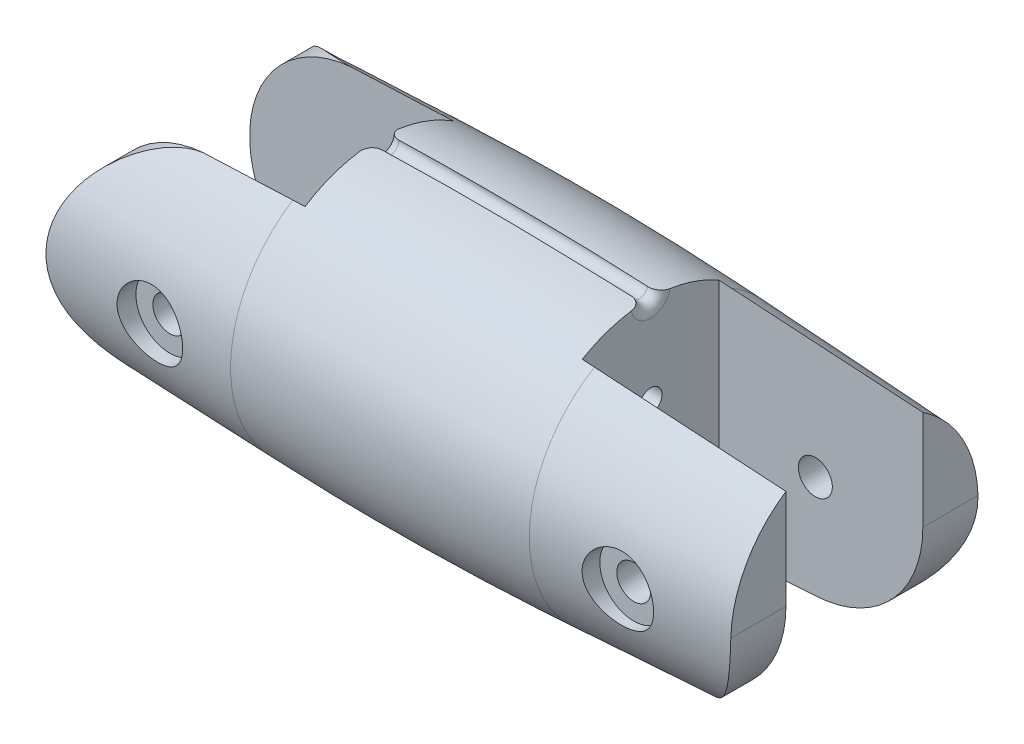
ISO-10303-21;
HEADER;
FILE_DESCRIPTION(('STEP AP214'),'2;1');
FILE_NAME('part.step','',(''),(''),'','','');
FILE_SCHEMA(('AUTOMOTIVE_DESIGN { 1 0 10303 214 1 1 1 1 }'));
ENDSEC;
DATA;
#1=APPLICATION_CONTEXT('core data for automotive mechanical design processes');
#2=APPLICATION_PROTOCOL_DEFINITION('international standard','automotive_design',2000,#1);
#3=PRODUCT_CONTEXT('',#1,'mechanical');
#4=PRODUCT('Part','Part','',(#3));
#5=PRODUCT_RELATED_PRODUCT_CATEGORY('part','',(#4));
#6=PRODUCT_DEFINITION_FORMATION('','',#4);
#7=PRODUCT_DEFINITION_CONTEXT('part definition',#1,'design');
#8=PRODUCT_DEFINITION('design','',#6,#7);
#9=PRODUCT_DEFINITION_SHAPE('','',#8);
#10=(LENGTH_UNIT() NAMED_UNIT(*) SI_UNIT(.MILLI.,.METRE.));
#11=(NAMED_UNIT(*) PLANE_ANGLE_UNIT() SI_UNIT($,.RADIAN.));
#12=(NAMED_UNIT(*) SI_UNIT($,.STERADIAN.) SOLID_ANGLE_UNIT());
#13=UNCERTAINTY_MEASURE_WITH_UNIT(LENGTH_MEASURE(1.E-05),#10,'distance_accuracy_value','');
#14=(GEOMETRIC_REPRESENTATION_CONTEXT(3) GLOBAL_UNCERTAINTY_ASSIGNED_CONTEXT((#13)) GLOBAL_UNIT_ASSIGNED_CONTEXT((#10,
#11,#12)) REPRESENTATION_CONTEXT('',''));
#15=CARTESIAN_POINT('',(0.,0.,0.));
#16=DIRECTION('',(0.,0.,1.));
#17=DIRECTION('',(1.,0.,0.));
#18=AXIS2_PLACEMENT_3D('',#15,#16,#17);
#19=CARTESIAN_POINT('',(30.,4.,0.));
#20=DIRECTION('',(-1.,0.,0.));
#21=DIRECTION('',(0.,0.,1.));
#22=AXIS2_PLACEMENT_3D('',#19,#20,#21);
#23=CYLINDRICAL_SURFACE('',#22,1.);
#24=CARTESIAN_POINT('',(12.,4.,0.));
#25=DIRECTION('',(-1.,0.,0.));
#26=DIRECTION('',(0.,0.,1.));
#27=AXIS2_PLACEMENT_3D('',#24,#25,#26);
#28=CIRCLE('',#27,1.);
#29=CARTESIAN_POINT('',(12.,4.,0.999999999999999));
#30=VERTEX_POINT('',#29);
#31=EDGE_CURVE('E655',#30,#30,#28,.F.);
#32=ORIENTED_EDGE('',*,*,#31,.T.);
#33=EDGE_LOOP('',(#32));
#34=FACE_BOUND('',#33,.T.);
#35=CARTESIAN_POINT('',(8.,4.,0.));
#36=DIRECTION('',(-1.,0.,0.));
#37=DIRECTION('',(0.,0.,1.));
#38=AXIS2_PLACEMENT_3D('',#35,#36,#37);
#39=CIRCLE('',#38,1.);
#40=CARTESIAN_POINT('',(8.,4.,0.999999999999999));
#41=VERTEX_POINT('',#40);
#42=EDGE_CURVE('E353',#41,#41,#39,.T.);
#43=ORIENTED_EDGE('',*,*,#42,.T.);
#44=EDGE_LOOP('',(#43));
#45=FACE_BOUND('',#44,.T.);
#46=ADVANCED_FACE('F32',(#34,#45),#23,.F.);
#47=CARTESIAN_POINT('',(30.,-4.,0.));
#48=DIRECTION('',(-1.,0.,0.));
#49=DIRECTION('',(0.,0.,1.));
#50=AXIS2_PLACEMENT_3D('',#47,#48,#49);
#51=CYLINDRICAL_SURFACE('',#50,1.);
#52=CARTESIAN_POINT('',(12.,-4.,0.));
#53=DIRECTION('',(-1.,0.,0.));
#54=DIRECTION('',(0.,0.,1.));
#55=AXIS2_PLACEMENT_3D('',#52,#53,#54);
#56=CIRCLE('',#55,1.);
#57=CARTESIAN_POINT('',(12.,-4.,0.999999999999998));
#58=VERTEX_POINT('',#57);
#59=EDGE_CURVE('E651',#58,#58,#56,.F.);
#60=ORIENTED_EDGE('',*,*,#59,.T.);
#61=EDGE_LOOP('',(#60));
#62=FACE_BOUND('',#61,.T.);
#63=CARTESIAN_POINT('',(8.,-4.,0.));
#64=DIRECTION('',(-1.,0.,0.));
#65=DIRECTION('',(0.,0.,1.));
#66=AXIS2_PLACEMENT_3D('',#63,#64,#65);
#67=CIRCLE('',#66,1.);
#68=CARTESIAN_POINT('',(8.,-4.,0.999999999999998));
#69=VERTEX_POINT('',#68);
#70=EDGE_CURVE('E37',#69,#69,#67,.T.);
#71=ORIENTED_EDGE('',*,*,#70,.T.);
#72=EDGE_LOOP('',(#71));
#73=FACE_BOUND('',#72,.T.);
#74=ADVANCED_FACE('F616',(#62,#73),#51,.F.);
#75=CARTESIAN_POINT('',(-2.62045474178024,0.,0.));
#76=DIRECTION('',(-1.,0.,0.));
#77=DIRECTION('',(0.,0.,1.));
#78=AXIS2_PLACEMENT_3D('',#75,#76,#77);
#79=DEGENERATE_TOROIDAL_SURFACE('',#78,287.774371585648,300.,.F.);
#80=CARTESIAN_POINT('',(13.0805321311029,-11.7940897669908,0.693790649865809));
#81=CARTESIAN_POINT('',(12.830909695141,-11.8068856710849,0.69904129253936));
#82=CARTESIAN_POINT('',(12.5812624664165,-11.8193980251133,0.703769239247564));
#83=CARTESIAN_POINT('',(12.0819274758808,-11.8438493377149,0.712312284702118));
#84=CARTESIAN_POINT('',(11.8322397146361,-11.8557883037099,0.716127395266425));
#85=CARTESIAN_POINT('',(11.0830813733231,-11.8907379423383,0.72640298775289));
#86=CARTESIAN_POINT('',(10.5835538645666,-11.9128793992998,0.731692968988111));
#87=CARTESIAN_POINT('',(9.58438012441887,-11.9548012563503,0.739957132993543));
#88=CARTESIAN_POINT('',(9.08473389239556,-11.9745816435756,0.742931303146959));
#89=CARTESIAN_POINT('',(7.5856158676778,-12.0303237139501,0.749364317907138));
#90=CARTESIAN_POINT('',(6.58599735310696,-12.0626847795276,0.750333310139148));
#91=CARTESIAN_POINT('',(4.77317724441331,-12.1124362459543,0.749578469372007));
#92=CARTESIAN_POINT('',(3.96001967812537,-12.1314937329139,0.748323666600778));
#93=CARTESIAN_POINT('',(2.33357283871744,-12.163002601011,0.745446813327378));
#94=CARTESIAN_POINT('',(1.52028356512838,-12.1754539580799,0.743824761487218));
#95=CARTESIAN_POINT('',(-0.106363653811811,-12.1936883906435,0.741230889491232));
#96=CARTESIAN_POINT('',(-0.919721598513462,-12.1994715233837,0.74025906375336));
#97=CARTESIAN_POINT('',(-2.54645668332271,-12.2043410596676,0.739451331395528));
#98=CARTESIAN_POINT('',(-3.35983382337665,-12.2034274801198,0.739615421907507));
#99=CARTESIAN_POINT('',(-4.82556254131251,-12.1957516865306,0.740858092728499));
#100=CARTESIAN_POINT('',(-5.47792084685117,-12.1901828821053,0.741749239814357));
#101=CARTESIAN_POINT('',(-6.78258587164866,-12.1747587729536,0.743897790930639));
#102=CARTESIAN_POINT('',(-7.4348925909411,-12.164903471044,0.745155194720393));
#103=CARTESIAN_POINT('',(-8.73942860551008,-12.1409368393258,0.747534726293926));
#104=CARTESIAN_POINT('',(-9.39165790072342,-12.1268255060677,0.748656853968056));
#105=CARTESIAN_POINT('',(-10.6960130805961,-12.0943946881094,0.750007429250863));
#106=CARTESIAN_POINT('',(-11.3481389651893,-12.076075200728,0.750235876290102));
#107=CARTESIAN_POINT('',(-12.0002,-12.0556755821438,0.749638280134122));
#108=B_SPLINE_CURVE_WITH_KNOTS('',3,(#80,#81,#82,#83,#84,#85,#86,#87,#88,#89,#90,#91,#92,#93,
#94,#95,#96,#97,#98,#99,#100,#101,#102,#103,#104,#105,#106,#107),.UNSPECIFIED.,.F.,.F.,(4,2,2,2,
2,2,2,2,2,2,2,2,2,4),(0.,0.750014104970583,1.50001849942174,3.00014184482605,4.50027336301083,
7.50063432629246,9.94075605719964,12.3808866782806,14.8209963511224,17.2610998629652,
19.2182341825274,21.1753672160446,23.1325018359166,25.0896377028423),.UNSPECIFIED.);
#109=CARTESIAN_POINT('',(11.0000000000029,-11.8940856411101,0.726855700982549));
#110=VERTEX_POINT('',#109);
#111=CARTESIAN_POINT('',(-11.,-12.0853296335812,0.749973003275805));
#112=VERTEX_POINT('',#111);
#113=EDGE_CURVE('E837',#110,#112,#108,.T.);
#114=ORIENTED_EDGE('',*,*,#113,.F.);
#115=CARTESIAN_POINT('',(11.,-11.894085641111,0.726855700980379));
#116=CARTESIAN_POINT('',(11.0320792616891,-11.892646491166,0.726483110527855));
#117=CARTESIAN_POINT('',(11.0641712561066,-11.8911077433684,0.727686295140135));
#118=CARTESIAN_POINT('',(11.1280762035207,-11.887838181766,0.733217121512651));
#119=CARTESIAN_POINT('',(11.159889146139,-11.8861073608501,0.737544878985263));
#120=CARTESIAN_POINT('',(11.2228289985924,-11.8824666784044,0.749279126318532));
#121=CARTESIAN_POINT('',(11.2539577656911,-11.8805574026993,0.756675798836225));
#122=CARTESIAN_POINT('',(11.3153209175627,-11.8765579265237,0.774461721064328));
#123=CARTESIAN_POINT('',(11.3455554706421,-11.8744677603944,0.78485040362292));
#124=CARTESIAN_POINT('',(11.4264228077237,-11.8685166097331,0.817130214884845));
#125=CARTESIAN_POINT('',(11.47592748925,-11.8644717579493,0.841896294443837));
#126=CARTESIAN_POINT('',(11.5700561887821,-11.8558055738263,0.899266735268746));
#127=CARTESIAN_POINT('',(11.6146813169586,-11.8511843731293,0.931869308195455));
#128=CARTESIAN_POINT('',(11.698344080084,-11.8412641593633,1.00433296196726));
#129=CARTESIAN_POINT('',(11.7373179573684,-11.8359585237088,1.04426683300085));
#130=CARTESIAN_POINT('',(11.8080589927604,-11.8246663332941,1.13001458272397));
#131=CARTESIAN_POINT('',(11.8398234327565,-11.8186795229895,1.17583066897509));
#132=CARTESIAN_POINT('',(11.8955940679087,-11.8059403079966,1.27261401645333));
#133=CARTESIAN_POINT('',(11.9195017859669,-11.7991795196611,1.32363687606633));
#134=CARTESIAN_POINT('',(11.9583217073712,-11.7849961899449,1.42888383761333));
#135=CARTESIAN_POINT('',(11.9732422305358,-11.7775742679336,1.48310492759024));
#136=CARTESIAN_POINT('',(11.9889621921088,-11.7657399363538,1.5677558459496));
#137=CARTESIAN_POINT('',(11.993100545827,-11.7615176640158,1.59762890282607));
#138=CARTESIAN_POINT('',(11.9986174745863,-11.7529496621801,1.65756026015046));
#139=CARTESIAN_POINT('',(12.0000006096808,-11.7486041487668,1.68761817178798));
#140=CARTESIAN_POINT('',(12.0000000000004,-11.7442060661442,1.71768323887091));
#141=B_SPLINE_CURVE_WITH_KNOTS('',3,(#115,#116,#117,#118,#119,#120,#121,#122,#123,#124,#125,
#126,#127,#128,#129,#130,#131,#132,#133,#134,#135,#136,#137,#138,#139,#140),.UNSPECIFIED.,.F.,
.F.,(4,2,2,2,2,2,2,2,2,2,2,2,4),(0.,0.0963009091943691,0.192605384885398,0.288604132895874,
0.384584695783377,0.550252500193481,0.715882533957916,0.883255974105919,1.05069241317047,
1.2201538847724,1.38945823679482,1.48070408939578,1.57179879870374),.UNSPECIFIED.);
#142=CARTESIAN_POINT('',(12.,-11.7442060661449,1.71768323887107));
#143=VERTEX_POINT('',#142);
#144=EDGE_CURVE('E774',#110,#143,#141,.T.);
#145=ORIENTED_EDGE('',*,*,#144,.T.);
#146=CARTESIAN_POINT('',(12.,0.,0.));
#147=DIRECTION('',(-1.,0.,0.));
#148=DIRECTION('',(0.,0.,1.));
#149=AXIS2_PLACEMENT_3D('',#146,#147,#148);
#150=CIRCLE('',#149,11.869153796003);
#151=CARTESIAN_POINT('',(12.,-10.2114794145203,6.05));
#152=VERTEX_POINT('',#151);
#153=EDGE_CURVE('E1349',#152,#143,#150,.F.);
#154=ORIENTED_EDGE('',*,*,#153,.F.);
#155=CARTESIAN_POINT('',(12.5629711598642,-10.1789215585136,6.05));
#156=CARTESIAN_POINT('',(12.4691486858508,-10.184452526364,6.05));
#157=CARTESIAN_POINT('',(12.3753231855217,-10.1899311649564,6.05));
#158=CARTESIAN_POINT('',(12.1876661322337,-10.200783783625,6.05));
#159=CARTESIAN_POINT('',(12.0938345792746,-10.2061577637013,6.05));
#160=CARTESIAN_POINT('',(11.9999999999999,-10.2114794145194,6.05));
#161=B_SPLINE_CURVE_WITH_KNOTS('',3,(#155,#156,#157,#158,#159,#160),.UNSPECIFIED.,.F.,.F.,(4,2,
4),(0.,0.281955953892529,0.563911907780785),.UNSPECIFIED.);
#162=CARTESIAN_POINT('',(12.5629711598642,-10.1789215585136,6.05));
#163=VERTEX_POINT('',#162);
#164=EDGE_CURVE('E694',#163,#152,#161,.T.);
#165=ORIENTED_EDGE('',*,*,#164,.F.);
#166=CARTESIAN_POINT('',(13.0803321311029,-10.1469155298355,6.05163215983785));
#167=CARTESIAN_POINT('',(12.9941048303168,-10.1522498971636,6.05151039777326));
#168=CARTESIAN_POINT('',(12.9078777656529,-10.1575842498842,6.05131350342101));
#169=CARTESIAN_POINT('',(12.7354241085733,-10.1682529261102,6.05076945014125));
#170=CARTESIAN_POINT('',(12.6491975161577,-10.1735872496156,6.05042229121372));
#171=CARTESIAN_POINT('',(12.5629711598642,-10.1789215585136,6.04999999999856));
#172=B_SPLINE_CURVE_WITH_KNOTS('',3,(#166,#167,#168,#169,#170,#171),.UNSPECIFIED.,.F.,.F.,(4,2,
4),(0.,0.259176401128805,0.51835280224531),.UNSPECIFIED.);
#173=CARTESIAN_POINT('',(13.0803321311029,-10.1469155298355,6.05163215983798));
#174=VERTEX_POINT('',#173);
#175=EDGE_CURVE('E706',#174,#163,#172,.T.);
#176=ORIENTED_EDGE('',*,*,#175,.F.);
#177=CARTESIAN_POINT('',(13.0803321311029,0.,0.));
#178=DIRECTION('',(-1.,0.,0.));
#179=DIRECTION('',(0.,0.,1.));
#180=AXIS2_PLACEMENT_3D('',#177,#178,#179);
#181=CIRCLE('',#180,11.8144888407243);
#182=CARTESIAN_POINT('',(13.0803321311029,10.1478887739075,6.05));
#183=VERTEX_POINT('',#182);
#184=EDGE_CURVE('E1461',#183,#174,#181,.F.);
#185=ORIENTED_EDGE('',*,*,#184,.F.);
#186=CARTESIAN_POINT('',(12.,10.2114794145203,6.05));
#187=CARTESIAN_POINT('',(12.180078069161,10.2012668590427,6.05));
#188=CARTESIAN_POINT('',(12.3601447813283,10.1908613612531,6.05));
#189=CARTESIAN_POINT('',(12.720255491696,10.1696644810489,6.05));
#190=CARTESIAN_POINT('',(12.9002994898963,10.1588730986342,6.05));
#191=CARTESIAN_POINT('',(13.0803321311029,10.1478887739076,6.05));
#192=B_SPLINE_CURVE_WITH_KNOTS('',3,(#186,#187,#188,#189,#190,#191),.UNSPECIFIED.,.F.,.F.,(4,2,
4),(0.,0.541101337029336,1.08220267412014),.UNSPECIFIED.);
#193=CARTESIAN_POINT('',(12.,10.2114794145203,6.05));
#194=VERTEX_POINT('',#193);
#195=EDGE_CURVE('E699',#194,#183,#192,.T.);
#196=ORIENTED_EDGE('',*,*,#195,.F.);
#197=CARTESIAN_POINT('',(12.,0.,0.));
#198=DIRECTION('',(-1.,0.,0.));
#199=DIRECTION('',(0.,0.,1.));
#200=AXIS2_PLACEMENT_3D('',#197,#198,#199);
#201=CIRCLE('',#200,11.869153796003);
#202=CARTESIAN_POINT('',(12.,11.7442060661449,1.71768323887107));
#203=VERTEX_POINT('',#202);
#204=EDGE_CURVE('E1355',#203,#194,#201,.F.);
#205=ORIENTED_EDGE('',*,*,#204,.F.);
#206=CARTESIAN_POINT('',(12.,11.7442060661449,1.71768323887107));
#207=CARTESIAN_POINT('',(11.9999998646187,11.7482954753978,1.68972680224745));
#208=CARTESIAN_POINT('',(11.9988045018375,11.7523395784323,1.66177757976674));
#209=CARTESIAN_POINT('',(11.9940378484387,11.7603167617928,1.60606851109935));
#210=CARTESIAN_POINT('',(11.9904667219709,11.7642498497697,1.57830865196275));
#211=CARTESIAN_POINT('',(11.976228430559,11.7758388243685,1.49566949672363));
#212=CARTESIAN_POINT('',(11.9620362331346,11.7832993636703,1.44132821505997));
#213=CARTESIAN_POINT('',(11.9246629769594,11.7975632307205,1.33574771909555));
#214=CARTESIAN_POINT('',(11.9014784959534,11.8043663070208,1.28450969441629));
#215=CARTESIAN_POINT('',(11.8467852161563,11.8172702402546,1.18658709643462));
#216=CARTESIAN_POINT('',(11.8152769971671,11.8233711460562,1.13990220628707));
#217=CARTESIAN_POINT('',(11.7447280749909,11.8348922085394,1.0523218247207));
#218=CARTESIAN_POINT('',(11.7056680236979,11.8403105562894,1.01144168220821));
#219=CARTESIAN_POINT('',(11.6211470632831,11.8504897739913,0.936822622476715));
#220=CARTESIAN_POINT('',(11.5756853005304,11.8552505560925,0.903084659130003));
#221=CARTESIAN_POINT('',(11.4798547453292,11.8641434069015,0.843940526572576));
#222=CARTESIAN_POINT('',(11.4295082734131,11.8682781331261,0.8184985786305));
#223=CARTESIAN_POINT('',(11.32518380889,11.8759778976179,0.776587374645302));
#224=CARTESIAN_POINT('',(11.2712084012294,11.8795433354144,0.760111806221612));
#225=CARTESIAN_POINT('',(11.1807292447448,11.8849449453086,0.740806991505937));
#226=CARTESIAN_POINT('',(11.1448015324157,11.8869465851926,0.735211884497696));
#227=CARTESIAN_POINT('',(11.0725816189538,11.8907024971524,0.728028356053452));
#228=CARTESIAN_POINT('',(11.0362899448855,11.8924570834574,0.726434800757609));
#229=CARTESIAN_POINT('',(11.,11.8940856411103,0.726855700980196));
#230=B_SPLINE_CURVE_WITH_KNOTS('',3,(#206,#207,#208,#209,#210,#211,#212,#213,#214,#215,#216,
#217,#218,#219,#220,#221,#222,#223,#224,#225,#226,#227,#228,#229),.UNSPECIFIED.,.F.,.F.,(4,2,2,
2,2,2,2,2,2,2,2,4),(0.,0.084709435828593,0.169413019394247,0.338513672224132,0.507678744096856,
0.676832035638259,0.846424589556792,1.01603977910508,1.1849134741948,1.3536681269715,
1.46270787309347,1.57160765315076),.UNSPECIFIED.);
#231=CARTESIAN_POINT('',(11.,11.8940856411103,0.726855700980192));
#232=VERTEX_POINT('',#231);
#233=EDGE_CURVE('E812',#203,#232,#230,.T.);
#234=ORIENTED_EDGE('',*,*,#233,.T.);
#235=CARTESIAN_POINT('',(-12.0002,12.055675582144,0.749638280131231));
#236=CARTESIAN_POINT('',(-11.7503213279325,12.0634920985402,0.749880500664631));
#237=CARTESIAN_POINT('',(-11.5004331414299,12.0710037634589,0.749992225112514));
#238=CARTESIAN_POINT('',(-11.0006386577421,12.0854140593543,0.750007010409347));
#239=CARTESIAN_POINT('',(-10.750732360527,12.0923126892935,0.749910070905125));
#240=CARTESIAN_POINT('',(-10.0009631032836,12.1120846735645,0.749384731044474));
#241=CARTESIAN_POINT('',(-9.50107561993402,12.1240333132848,0.748721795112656));
#242=CARTESIAN_POINT('',(-8.50124745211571,12.1454422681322,0.747125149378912));
#243=CARTESIAN_POINT('',(-8.00130676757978,12.1549025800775,0.746191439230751));
#244=CARTESIAN_POINT('',(-7.00137681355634,12.1713172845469,0.74433842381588));
#245=CARTESIAN_POINT('',(-6.50138754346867,12.178271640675,0.743419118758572));
#246=CARTESIAN_POINT('',(-5.50137870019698,12.189661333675,0.741808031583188));
#247=CARTESIAN_POINT('',(-5.00135912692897,12.1940966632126,0.741116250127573));
#248=CARTESIAN_POINT('',(-3.76853352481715,12.2019160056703,0.739870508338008));
#249=CARTESIAN_POINT('',(-3.03571754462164,12.2038494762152,0.739530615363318));
#250=CARTESIAN_POINT('',(-1.57008978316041,12.2022793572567,0.739793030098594));
#251=CARTESIAN_POINT('',(-0.837278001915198,12.1987757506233,0.740395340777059));
#252=CARTESIAN_POINT('',(0.6283111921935,12.1863455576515,0.742299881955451));
#253=CARTESIAN_POINT('',(1.36108860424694,12.1774188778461,0.74360212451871));
#254=CARTESIAN_POINT('',(2.82655796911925,12.1541782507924,0.746310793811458));
#255=CARTESIAN_POINT('',(3.55924992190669,12.1398643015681,0.747717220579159));
#256=CARTESIAN_POINT('',(5.0246332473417,12.1059039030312,0.749708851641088));
#257=CARTESIAN_POINT('',(5.7573245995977,12.086256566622,0.750293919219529));
#258=CARTESIAN_POINT('',(7.22254320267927,12.0417096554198,0.749406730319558));
#259=CARTESIAN_POINT('',(7.9550704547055,12.0168101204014,0.747934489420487));
#260=CARTESIAN_POINT('',(9.05370483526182,11.9755981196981,0.742970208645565));
#261=CARTESIAN_POINT('',(9.41989140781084,11.9612169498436,0.740856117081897));
#262=CARTESIAN_POINT('',(10.1522031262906,11.9311822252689,0.735454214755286));
#263=CARTESIAN_POINT('',(10.5183282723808,11.9155286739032,0.732166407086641));
#264=CARTESIAN_POINT('',(11.2505176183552,11.8829648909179,0.72413158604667));
#265=CARTESIAN_POINT('',(11.6165818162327,11.8660546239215,0.719384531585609));
#266=CARTESIAN_POINT('',(12.3486254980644,11.8309960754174,0.708056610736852));
#267=CARTESIAN_POINT('',(12.7146049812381,11.8128477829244,0.701475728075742));
#268=CARTESIAN_POINT('',(13.080532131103,11.7940897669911,0.693790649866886));
#269=B_SPLINE_CURVE_WITH_KNOTS('',3,(#235,#236,#237,#238,#239,#240,#241,#242,#243,#244,#245,
#246,#247,#248,#249,#250,#251,#252,#253,#254,#255,#256,#257,#258,#259,#260,#261,#262,#263,#264,
#265,#266,#267,#268),.UNSPECIFIED.,.F.,.F.,(4,2,2,2,2,2,2,2,2,2,2,2,2,2,2,2,4),(0.,
0.750002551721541,1.50000637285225,3.0000915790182,4.50017870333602,6.00028761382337,
7.5004008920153,9.69883480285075,11.8972756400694,14.0957543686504,16.2942339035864,
18.4930793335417,20.6919081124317,21.7913296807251,22.8907483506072,23.9901979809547,
25.089657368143),.UNSPECIFIED.);
#270=CARTESIAN_POINT('',(-11.,12.0853296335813,0.749973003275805));
#271=VERTEX_POINT('',#270);
#272=EDGE_CURVE('E865',#271,#232,#269,.T.);
#273=ORIENTED_EDGE('',*,*,#272,.F.);
#274=CARTESIAN_POINT('',(-11.,12.0853296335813,0.749973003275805));
#275=CARTESIAN_POINT('',(-11.0320699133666,12.0844303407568,0.749981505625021));
#276=CARTESIAN_POINT('',(-11.0641150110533,12.0834328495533,0.751531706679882));
#277=CARTESIAN_POINT('',(-11.127903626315,12.0812420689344,0.757692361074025));
#278=CARTESIAN_POINT('',(-11.1596471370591,12.0800487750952,0.762302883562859));
#279=CARTESIAN_POINT('',(-11.2538267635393,12.0761851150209,0.780647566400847));
#280=CARTESIAN_POINT('',(-11.3154380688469,12.0732247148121,0.798895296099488));
#281=CARTESIAN_POINT('',(-11.4268717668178,12.0668986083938,0.843851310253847));
#282=CARTESIAN_POINT('',(-11.4772230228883,12.063623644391,0.869287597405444));
#283=CARTESIAN_POINT('',(-11.5729199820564,12.056383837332,0.92819613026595));
#284=CARTESIAN_POINT('',(-11.618267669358,12.0524192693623,0.961665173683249));
#285=CARTESIAN_POINT('',(-11.7027830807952,12.0437195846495,1.03577177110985));
#286=CARTESIAN_POINT('',(-11.7419348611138,12.0389825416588,1.07642726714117));
#287=CARTESIAN_POINT('',(-11.8128252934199,12.0286857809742,1.16369256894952));
#288=CARTESIAN_POINT('',(-11.8445613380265,12.0231257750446,1.21030446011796));
#289=CARTESIAN_POINT('',(-11.8997049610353,12.0111649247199,1.30812508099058));
#290=CARTESIAN_POINT('',(-11.9231108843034,12.0047639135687,1.35933472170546));
#291=CARTESIAN_POINT('',(-11.9609085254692,11.9911611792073,1.46485111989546));
#292=CARTESIAN_POINT('',(-11.9753089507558,11.9839602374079,1.51915483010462));
#293=CARTESIAN_POINT('',(-11.9900043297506,11.972544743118,1.6024877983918));
#294=CARTESIAN_POINT('',(-11.9937531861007,11.9685784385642,1.63098235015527));
#295=CARTESIAN_POINT('',(-11.9987488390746,11.9604958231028,1.68811760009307));
#296=CARTESIAN_POINT('',(-12.0000000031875,11.9563797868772,1.71675795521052));
#297=CARTESIAN_POINT('',(-12.0000000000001,11.9521961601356,1.74540235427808));
#298=B_SPLINE_CURVE_WITH_KNOTS('',3,(#274,#275,#276,#277,#278,#279,#280,#281,#282,#283,#284,
#285,#286,#287,#288,#289,#290,#291,#292,#293,#294,#295,#296,#297),.UNSPECIFIED.,.F.,.F.,(4,2,2,
2,2,2,2,2,2,2,2,4),(0.,0.0961675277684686,0.192337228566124,0.384009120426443,0.552770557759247,
0.721464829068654,0.89058637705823,1.05976729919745,1.22898181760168,1.39803246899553,
1.48497510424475,1.57176557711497),.UNSPECIFIED.);
#299=CARTESIAN_POINT('',(-12.,11.9521961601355,1.74540235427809));
#300=VERTEX_POINT('',#299);
#301=EDGE_CURVE('E808',#271,#300,#298,.T.);
#302=ORIENTED_EDGE('',*,*,#301,.T.);
#303=CARTESIAN_POINT('',(-12.,0.,0.));
#304=DIRECTION('',(-1.,0.,0.));
#305=DIRECTION('',(0.,0.,1.));
#306=AXIS2_PLACEMENT_3D('',#303,#304,#305);
#307=CIRCLE('',#306,12.0789661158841);
#308=CARTESIAN_POINT('',(-12.,10.1488384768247,6.55));
#309=VERTEX_POINT('',#308);
#310=EDGE_CURVE('E1367',#309,#300,#307,.T.);
#311=ORIENTED_EDGE('',*,*,#310,.F.);
#312=CARTESIAN_POINT('',(-12.8109760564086,10.1173252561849,6.55));
#313=CARTESIAN_POINT('',(-12.6758219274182,10.1227974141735,6.55));
#314=CARTESIAN_POINT('',(-12.5406635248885,10.1281595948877,6.55));
#315=CARTESIAN_POINT('',(-12.2703381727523,10.1386640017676,6.55));
#316=CARTESIAN_POINT('',(-12.1351712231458,10.1438062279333,6.55));
#317=CARTESIAN_POINT('',(-12.,10.1488384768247,6.55));
#318=B_SPLINE_CURVE_WITH_KNOTS('',3,(#312,#313,#314,#315,#316,#317),.UNSPECIFIED.,.F.,.F.,(4,2,
4),(0.,0.405794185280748,0.811588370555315),.UNSPECIFIED.);
#319=CARTESIAN_POINT('',(-12.8109760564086,10.1173252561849,6.55));
#320=VERTEX_POINT('',#319);
#321=EDGE_CURVE('E760',#320,#309,#318,.T.);
#322=ORIENTED_EDGE('',*,*,#321,.F.);
#323=CARTESIAN_POINT('',(-13.0903037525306,10.1056574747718,6.55031005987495));
#324=CARTESIAN_POINT('',(-13.0437490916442,10.1076021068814,6.55029887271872));
#325=CARTESIAN_POINT('',(-12.9971944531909,10.109546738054,6.55026744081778));
#326=CARTESIAN_POINT('',(-12.9040852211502,10.113435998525,6.55016408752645));
#327=CARTESIAN_POINT('',(-12.8575306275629,10.1153806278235,6.55009216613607));
#328=CARTESIAN_POINT('',(-12.8109760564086,10.1173252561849,6.55000000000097));
#329=B_SPLINE_CURVE_WITH_KNOTS('',3,(#323,#324,#325,#326,#327,#328),.UNSPECIFIED.,.F.,.F.,(4,2,
4),(0.,0.13978573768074,0.279571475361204),.UNSPECIFIED.);
#330=CARTESIAN_POINT('',(-13.0903037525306,10.1056574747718,6.55031005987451));
#331=VERTEX_POINT('',#330);
#332=EDGE_CURVE('E662',#331,#320,#329,.T.);
#333=ORIENTED_EDGE('',*,*,#332,.F.);
#334=CARTESIAN_POINT('',(-13.0903037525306,0.,0.));
#335=DIRECTION('',(1.,0.,0.));
#336=DIRECTION('',(0.,0.,-1.));
#337=AXIS2_PLACEMENT_3D('',#334,#335,#336);
#338=CIRCLE('',#337,12.0428765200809);
#339=CARTESIAN_POINT('',(-13.0903037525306,-10.1056574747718,6.55031005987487));
#340=VERTEX_POINT('',#339);
#341=EDGE_CURVE('E716',#340,#331,#338,.F.);
#342=ORIENTED_EDGE('',*,*,#341,.F.);
#343=CARTESIAN_POINT('',(-12.8109760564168,-10.1173252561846,6.55));
#344=CARTESIAN_POINT('',(-12.8575306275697,-10.1153806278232,6.55009216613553));
#345=CARTESIAN_POINT('',(-12.9040852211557,-10.1134359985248,6.55016408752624));
#346=CARTESIAN_POINT('',(-12.9971944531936,-10.1095467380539,6.55026744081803));
#347=CARTESIAN_POINT('',(-13.0437490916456,-10.1076021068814,6.55029887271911));
#348=CARTESIAN_POINT('',(-13.0903037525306,-10.1056574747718,6.55031005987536));
#349=B_SPLINE_CURVE_WITH_KNOTS('',3,(#343,#344,#345,#346,#347,#348),.UNSPECIFIED.,.F.,.F.,(4,2,
4),(0.,0.139785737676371,0.279571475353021),.UNSPECIFIED.);
#350=CARTESIAN_POINT('',(-12.8109760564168,-10.1173252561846,6.55));
#351=VERTEX_POINT('',#350);
#352=EDGE_CURVE('E1378',#351,#340,#349,.T.);
#353=ORIENTED_EDGE('',*,*,#352,.F.);
#354=CARTESIAN_POINT('',(-12.,-10.1488384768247,6.55));
#355=CARTESIAN_POINT('',(-12.1351712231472,-10.1438062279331,6.55));
#356=CARTESIAN_POINT('',(-12.270338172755,-10.1386640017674,6.55));
#357=CARTESIAN_POINT('',(-12.5406635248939,-10.1281595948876,6.55));
#358=CARTESIAN_POINT('',(-12.675821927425,-10.1227974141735,6.55));
#359=CARTESIAN_POINT('',(-12.8109760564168,-10.1173252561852,6.55));
#360=B_SPLINE_CURVE_WITH_KNOTS('',3,(#354,#355,#356,#357,#358,#359),.UNSPECIFIED.,.F.,.F.,(4,2,
4),(0.,0.405794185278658,0.811588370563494),.UNSPECIFIED.);
#361=CARTESIAN_POINT('',(-12.,-10.1488384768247,6.55));
#362=VERTEX_POINT('',#361);
#363=EDGE_CURVE('E1364',#362,#351,#360,.T.);
#364=ORIENTED_EDGE('',*,*,#363,.F.);
#365=CARTESIAN_POINT('',(-12.,0.,0.));
#366=DIRECTION('',(-1.,0.,0.));
#367=DIRECTION('',(0.,0.,1.));
#368=AXIS2_PLACEMENT_3D('',#365,#366,#367);
#369=CIRCLE('',#368,12.0789661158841);
#370=CARTESIAN_POINT('',(-12.,-11.9521961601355,1.74540235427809));
#371=VERTEX_POINT('',#370);
#372=EDGE_CURVE('E761',#371,#362,#369,.T.);
#373=ORIENTED_EDGE('',*,*,#372,.F.);
#374=CARTESIAN_POINT('',(-12.,-11.9521961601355,1.74540235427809));
#375=CARTESIAN_POINT('',(-11.9999997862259,-11.9562767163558,1.71746316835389));
#376=CARTESIAN_POINT('',(-11.9988096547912,-11.9602930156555,1.68952823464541));
#377=CARTESIAN_POINT('',(-11.9940611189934,-11.9681770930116,1.63384063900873));
#378=CARTESIAN_POINT('',(-11.9905028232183,-11.9720448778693,1.60608796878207));
#379=CARTESIAN_POINT('',(-11.9763085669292,-11.98338346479,1.52345152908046));
#380=CARTESIAN_POINT('',(-11.9621531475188,-11.9906031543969,1.46909558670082));
#381=CARTESIAN_POINT('',(-11.9248437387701,-12.0042422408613,1.36345944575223));
#382=CARTESIAN_POINT('',(-11.901685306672,-12.0106612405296,1.3121807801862));
#383=CARTESIAN_POINT('',(-11.8470262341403,-12.0226594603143,1.21417694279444));
#384=CARTESIAN_POINT('',(-11.8155271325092,-12.0282388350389,1.16745093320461));
#385=CARTESIAN_POINT('',(-11.7450805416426,-12.0385758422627,1.07990145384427));
#386=CARTESIAN_POINT('',(-11.7061333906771,-12.0433335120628,1.03907771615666));
#387=CARTESIAN_POINT('',(-11.6218844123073,-12.0520848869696,0.964497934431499));
#388=CARTESIAN_POINT('',(-11.5765811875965,-12.0560784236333,0.930743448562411));
#389=CARTESIAN_POINT('',(-11.4808869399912,-12.0633728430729,0.87127064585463));
#390=CARTESIAN_POINT('',(-11.4304923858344,-12.0666732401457,0.845557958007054));
#391=CARTESIAN_POINT('',(-11.326081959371,-12.0726389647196,0.802960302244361));
#392=CARTESIAN_POINT('',(-11.2720684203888,-12.0753046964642,0.786069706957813));
#393=CARTESIAN_POINT('',(-11.1814237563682,-12.0791996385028,0.765918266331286));
#394=CARTESIAN_POINT('',(-11.1453788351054,-12.0806039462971,0.759951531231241));
#395=CARTESIAN_POINT('',(-11.0728959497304,-12.0831573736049,0.751983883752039));
#396=CARTESIAN_POINT('',(-11.0364586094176,-12.0843068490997,0.749977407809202));
#397=CARTESIAN_POINT('',(-11.,-12.0853296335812,0.749973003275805));
#398=B_SPLINE_CURVE_WITH_KNOTS('',3,(#374,#375,#376,#377,#378,#379,#380,#381,#382,#383,#384,
#385,#386,#387,#388,#389,#390,#391,#392,#393,#394,#395,#396,#397),.UNSPECIFIED.,.F.,.F.,(4,2,2,
2,2,2,2,2,2,2,2,4),(0.,0.0846548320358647,0.16930578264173,0.338327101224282,0.507431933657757,
0.67650558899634,0.845571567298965,1.01467477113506,1.18389607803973,1.35300931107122,
1.46249391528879,1.57182460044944),.UNSPECIFIED.);
#399=EDGE_CURVE('E769',#371,#112,#398,.T.);
#400=ORIENTED_EDGE('',*,*,#399,.T.);
#401=EDGE_LOOP('',(#114,#145,#154,#165,#176,#185,#196,#205,#234,#273,#302,#311,#322,#333,#342,
#353,#364,#373,#400));
#402=FACE_BOUND('',#401,.T.);
#403=ADVANCED_FACE('F622',(#402),#79,.F.);
#404=CARTESIAN_POINT('',(0.,0.,0.));
#405=DIRECTION('',(-1.,0.,0.));
#406=DIRECTION('',(0.,0.,-1.));
#407=AXIS2_PLACEMENT_3D('',#404,#405,#406);
#408=CONICAL_SURFACE('',#407,12.5,0.05235987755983);
#409=CARTESIAN_POINT('',(-5.53456198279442,11.268672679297,6.05000000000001));
#410=CARTESIAN_POINT('',(-1.856116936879,11.0498348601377,6.05000000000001));
#411=CARTESIAN_POINT('',(1.82224798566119,10.8296357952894,6.05));
#412=CARTESIAN_POINT('',(9.1787901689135,10.3858161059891,6.05));
#413=CARTESIAN_POINT('',(12.8569674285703,10.162195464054,6.05));
#414=CARTESIAN_POINT('',(18.374044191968,9.82367567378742,6.05));
#415=CARTESIAN_POINT('',(20.2130384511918,9.71032092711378,6.05));
#416=CARTESIAN_POINT('',(23.8909547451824,9.48246202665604,6.05));
#417=CARTESIAN_POINT('',(25.7298767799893,9.36795787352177,6.05));
#418=CARTESIAN_POINT('',(29.4076323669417,9.13767009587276,6.05));
#419=CARTESIAN_POINT('',(31.2464659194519,9.02188647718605,6.05));
#420=CARTESIAN_POINT('',(34.9240457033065,8.78888280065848,6.05));
#421=CARTESIAN_POINT('',(36.7627919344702,8.67166273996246,6.05));
#422=CARTESIAN_POINT('',(41.0506368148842,8.39641822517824,6.05));
#423=CARTESIAN_POINT('',(43.4996953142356,8.23776736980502,6.05));
#424=CARTESIAN_POINT('',(48.3975889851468,7.91706173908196,6.05));
#425=CARTESIAN_POINT('',(50.8464241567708,7.75500696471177,6.04999999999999));
#426=CARTESIAN_POINT('',(55.7438015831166,7.42680119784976,6.04999999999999));
#427=CARTESIAN_POINT('',(58.1923438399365,7.26065023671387,6.04999999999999));
#428=CARTESIAN_POINT('',(63.0890874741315,6.92333235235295,6.04999999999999));
#429=CARTESIAN_POINT('',(65.5372888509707,6.75216542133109,6.04999999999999));
#430=CARTESIAN_POINT('',(70.4333531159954,6.40354655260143,6.04999999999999));
#431=CARTESIAN_POINT('',(72.8812159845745,6.22609433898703,6.04999999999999));
#432=CARTESIAN_POINT('',(77.776337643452,5.86313838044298,6.04999999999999));
#433=CARTESIAN_POINT('',(80.2235964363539,5.67763467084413,6.04999999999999));
#434=CARTESIAN_POINT('',(83.8938931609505,5.39129415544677,6.04999999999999));
#435=CARTESIAN_POINT('',(85.1172463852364,5.29449821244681,6.04999999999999));
#436=CARTESIAN_POINT('',(87.5636949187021,5.09771490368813,6.04999999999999));
#437=CARTESIAN_POINT('',(88.7867902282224,4.99772754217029,6.04999999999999));
#438=CARTESIAN_POINT('',(91.2326845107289,4.79396550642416,6.04999999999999));
#439=CARTESIAN_POINT('',(92.4554834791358,4.69019077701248,6.04999999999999));
#440=CARTESIAN_POINT('',(94.9006810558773,4.4779701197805,6.04999999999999));
#441=CARTESIAN_POINT('',(96.1230796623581,4.36952417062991,6.04999999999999));
#442=CARTESIAN_POINT('',(97.3452294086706,4.2583004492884,6.04999999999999));
#443=B_SPLINE_CURVE_WITH_KNOTS('',3,(#409,#410,#411,#412,#413,#414,#415,#416,#417,#418,#419,
#420,#421,#422,#423,#424,#425,#426,#427,#428,#429,#430,#431,#432,#433,#434,#435,#436,#437,#438,
#439,#440,#441,#442),.UNSPECIFIED.,.F.,.F.,(4,2,2,2,2,2,2,2,2,2,2,2,2,2,2,2,4),(0.,
11.0548476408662,22.1097517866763,27.6372050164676,33.1646551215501,38.6920800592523,
44.2195159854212,51.5820895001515,58.9446608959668,66.3071759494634,73.669702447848,
81.0325525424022,88.3953703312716,92.0768969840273,95.7584187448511,99.4399941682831,
103.121586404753),.UNSPECIFIED.);
#444=CARTESIAN_POINT('',(30.,9.1001968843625,6.05));
#445=VERTEX_POINT('',#444);
#446=EDGE_CURVE('E686',#445,#183,#443,.F.);
#447=ORIENTED_EDGE('',*,*,#446,.T.);
#448=ORIENTED_EDGE('',*,*,#184,.T.);
#449=CARTESIAN_POINT('',(21.0000000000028,-9.65697305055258,0.));
#450=DIRECTION('',(-0.0617459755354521,0.998091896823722,0.));
#451=DIRECTION('',(-0.998091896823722,-0.0617459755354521,0.));
#452=AXIS2_PLACEMENT_3D('',#449,#450,#451);
#453=ELLIPSE('',#452,184.618293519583,6.05722932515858);
#454=CARTESIAN_POINT('',(20.6174597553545,-9.68063852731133,6.05721627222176));
#455=VERTEX_POINT('',#454);
#456=EDGE_CURVE('E1424',#174,#455,#453,.T.);
#457=ORIENTED_EDGE('',*,*,#456,.T.);
#458=CARTESIAN_POINT('',(20.6172597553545,-9.68065089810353,6.05721626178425));
#459=CARTESIAN_POINT('',(20.7937480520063,-9.66977935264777,6.05708476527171));
#460=CARTESIAN_POINT('',(20.969836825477,-9.65414938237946,6.06472784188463));
#461=CARTESIAN_POINT('',(21.3193784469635,-9.61384516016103,6.09430610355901));
#462=CARTESIAN_POINT('',(21.492836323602,-9.58919128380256,6.11620917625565));
#463=CARTESIAN_POINT('',(21.8334874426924,-9.53169744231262,6.17263072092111));
#464=CARTESIAN_POINT('',(22.0007357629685,-9.49898698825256,6.2069532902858));
#465=CARTESIAN_POINT('',(22.3309343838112,-9.42573404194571,6.28650703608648));
#466=CARTESIAN_POINT('',(22.49388182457,-9.38518648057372,6.33174527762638));
#467=CARTESIAN_POINT('',(22.8853428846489,-9.27741125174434,6.45312835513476));
#468=CARTESIAN_POINT('',(23.1112770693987,-9.20628073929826,6.53412741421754));
#469=CARTESIAN_POINT('',(23.5527938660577,-9.05025674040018,6.70979904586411));
#470=CARTESIAN_POINT('',(23.7683719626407,-8.96535731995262,6.80447751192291));
#471=CARTESIAN_POINT('',(24.1912485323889,-8.78195484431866,7.00412557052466));
#472=CARTESIAN_POINT('',(24.3984605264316,-8.68334175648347,7.109176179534));
#473=CARTESIAN_POINT('',(24.8030654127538,-8.47368504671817,7.32544117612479));
#474=CARTESIAN_POINT('',(25.0004587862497,-8.36264203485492,7.43665526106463));
#475=CARTESIAN_POINT('',(25.4612496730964,-8.08263127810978,7.70671008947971));
#476=CARTESIAN_POINT('',(25.7202721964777,-7.90799293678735,7.86716814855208));
#477=CARTESIAN_POINT('',(26.2206486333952,-7.53558560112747,8.18899390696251));
#478=CARTESIAN_POINT('',(26.4619958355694,-7.33780789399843,8.3503619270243));
#479=CARTESIAN_POINT('',(26.9258687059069,-6.9197967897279,8.66880970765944));
#480=CARTESIAN_POINT('',(27.1484481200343,-6.69963179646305,8.82590077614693));
#481=CARTESIAN_POINT('',(27.57434997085,-6.23639538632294,9.13207897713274));
#482=CARTESIAN_POINT('',(27.77768057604,-5.993333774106,9.28116949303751));
#483=CARTESIAN_POINT('',(28.1156314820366,-5.54730977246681,9.53204311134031));
#484=CARTESIAN_POINT('',(28.2548241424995,-5.34925691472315,9.63642018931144));
#485=CARTESIAN_POINT('',(28.5201670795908,-4.94052974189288,9.83666482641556));
#486=CARTESIAN_POINT('',(28.6463202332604,-4.7298582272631,9.93253426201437));
#487=CARTESIAN_POINT('',(28.8843044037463,-4.29648069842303,10.1139899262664));
#488=CARTESIAN_POINT('',(28.9961430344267,-4.07378117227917,10.1995816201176));
#489=CARTESIAN_POINT('',(29.2041949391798,-3.61708108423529,10.3587872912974));
#490=CARTESIAN_POINT('',(29.3004111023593,-3.38308262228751,10.4324034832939));
#491=CARTESIAN_POINT('',(29.4622826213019,-2.94187889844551,10.5556711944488));
#492=CARTESIAN_POINT('',(29.5303626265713,-2.73610434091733,10.6072675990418));
#493=CARTESIAN_POINT('',(29.6535038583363,-2.31835614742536,10.6997310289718));
#494=CARTESIAN_POINT('',(29.7085675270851,-2.10638368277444,10.7406000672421));
#495=CARTESIAN_POINT('',(29.8048656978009,-1.67779304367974,10.8107251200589));
#496=CARTESIAN_POINT('',(29.8461222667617,-1.46118287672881,10.8399996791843));
#497=CARTESIAN_POINT('',(29.9143188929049,-1.02451047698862,10.8863576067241));
#498=CARTESIAN_POINT('',(29.9412660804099,-0.804450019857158,10.9034470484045));
#499=CARTESIAN_POINT('',(29.973905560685,-0.436580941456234,10.9214014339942));
#500=CARTESIAN_POINT('',(29.983695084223,-0.289287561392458,10.9257852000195));
#501=CARTESIAN_POINT('',(29.996744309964,0.00551729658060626,10.9289309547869));
#502=CARTESIAN_POINT('',(30.0000097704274,0.153028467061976,10.9276979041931));
#503=CARTESIAN_POINT('',(29.999999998,0.300480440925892,10.923634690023));
#504=B_SPLINE_CURVE_WITH_KNOTS('',3,(#458,#459,#460,#461,#462,#463,#464,#465,#466,#467,#468,
#469,#470,#471,#472,#473,#474,#475,#476,#477,#478,#479,#480,#481,#482,#483,#484,#485,#486,#487,
#488,#489,#490,#491,#492,#493,#494,#495,#496,#497,#498,#499,#500,#501,#502,#503),.UNSPECIFIED.,
.F.,.F.,(4,2,2,2,2,2,2,2,2,2,2,2,2,2,2,2,2,2,2,2,2,2,4),(0.,0.530075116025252,1.0589606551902,
1.57984345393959,2.10106429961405,2.8508290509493,3.60091779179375,4.35741534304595,
5.11387578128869,6.16615430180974,7.21883032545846,8.26838142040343,9.31748510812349,
10.1076558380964,10.897651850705,11.6872259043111,12.4766537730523,13.1443817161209,
13.811984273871,14.4785146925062,15.1447126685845,15.5875278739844,16.029952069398),.UNSPECIFIED.);
#505=CARTESIAN_POINT('',(30.,0.300280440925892,10.9236401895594));
#506=VERTEX_POINT('',#505);
#507=EDGE_CURVE('E445',#455,#506,#504,.T.);
#508=ORIENTED_EDGE('',*,*,#507,.T.);
#509=CARTESIAN_POINT('',(30.,0.,0.));
#510=DIRECTION('',(1.,0.,0.));
#511=DIRECTION('',(0.,0.,-1.));
#512=AXIS2_PLACEMENT_3D('',#509,#510,#511);
#513=CIRCLE('',#512,10.9277666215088);
#514=EDGE_CURVE('E1449',#445,#506,#513,.T.);
#515=ORIENTED_EDGE('',*,*,#514,.F.);
#516=EDGE_LOOP('',(#447,#448,#457,#508,#515));
#517=FACE_BOUND('',#516,.T.);
#518=CARTESIAN_POINT('',(18.4248822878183,-2.77215463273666,11.1963108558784));
#519=CARTESIAN_POINT('',(18.5465515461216,-2.88868600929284,11.1608895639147));
#520=CARTESIAN_POINT('',(18.6780842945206,-2.99499205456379,11.1254808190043));
#521=CARTESIAN_POINT('',(18.9576927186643,-3.18434000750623,11.0575278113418));
#522=CARTESIAN_POINT('',(19.1057752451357,-3.26737223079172,11.0249847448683));
#523=CARTESIAN_POINT('',(19.4150770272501,-3.40772676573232,10.9654440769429));
#524=CARTESIAN_POINT('',(19.5763192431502,-3.46500295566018,10.9384564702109));
#525=CARTESIAN_POINT('',(19.907242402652,-3.55143633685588,10.8924635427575));
#526=CARTESIAN_POINT('',(20.0769197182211,-3.58060550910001,10.8734548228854));
#527=CARTESIAN_POINT('',(20.413196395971,-3.60892695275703,10.8455147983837));
#528=CARTESIAN_POINT('',(20.5796762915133,-3.60915303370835,10.8362356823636));
#529=CARTESIAN_POINT('',(20.9106229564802,-3.58201409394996,10.826969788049));
#530=CARTESIAN_POINT('',(21.0750900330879,-3.55465333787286,10.8269815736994));
#531=CARTESIAN_POINT('',(21.3915383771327,-3.47457217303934,10.8355234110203));
#532=CARTESIAN_POINT('',(21.5437537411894,-3.42273958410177,10.8437657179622));
#533=CARTESIAN_POINT('',(21.8375404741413,-3.29571076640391,10.8669560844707));
#534=CARTESIAN_POINT('',(21.9791106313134,-3.22051188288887,10.8819049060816));
#535=CARTESIAN_POINT('',(22.2510052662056,-3.04704074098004,10.9169669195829));
#536=CARTESIAN_POINT('',(22.3810183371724,-2.94830239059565,10.9371853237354));
#537=CARTESIAN_POINT('',(22.6231295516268,-2.73135357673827,10.9802957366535));
#538=CARTESIAN_POINT('',(22.7352237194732,-2.61313880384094,11.0031883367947));
#539=CARTESIAN_POINT('',(22.9428532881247,-2.35517278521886,11.0502074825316));
#540=CARTESIAN_POINT('',(23.0375591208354,-2.21475500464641,11.0743470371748));
#541=CARTESIAN_POINT('',(23.2021543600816,-1.91973052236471,11.12052799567));
#542=CARTESIAN_POINT('',(23.27204294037,-1.76512334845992,11.1425693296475));
#543=CARTESIAN_POINT('',(23.3851954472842,-1.44502344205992,11.1826150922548));
#544=CARTESIAN_POINT('',(23.4283203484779,-1.27947873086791,11.2005981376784));
#545=CARTESIAN_POINT('',(23.4858521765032,-0.942973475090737,11.2309058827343));
#546=CARTESIAN_POINT('',(23.5002640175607,-0.772013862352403,11.2432315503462));
#547=CARTESIAN_POINT('',(23.4997351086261,-0.43396732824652,11.2613131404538));
#548=CARTESIAN_POINT('',(23.4854990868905,-0.266887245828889,11.2672214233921));
#549=CARTESIAN_POINT('',(23.4293911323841,0.0626660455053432,11.2731482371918));
#550=CARTESIAN_POINT('',(23.3875206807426,0.225139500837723,11.273167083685));
#551=CARTESIAN_POINT('',(23.2779763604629,0.539012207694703,11.26824928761));
#552=CARTESIAN_POINT('',(23.2105943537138,0.690514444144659,11.2633677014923));
#553=CARTESIAN_POINT('',(23.0519133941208,0.980267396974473,11.2502059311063));
#554=CARTESIAN_POINT('',(22.9606122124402,1.11851687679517,11.2419254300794));
#555=CARTESIAN_POINT('',(22.7551836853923,1.379868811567,11.223716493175));
#556=CARTESIAN_POINT('',(22.6407584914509,1.50273568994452,11.2137668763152));
#557=CARTESIAN_POINT('',(22.393013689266,1.72772894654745,11.1944518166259));
#558=CARTESIAN_POINT('',(22.2596929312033,1.82985406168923,11.1850864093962));
#559=CARTESIAN_POINT('',(21.9764559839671,2.01137153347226,11.1689662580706));
#560=CARTESIAN_POINT('',(21.826396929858,2.09054354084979,11.162236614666));
#561=CARTESIAN_POINT('',(21.5149801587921,2.22252868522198,11.1533524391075));
#562=CARTESIAN_POINT('',(21.353623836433,2.27534506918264,11.1511973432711));
#563=CARTESIAN_POINT('',(21.0265559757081,2.35252318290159,11.1526890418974));
#564=CARTESIAN_POINT('',(20.8609319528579,2.37725728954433,11.1562583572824));
#565=CARTESIAN_POINT('',(20.5281261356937,2.39888211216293,11.1694688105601));
#566=CARTESIAN_POINT('',(20.3609444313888,2.3957744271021,11.1791095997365));
#567=CARTESIAN_POINT('',(20.031436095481,2.36214623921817,11.2039108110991));
#568=CARTESIAN_POINT('',(19.8690782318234,2.33188970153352,11.219017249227));
#569=CARTESIAN_POINT('',(19.5519324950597,2.24538207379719,11.2535977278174));
#570=CARTESIAN_POINT('',(19.397145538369,2.1891278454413,11.2730722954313));
#571=CARTESIAN_POINT('',(19.0964364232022,2.05104927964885,11.3150328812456));
#572=CARTESIAN_POINT('',(18.9507241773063,1.96878258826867,11.3375668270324));
#573=CARTESIAN_POINT('',(18.6750014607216,1.78126125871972,11.3831604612));
#574=CARTESIAN_POINT('',(18.5449934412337,1.67600303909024,11.4062202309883));
#575=CARTESIAN_POINT('',(18.3016593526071,1.44285793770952,11.4509254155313));
#576=CARTESIAN_POINT('',(18.1887187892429,1.31456070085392,11.4725333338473));
#577=CARTESIAN_POINT('',(17.9859792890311,1.04022061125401,11.511317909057));
#578=CARTESIAN_POINT('',(17.8961780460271,0.894179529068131,11.528495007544));
#579=CARTESIAN_POINT('',(17.7437015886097,0.590716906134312,11.5559899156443));
#580=CARTESIAN_POINT('',(17.6806387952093,0.433499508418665,11.5664069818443));
#581=CARTESIAN_POINT('',(17.5818113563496,0.110408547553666,11.5791764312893));
#582=CARTESIAN_POINT('',(17.5460390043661,-0.0554625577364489,11.5815310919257));
#583=CARTESIAN_POINT('',(17.5037050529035,-0.384739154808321,11.5774071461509));
#584=CARTESIAN_POINT('',(17.4961457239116,-0.548021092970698,11.5712410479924));
#585=CARTESIAN_POINT('',(17.5075275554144,-0.873131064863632,11.5506608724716));
#586=CARTESIAN_POINT('',(17.5264693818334,-1.03495906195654,11.5362465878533));
#587=CARTESIAN_POINT('',(17.5897641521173,-1.35155867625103,11.5001003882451));
#588=CARTESIAN_POINT('',(17.6339493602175,-1.50636966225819,11.4784171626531));
#589=CARTESIAN_POINT('',(17.7460170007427,-1.80610674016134,11.4291412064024));
#590=CARTESIAN_POINT('',(17.8138956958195,-1.95103438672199,11.4015494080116));
#591=CARTESIAN_POINT('',(17.9644253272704,-2.21557697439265,11.344928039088));
#592=CARTESIAN_POINT('',(18.0452726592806,-2.33629717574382,11.3162334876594));
#593=CARTESIAN_POINT('',(18.2232834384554,-2.5645756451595,11.2571266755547));
#594=CARTESIAN_POINT('',(18.3204494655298,-2.6721318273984,11.2267141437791));
#595=CARTESIAN_POINT('',(18.4248822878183,-2.77215463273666,11.1963108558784));
#596=B_SPLINE_CURVE_WITH_KNOTS('',3,(#518,#519,#520,#521,#522,#523,#524,#525,#526,#527,#528,
#529,#530,#531,#532,#533,#534,#535,#536,#537,#538,#539,#540,#541,#542,#543,#544,#545,#546,#547,
#548,#549,#550,#551,#552,#553,#554,#555,#556,#557,#558,#559,#560,#561,#562,#563,#564,#565,#566,
#567,#568,#569,#570,#571,#572,#573,#574,#575,#576,#577,#578,#579,#580,#581,#582,#583,#584,#585,
#586,#587,#588,#589,#590,#591,#592,#593,#594,#595),.UNSPECIFIED.,.T.,.F.,(4,2,2,2,2,2,2,2,2,2,2,
2,2,2,2,2,2,2,2,2,2,2,2,2,2,2,2,2,2,2,2,2,2,2,2,2,2,2,4),(0.,0.51596026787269,1.03213491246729,
1.54923023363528,2.06610503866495,2.5637976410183,3.06141331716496,3.54222045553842,
4.02308224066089,4.51439839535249,5.00582340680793,5.5166713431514,6.02753628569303,
6.54103320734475,7.05444223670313,7.55537595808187,8.05628283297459,8.55162429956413,
9.04701193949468,9.5492416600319,10.0515019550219,10.558435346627,11.0653062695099,
11.5653744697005,12.0654139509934,12.5606436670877,13.0559331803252,13.560144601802,
14.0644346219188,14.5788072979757,15.0931286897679,15.5997164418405,16.1061610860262,
16.5945162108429,17.0828836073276,17.5680430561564,18.05312601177,18.4959220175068,
18.9387880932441),.UNSPECIFIED.);
#597=CARTESIAN_POINT('',(18.4248822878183,-2.77215463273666,11.1963108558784));
#598=VERTEX_POINT('',#597);
#599=EDGE_CURVE('E426',#598,#598,#596,.T.);
#600=ORIENTED_EDGE('',*,*,#599,.F.);
#601=EDGE_LOOP('',(#600));
#602=FACE_BOUND('',#601,.T.);
#603=ADVANCED_FACE('F458',(#517,#602),#408,.T.);
#604=CARTESIAN_POINT('',(20.5,-0.605616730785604,-12.5));
#605=DIRECTION('',(0.,0.,1.));
#606=DIRECTION('',(1.,0.,0.));
#607=AXIS2_PLACEMENT_3D('',#604,#605,#606);
#608=CYLINDRICAL_SURFACE('',#607,1.5);
#609=CARTESIAN_POINT('',(20.5,-0.605616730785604,6.05));
#610=DIRECTION('',(0.,0.,1.));
#611=DIRECTION('',(1.,0.,0.));
#612=AXIS2_PLACEMENT_3D('',#609,#610,#611);
#613=CIRCLE('',#612,1.5);
#614=CARTESIAN_POINT('',(22.,-0.605616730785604,6.05));
#615=VERTEX_POINT('',#614);
#616=EDGE_CURVE('E427',#615,#615,#613,.T.);
#617=ORIENTED_EDGE('',*,*,#616,.F.);
#618=EDGE_LOOP('',(#617));
#619=FACE_BOUND('',#618,.T.);
#620=CARTESIAN_POINT('',(20.5,-0.605616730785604,10.));
#621=DIRECTION('',(0.,0.,1.));
#622=DIRECTION('',(1.,0.,0.));
#623=AXIS2_PLACEMENT_3D('',#620,#621,#622);
#624=CIRCLE('',#623,1.5);
#625=CARTESIAN_POINT('',(22.,-0.605616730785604,10.));
#626=VERTEX_POINT('',#625);
#627=EDGE_CURVE('E421',#626,#626,#624,.F.);
#628=ORIENTED_EDGE('',*,*,#627,.F.);
#629=EDGE_LOOP('',(#628));
#630=FACE_BOUND('',#629,.T.);
#631=ADVANCED_FACE('F508',(#619,#630),#608,.F.);
#632=CARTESIAN_POINT('',(0.,0.,0.));
#633=DIRECTION('',(1.,0.,0.));
#634=DIRECTION('',(0.,0.,-1.));
#635=AXIS2_PLACEMENT_3D('',#632,#633,#634);
#636=CONICAL_SURFACE('',#635,12.5,0.0349065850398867);
#637=CARTESIAN_POINT('',(-16.0908323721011,-9.98032256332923,0.));
#638=DIRECTION('',(0.0417345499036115,0.999128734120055,0.));
#639=DIRECTION('',(0.999128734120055,-0.0417345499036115,0.));
#640=AXIS2_PLACEMENT_3D('',#637,#638,#639);
#641=ELLIPSE('',#640,286.048268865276,6.55067108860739);
#642=CARTESIAN_POINT('',(-20.1816647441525,-9.80944463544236,6.55));
#643=VERTEX_POINT('',#642);
#644=EDGE_CURVE('E1422',#340,#643,#641,.F.);
#645=ORIENTED_EDGE('',*,*,#644,.F.);
#646=ORIENTED_EDGE('',*,*,#341,.T.);
#647=CARTESIAN_POINT('',(-16.0908323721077,9.98032256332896,0.));
#648=DIRECTION('',(0.0417345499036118,-0.999128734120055,0.));
#649=DIRECTION('',(0.999128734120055,0.0417345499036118,0.));
#650=AXIS2_PLACEMENT_3D('',#647,#648,#649);
#651=ELLIPSE('',#650,286.048268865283,6.55067108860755);
#652=CARTESIAN_POINT('',(-20.1816647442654,9.80944463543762,6.55));
#653=VERTEX_POINT('',#652);
#654=EDGE_CURVE('E500',#653,#331,#651,.F.);
#655=ORIENTED_EDGE('',*,*,#654,.F.);
#656=CARTESIAN_POINT('',(-47.9236335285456,8.6203218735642,6.55));
#657=CARTESIAN_POINT('',(-44.1879831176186,8.78414021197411,6.55));
#658=CARTESIAN_POINT('',(-40.4522599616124,8.94629094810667,6.55));
#659=CARTESIAN_POINT('',(-32.9806897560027,9.26768882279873,6.55));
#660=CARTESIAN_POINT('',(-29.2448427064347,9.4269359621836,6.55));
#661=CARTESIAN_POINT('',(-21.7730444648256,9.74295833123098,6.55));
#662=CARTESIAN_POINT('',(-18.0370932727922,9.8997335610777,6.55));
#663=CARTESIAN_POINT('',(-10.5651007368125,10.2111364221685,6.55));
#664=CARTESIAN_POINT('',(-6.82905939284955,10.3657640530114,6.55));
#665=CARTESIAN_POINT('',(1.81106487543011,10.7211926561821,6.55));
#666=CARTESIAN_POINT('',(6.7151756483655,10.9213165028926,6.55));
#667=CARTESIAN_POINT('',(16.5235081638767,11.3188316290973,6.55));
#668=CARTESIAN_POINT('',(21.4277299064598,11.5162229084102,6.55));
#669=CARTESIAN_POINT('',(31.2362640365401,11.9086682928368,6.55));
#670=CARTESIAN_POINT('',(36.140576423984,12.1037223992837,6.55));
#671=CARTESIAN_POINT('',(45.94928087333,12.4917991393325,6.55));
#672=CARTESIAN_POINT('',(50.8536729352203,12.6848217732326,6.55));
#673=CARTESIAN_POINT('',(55.7580986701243,12.8769814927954,6.55));
#674=B_SPLINE_CURVE_WITH_KNOTS('',3,(#656,#657,#658,#659,#660,#661,#662,#663,#664,#665,#666,
#667,#668,#669,#670,#671,#672,#673),.UNSPECIFIED.,.F.,.F.,(4,2,2,2,2,2,2,2,4),(0.,
11.2177209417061,22.4354386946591,33.6531556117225,44.8708746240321,59.5954506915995,
74.3200277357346,89.0445963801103,103.769162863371),.UNSPECIFIED.);
#675=CARTESIAN_POINT('',(-21.0072753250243,9.77475826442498,6.55));
#676=VERTEX_POINT('',#675);
#677=EDGE_CURVE('E518',#676,#653,#674,.T.);
#678=ORIENTED_EDGE('',*,*,#677,.F.);
#679=CARTESIAN_POINT('',(-20.1978584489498,-9.8087599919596,6.55000698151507));
#680=CARTESIAN_POINT('',(-20.3647169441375,-9.80868640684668,6.53956701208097));
#681=CARTESIAN_POINT('',(-20.5319501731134,-9.80427844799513,6.53569120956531));
#682=CARTESIAN_POINT('',(-20.8655591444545,-9.78696890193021,6.54067055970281));
#683=CARTESIAN_POINT('',(-21.0319357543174,-9.77407910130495,6.5495080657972));
#684=CARTESIAN_POINT('',(-21.3602774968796,-9.74022908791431,6.57927077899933));
#685=CARTESIAN_POINT('',(-21.5222715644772,-9.71938959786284,6.60001740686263));
#686=CARTESIAN_POINT('',(-21.8433190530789,-9.66999641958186,6.65241654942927));
#687=CARTESIAN_POINT('',(-22.0023713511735,-9.64143984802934,6.68407314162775));
#688=CARTESIAN_POINT('',(-22.3687069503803,-9.56640029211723,6.76904476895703));
#689=CARTESIAN_POINT('',(-22.574558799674,-9.51711184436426,6.82606004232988));
#690=CARTESIAN_POINT('',(-22.9786951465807,-9.40669106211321,6.95372406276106));
#691=CARTESIAN_POINT('',(-23.1769766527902,-9.34555410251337,7.02437813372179));
#692=CARTESIAN_POINT('',(-23.5670032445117,-9.21188457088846,7.17665009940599));
#693=CARTESIAN_POINT('',(-23.7586937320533,-9.13927621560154,7.25834034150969));
#694=CARTESIAN_POINT('',(-24.1342257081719,-8.98365120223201,7.42953684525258));
#695=CARTESIAN_POINT('',(-24.3180643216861,-8.90063077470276,7.51904593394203));
#696=CARTESIAN_POINT('',(-24.7725505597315,-8.6785235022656,7.75191980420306));
#697=CARTESIAN_POINT('',(-25.0381510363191,-8.53287005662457,7.89890625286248));
#698=CARTESIAN_POINT('',(-25.5523843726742,-8.21952617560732,8.19908394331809));
#699=CARTESIAN_POINT('',(-25.8010085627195,-8.05182460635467,8.35227829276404));
#700=CARTESIAN_POINT('',(-26.2812126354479,-7.69502325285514,8.65969033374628));
#701=CARTESIAN_POINT('',(-26.512809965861,-7.50594589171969,8.81390679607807));
#702=CARTESIAN_POINT('',(-26.9588080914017,-7.10643290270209,9.11934670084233));
#703=CARTESIAN_POINT('',(-27.1732145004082,-6.89600429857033,9.27057110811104));
#704=CARTESIAN_POINT('',(-27.5532906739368,-6.48674968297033,9.544346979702));
#705=CARTESIAN_POINT('',(-27.7214642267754,-6.29085963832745,9.66781561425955));
#706=CARTESIAN_POINT('',(-28.0436889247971,-5.88372435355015,9.90777175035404));
#707=CARTESIAN_POINT('',(-28.1977399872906,-5.6724790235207,10.0242592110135));
#708=CARTESIAN_POINT('',(-28.4902186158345,-5.23524705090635,10.2479118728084));
#709=CARTESIAN_POINT('',(-28.6286676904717,-5.0092813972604,10.3550898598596));
#710=CARTESIAN_POINT('',(-28.8886256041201,-4.54295846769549,10.5581014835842));
#711=CARTESIAN_POINT('',(-29.0101381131,-4.30260432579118,10.6539375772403));
#712=CARTESIAN_POINT('',(-29.2132264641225,-3.85537232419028,10.8151930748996));
#713=CARTESIAN_POINT('',(-29.2980067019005,-3.65078243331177,10.8829348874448));
#714=CARTESIAN_POINT('',(-29.4543344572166,-3.23364223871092,11.0083927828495));
#715=CARTESIAN_POINT('',(-29.525884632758,-3.02109354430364,11.0661108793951));
#716=CARTESIAN_POINT('',(-29.6547945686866,-2.58914754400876,11.1704453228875));
#717=CARTESIAN_POINT('',(-29.7121594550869,-2.36975274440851,11.2170656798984));
#718=CARTESIAN_POINT('',(-29.8118719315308,-1.92537306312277,11.2982919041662));
#719=CARTESIAN_POINT('',(-29.8542193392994,-1.70038811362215,11.3328976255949));
#720=CARTESIAN_POINT('',(-29.9233615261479,-1.24531325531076,11.3894802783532));
#721=CARTESIAN_POINT('',(-29.9500790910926,-1.01520373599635,11.4113945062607));
#722=CARTESIAN_POINT('',(-29.9871576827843,-0.552781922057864,11.4418235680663));
#723=CARTESIAN_POINT('',(-29.9975186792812,-0.320469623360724,11.4503383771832));
#724=CARTESIAN_POINT('',(-30.0016909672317,0.144376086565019,11.4537661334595));
#725=CARTESIAN_POINT('',(-29.9955042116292,0.376909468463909,11.4486806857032));
#726=CARTESIAN_POINT('',(-29.9667000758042,0.840254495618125,11.4250318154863));
#727=CARTESIAN_POINT('',(-29.9440834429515,1.07106621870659,11.4064690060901));
#728=CARTESIAN_POINT('',(-29.8852194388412,1.51127618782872,11.3582553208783));
#729=CARTESIAN_POINT('',(-29.8501688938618,1.7209437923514,11.3295790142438));
#730=CARTESIAN_POINT('',(-29.7669462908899,2.13598551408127,11.2616698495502));
#731=CARTESIAN_POINT('',(-29.7187698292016,2.34135816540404,11.222433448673));
#732=CARTESIAN_POINT('',(-29.6099513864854,2.74657272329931,11.1341115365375));
#733=CARTESIAN_POINT('',(-29.5493104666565,2.94641509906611,11.08502686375));
#734=CARTESIAN_POINT('',(-29.4162868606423,3.3396687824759,10.9778138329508));
#735=CARTESIAN_POINT('',(-29.3439026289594,3.53307923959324,10.919684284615));
#736=CARTESIAN_POINT('',(-29.1824435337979,3.92664258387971,10.7906949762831));
#737=CARTESIAN_POINT('',(-29.0925339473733,4.12624976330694,10.7192142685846));
#738=CARTESIAN_POINT('',(-28.9010365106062,4.5164698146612,10.5680060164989));
#739=CARTESIAN_POINT('',(-28.7994480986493,4.70708225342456,10.488278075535));
#740=CARTESIAN_POINT('',(-28.4784222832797,5.26481610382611,10.2383668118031));
#741=CARTESIAN_POINT('',(-28.2426649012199,5.61797658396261,10.0574080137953));
#742=CARTESIAN_POINT('',(-27.8357670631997,6.15113640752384,9.75246351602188));
#743=CARTESIAN_POINT('',(-27.6763988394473,6.34398455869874,9.63456964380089));
#744=CARTESIAN_POINT('',(-27.3451516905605,6.71529372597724,9.39375831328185));
#745=CARTESIAN_POINT('',(-27.1732741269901,6.89375630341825,9.27084140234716));
#746=CARTESIAN_POINT('',(-26.8174101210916,7.2364921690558,9.02180699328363));
#747=CARTESIAN_POINT('',(-26.6334034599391,7.40074065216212,8.89568437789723));
#748=CARTESIAN_POINT('',(-26.2539270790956,7.71467754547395,8.64260897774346));
#749=CARTESIAN_POINT('',(-26.0584581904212,7.86436700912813,8.51565625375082));
#750=CARTESIAN_POINT('',(-25.6567105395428,8.14866928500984,8.2637177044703));
#751=CARTESIAN_POINT('',(-25.4504647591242,8.28332454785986,8.13872724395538));
#752=CARTESIAN_POINT('',(-25.0263979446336,8.5378113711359,7.89317598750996));
#753=CARTESIAN_POINT('',(-24.8085742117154,8.65763945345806,7.77261623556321));
#754=CARTESIAN_POINT('',(-24.3613242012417,8.88170105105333,7.53970767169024));
#755=CARTESIAN_POINT('',(-24.1319185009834,8.98596100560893,7.42734510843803));
#756=CARTESIAN_POINT('',(-23.6609533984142,9.17810493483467,7.21519414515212));
#757=CARTESIAN_POINT('',(-23.4194021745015,9.26599974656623,7.1153974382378));
#758=CARTESIAN_POINT('',(-22.8592909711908,9.44459340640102,6.91036618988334));
#759=CARTESIAN_POINT('',(-22.5369878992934,9.53012360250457,6.81041644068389));
#760=CARTESIAN_POINT('',(-22.041565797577,9.63413366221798,6.69222956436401));
#761=CARTESIAN_POINT('',(-21.8746684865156,9.6647306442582,6.65814875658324));
#762=CARTESIAN_POINT('',(-21.5375701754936,9.71742096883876,6.60197876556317));
#763=CARTESIAN_POINT('',(-21.367370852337,9.73951851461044,6.57988365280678));
#764=CARTESIAN_POINT('',(-21.0310499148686,9.77415036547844,6.5494568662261));
#765=CARTESIAN_POINT('',(-20.8650037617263,9.78700193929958,6.5406558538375));
#766=CARTESIAN_POINT('',(-20.5318028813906,9.80428182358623,6.53569553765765));
#767=CARTESIAN_POINT('',(-20.3646463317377,9.80868535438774,6.53957333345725));
#768=CARTESIAN_POINT('',(-20.1978584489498,9.8087599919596,6.55000698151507));
#769=B_SPLINE_CURVE_WITH_KNOTS('',3,(#679,#680,#681,#682,#683,#684,#685,#686,#687,#688,#689,
#690,#691,#692,#693,#694,#695,#696,#697,#698,#699,#700,#701,#702,#703,#704,#705,#706,#707,#708,
#709,#710,#711,#712,#713,#714,#715,#716,#717,#718,#719,#720,#721,#722,#723,#724,#725,#726,#727,
#728,#729,#730,#731,#732,#733,#734,#735,#736,#737,#738,#739,#740,#741,#742,#743,#744,#745,#746,
#747,#748,#749,#750,#751,#752,#753,#754,#755,#756,#757,#758,#759,#760,#761,#762,#763,#764,#765,
#766,#767,#768),.UNSPECIFIED.,.F.,.F.,(4,2,2,2,2,2,2,2,2,2,2,2,2,2,2,2,2,2,2,2,2,2,2,2,2,2,2,2,
2,2,2,2,2,2,2,2,2,2,2,2,2,2,2,2,4),(0.,0.501323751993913,1.00195231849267,1.49526298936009,
1.98875823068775,2.64534043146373,3.30217944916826,3.96355465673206,4.62516999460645,
5.63383018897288,6.64300170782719,7.65112426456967,8.65891625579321,9.51668481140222,
10.374458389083,11.2310346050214,12.0874249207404,12.7815211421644,13.4754777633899,
14.1691832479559,14.8628971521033,15.5600097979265,16.2571237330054,16.9541553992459,
17.6511553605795,18.2939506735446,18.9369619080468,19.5799184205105,20.2229596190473,
20.9131581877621,21.603389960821,22.9833726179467,23.8125012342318,24.6415397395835,
25.4719969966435,26.302394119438,27.1303838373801,27.9585674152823,28.7853280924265,
29.6115393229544,30.651716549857,31.1703789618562,31.6887845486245,32.1884214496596,
32.6895216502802),.UNSPECIFIED.);
#770=CARTESIAN_POINT('',(-21.0072753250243,-9.77475826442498,6.55));
#771=VERTEX_POINT('',#770);
#772=EDGE_CURVE('E487',#771,#676,#769,.T.);
#773=ORIENTED_EDGE('',*,*,#772,.F.);
#774=CARTESIAN_POINT('',(-47.9236335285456,-8.6203218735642,6.55));
#775=CARTESIAN_POINT('',(-44.1879831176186,-8.78414021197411,6.55));
#776=CARTESIAN_POINT('',(-40.4522599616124,-8.94629094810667,6.55));
#777=CARTESIAN_POINT('',(-32.9806897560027,-9.26768882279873,6.55));
#778=CARTESIAN_POINT('',(-29.2448427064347,-9.4269359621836,6.55));
#779=CARTESIAN_POINT('',(-21.7730444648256,-9.74295833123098,6.55));
#780=CARTESIAN_POINT('',(-18.0370932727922,-9.8997335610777,6.55));
#781=CARTESIAN_POINT('',(-10.5651007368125,-10.2111364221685,6.55));
#782=CARTESIAN_POINT('',(-6.82905939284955,-10.3657640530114,6.55));
#783=CARTESIAN_POINT('',(1.81106487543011,-10.7211926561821,6.55));
#784=CARTESIAN_POINT('',(6.7151756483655,-10.9213165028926,6.55));
#785=CARTESIAN_POINT('',(16.5235081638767,-11.3188316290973,6.55));
#786=CARTESIAN_POINT('',(21.4277299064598,-11.5162229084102,6.55));
#787=CARTESIAN_POINT('',(31.2362640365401,-11.9086682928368,6.55));
#788=CARTESIAN_POINT('',(36.140576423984,-12.1037223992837,6.55));
#789=CARTESIAN_POINT('',(45.94928087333,-12.4917991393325,6.55));
#790=CARTESIAN_POINT('',(50.8536729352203,-12.6848217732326,6.55));
#791=CARTESIAN_POINT('',(55.7580986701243,-12.8769814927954,6.55));
#792=B_SPLINE_CURVE_WITH_KNOTS('',3,(#774,#775,#776,#777,#778,#779,#780,#781,#782,#783,#784,
#785,#786,#787,#788,#789,#790,#791),.UNSPECIFIED.,.F.,.F.,(4,2,2,2,2,2,2,2,4),(0.,
11.2177209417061,22.4354386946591,33.6531556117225,44.8708746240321,59.5954506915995,
74.3200277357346,89.0445963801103,103.769162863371),.UNSPECIFIED.);
#793=EDGE_CURVE('E527',#643,#771,#792,.F.);
#794=ORIENTED_EDGE('',*,*,#793,.F.);
#795=EDGE_LOOP('',(#645,#646,#655,#678,#773,#794));
#796=FACE_BOUND('',#795,.T.);
#797=CARTESIAN_POINT('',(-22.5817797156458,-2.76575404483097,11.3801636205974));
#798=CARTESIAN_POINT('',(-22.703797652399,-2.64815647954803,11.4043568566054));
#799=CARTESIAN_POINT('',(-22.8157822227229,-2.52025540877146,11.4295118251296));
#800=CARTESIAN_POINT('',(-23.0166965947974,-2.24726101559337,11.4791575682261));
#801=CARTESIAN_POINT('',(-23.1056110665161,-2.10215635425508,11.503647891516));
#802=CARTESIAN_POINT('',(-23.2578590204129,-1.79853590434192,11.549627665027));
#803=CARTESIAN_POINT('',(-23.3211798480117,-1.64001352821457,11.5711156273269));
#804=CARTESIAN_POINT('',(-23.4201322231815,-1.31401530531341,11.6091734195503));
#805=CARTESIAN_POINT('',(-23.4557721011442,-1.14654216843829,11.6257447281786));
#806=CARTESIAN_POINT('',(-23.4977313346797,-0.810214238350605,11.6525058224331));
#807=CARTESIAN_POINT('',(-23.5045139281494,-0.641425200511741,11.6627941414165));
#808=CARTESIAN_POINT('',(-23.4896324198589,-0.304837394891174,11.6769598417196));
#809=CARTESIAN_POINT('',(-23.4679707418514,-0.137038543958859,11.6808377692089));
#810=CARTESIAN_POINT('',(-23.3975204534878,0.189143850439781,11.6825253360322));
#811=CARTESIAN_POINT('',(-23.3493015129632,0.34765028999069,11.6804586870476));
#812=CARTESIAN_POINT('',(-23.2275330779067,0.654465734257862,11.6715501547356));
#813=CARTESIAN_POINT('',(-23.153982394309,0.802774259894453,11.6647080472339));
#814=CARTESIAN_POINT('',(-22.9830280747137,1.08617370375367,11.647748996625));
#815=CARTESIAN_POINT('',(-22.8854577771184,1.22116261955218,11.6376090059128));
#816=CARTESIAN_POINT('',(-22.6694220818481,1.47312174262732,11.6160130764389));
#817=CARTESIAN_POINT('',(-22.5509543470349,1.59008993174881,11.6045569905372));
#818=CARTESIAN_POINT('',(-22.2941349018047,1.80468315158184,11.5822216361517));
#819=CARTESIAN_POINT('',(-22.1554824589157,1.90195003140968,11.5713552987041));
#820=CARTESIAN_POINT('',(-21.8636557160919,2.07187240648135,11.5524972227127));
#821=CARTESIAN_POINT('',(-21.7104820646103,2.14452900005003,11.544505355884));
#822=CARTESIAN_POINT('',(-21.3945491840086,2.26285337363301,11.533140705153));
#823=CARTESIAN_POINT('',(-21.2318295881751,2.30862510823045,11.5297500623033));
#824=CARTESIAN_POINT('',(-20.9010080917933,2.37222754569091,11.5286284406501));
#825=CARTESIAN_POINT('',(-20.732906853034,2.39006167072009,11.5308967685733));
#826=CARTESIAN_POINT('',(-20.3990338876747,2.39725460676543,11.5413111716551));
#827=CARTESIAN_POINT('',(-20.2332687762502,2.38707214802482,11.5493609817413));
#828=CARTESIAN_POINT('',(-19.906012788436,2.33963711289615,11.5707220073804));
#829=CARTESIAN_POINT('',(-19.7445220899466,2.30238341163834,11.5840334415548));
#830=CARTESIAN_POINT('',(-19.4295461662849,2.20179857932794,11.6147662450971));
#831=CARTESIAN_POINT('',(-19.2760977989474,2.13835751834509,11.6322048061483));
#832=CARTESIAN_POINT('',(-18.9819423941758,1.98722983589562,11.66939203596));
#833=CARTESIAN_POINT('',(-18.8412372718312,1.89953957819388,11.6891410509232));
#834=CARTESIAN_POINT('',(-18.5732652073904,1.70007100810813,11.7292854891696));
#835=CARTESIAN_POINT('',(-18.446359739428,1.58780754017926,11.7496856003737));
#836=CARTESIAN_POINT('',(-18.213059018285,1.34334411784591,11.7883356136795));
#837=CARTESIAN_POINT('',(-18.1066644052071,1.2111435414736,11.8065854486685));
#838=CARTESIAN_POINT('',(-17.917256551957,0.930030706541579,11.8386834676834));
#839=CARTESIAN_POINT('',(-17.8342914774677,0.781084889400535,11.8525225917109));
#840=CARTESIAN_POINT('',(-17.6946516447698,0.470918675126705,11.8737690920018));
#841=CARTESIAN_POINT('',(-17.6379711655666,0.309700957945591,11.881177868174));
#842=CARTESIAN_POINT('',(-17.5539418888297,-0.01556121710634,11.8880740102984));
#843=CARTESIAN_POINT('',(-17.5258181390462,-0.179400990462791,11.8877768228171));
#844=CARTESIAN_POINT('',(-17.4969823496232,-0.509256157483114,11.8792250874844));
#845=CARTESIAN_POINT('',(-17.4962667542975,-0.675271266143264,11.8709715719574));
#846=CARTESIAN_POINT('',(-17.5218128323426,-1.00140589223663,11.8469800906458));
#847=CARTESIAN_POINT('',(-17.5475567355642,-1.16157740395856,11.8313888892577));
#848=CARTESIAN_POINT('',(-17.6241963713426,-1.47497642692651,11.7937224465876));
#849=CARTESIAN_POINT('',(-17.6750946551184,-1.62820323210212,11.7716465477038));
#850=CARTESIAN_POINT('',(-17.801667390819,-1.92692735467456,11.7220138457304));
#851=CARTESIAN_POINT('',(-17.8778336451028,-2.07219855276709,11.6943528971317));
#852=CARTESIAN_POINT('',(-18.0524045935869,-2.34800915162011,11.6358954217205));
#853=CARTESIAN_POINT('',(-18.1508148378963,-2.47854486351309,11.6050981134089));
#854=CARTESIAN_POINT('',(-18.3717768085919,-2.7267914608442,11.5414197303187));
#855=CARTESIAN_POINT('',(-18.4951460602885,-2.84376707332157,11.5085048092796));
#856=CARTESIAN_POINT('',(-18.760157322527,-3.05545606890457,11.4445457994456));
#857=CARTESIAN_POINT('',(-18.9018015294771,-3.15016677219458,11.4135019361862));
#858=CARTESIAN_POINT('',(-19.2012411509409,-3.31536404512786,11.3557316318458));
#859=CARTESIAN_POINT('',(-19.3591772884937,-3.3856118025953,11.3290490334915));
#860=CARTESIAN_POINT('',(-19.6857016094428,-3.49814327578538,11.2828753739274));
#861=CARTESIAN_POINT('',(-19.8542861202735,-3.5404365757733,11.2633818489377));
#862=CARTESIAN_POINT('',(-20.1901977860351,-3.59422800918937,11.2340142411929));
#863=CARTESIAN_POINT('',(-20.3573088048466,-3.60688284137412,11.2237887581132));
#864=CARTESIAN_POINT('',(-20.6916138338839,-3.60415116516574,11.2124051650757));
#865=CARTESIAN_POINT('',(-20.8588078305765,-3.58876828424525,11.2112458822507));
#866=CARTESIAN_POINT('',(-21.1821138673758,-3.5314851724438,11.217580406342));
#867=CARTESIAN_POINT('',(-21.3384078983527,-3.49056711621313,11.2247618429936));
#868=CARTESIAN_POINT('',(-21.6419349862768,-3.38443205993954,11.2461476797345));
#869=CARTESIAN_POINT('',(-21.7891716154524,-3.31922471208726,11.2603492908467));
#870=CARTESIAN_POINT('',(-22.0490191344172,-3.17833820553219,11.2914179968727));
#871=CARTESIAN_POINT('',(-22.163463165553,-3.10583896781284,11.3075330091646));
#872=CARTESIAN_POINT('',(-22.3813150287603,-2.94631873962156,11.3422835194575));
#873=CARTESIAN_POINT('',(-22.4847215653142,-2.85929604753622,11.3609193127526));
#874=CARTESIAN_POINT('',(-22.5817797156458,-2.76575404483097,11.3801636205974));
#875=B_SPLINE_CURVE_WITH_KNOTS('',3,(#797,#798,#799,#800,#801,#802,#803,#804,#805,#806,#807,
#808,#809,#810,#811,#812,#813,#814,#815,#816,#817,#818,#819,#820,#821,#822,#823,#824,#825,#826,
#827,#828,#829,#830,#831,#832,#833,#834,#835,#836,#837,#838,#839,#840,#841,#842,#843,#844,#845,
#846,#847,#848,#849,#850,#851,#852,#853,#854,#855,#856,#857,#858,#859,#860,#861,#862,#863,#864,
#865,#866,#867,#868,#869,#870,#871,#872,#873,#874),.UNSPECIFIED.,.T.,.F.,(4,2,2,2,2,2,2,2,2,2,2,
2,2,2,2,2,2,2,2,2,2,2,2,2,2,2,2,2,2,2,2,2,2,2,2,2,2,2,4),(0.,0.513056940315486,1.02645393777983,
1.54010447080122,2.05360036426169,2.55882139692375,3.06399938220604,3.55874072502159,
4.05350529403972,4.55180467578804,5.05015982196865,5.55689103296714,6.06359962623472,
6.56833582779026,7.07301019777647,7.56947066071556,8.06595175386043,8.56453853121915,
9.0632001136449,9.57277460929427,10.0823650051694,10.5929954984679,11.1035147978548,
11.599776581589,12.0959739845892,12.5826431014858,13.0693615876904,13.566171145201,
14.0631047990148,14.5802015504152,15.097360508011,15.6194351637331,16.1413307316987,
16.6424920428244,17.1435885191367,17.6265074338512,18.1092346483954,18.5172936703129,
18.9254005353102),.UNSPECIFIED.);
#876=CARTESIAN_POINT('',(-22.5817797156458,-2.76575404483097,11.3801636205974));
#877=VERTEX_POINT('',#876);
#878=EDGE_CURVE('E548',#877,#877,#875,.T.);
#879=ORIENTED_EDGE('',*,*,#878,.T.);
#880=EDGE_LOOP('',(#879));
#881=FACE_BOUND('',#880,.T.);
#882=ADVANCED_FACE('F503',(#796,#881),#636,.T.);
#883=CARTESIAN_POINT('',(-20.5,-0.605616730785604,-12.5));
#884=DIRECTION('',(0.,0.,1.));
#885=DIRECTION('',(1.,0.,0.));
#886=AXIS2_PLACEMENT_3D('',#883,#884,#885);
#887=CYLINDRICAL_SURFACE('',#886,1.5);
#888=CARTESIAN_POINT('',(-20.5,-0.605616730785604,6.55));
#889=DIRECTION('',(0.,0.,1.));
#890=DIRECTION('',(1.,0.,0.));
#891=AXIS2_PLACEMENT_3D('',#888,#889,#890);
#892=CIRCLE('',#891,1.5);
#893=CARTESIAN_POINT('',(-19.,-0.605616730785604,6.55));
#894=VERTEX_POINT('',#893);
#895=EDGE_CURVE('E430',#894,#894,#892,.T.);
#896=ORIENTED_EDGE('',*,*,#895,.F.);
#897=EDGE_LOOP('',(#896));
#898=FACE_BOUND('',#897,.T.);
#899=CARTESIAN_POINT('',(-20.5,-0.605616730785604,10.));
#900=DIRECTION('',(0.,0.,1.));
#901=DIRECTION('',(1.,0.,0.));
#902=AXIS2_PLACEMENT_3D('',#899,#900,#901);
#903=CIRCLE('',#902,1.5);
#904=CARTESIAN_POINT('',(-19.,-0.605616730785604,10.));
#905=VERTEX_POINT('',#904);
#906=EDGE_CURVE('E425',#905,#905,#903,.F.);
#907=ORIENTED_EDGE('',*,*,#906,.F.);
#908=EDGE_LOOP('',(#907));
#909=FACE_BOUND('',#908,.T.);
#910=ADVANCED_FACE('F507',(#898,#909),#887,.F.);
#911=CARTESIAN_POINT('',(-23.4784891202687,0.235488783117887,0.));
#912=DIRECTION('',(-0.866025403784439,0.5,0.));
#913=DIRECTION('',(0.5,0.866025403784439,0.));
#914=AXIS2_PLACEMENT_3D('',#911,#912,#913);
#915=ELLIPSE('',#914,13.4870328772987,11.6777389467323);
#916=CARTESIAN_POINT('',(-23.9641016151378,-0.605616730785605,-11.6474210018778));
#917=VERTEX_POINT('',#916);
#918=CARTESIAN_POINT('',(-22.2320508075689,2.3943832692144,-11.4765263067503));
#919=VERTEX_POINT('',#918);
#920=EDGE_CURVE('E1541',#917,#919,#915,.F.);
#921=ORIENTED_EDGE('',*,*,#920,.F.);
#922=CARTESIAN_POINT('',(-24.1780794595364,-0.234996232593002,0.));
#923=DIRECTION('',(-0.866025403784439,-0.5,0.));
#924=DIRECTION('',(0.5,-0.866025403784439,0.));
#925=AXIS2_PLACEMENT_3D('',#922,#923,#924);
#926=ELLIPSE('',#925,13.4588232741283,11.6533136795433);
#927=CARTESIAN_POINT('',(-22.2320508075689,-3.6056167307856,-11.1554137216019));
#928=VERTEX_POINT('',#927);
#929=EDGE_CURVE('E564',#928,#917,#926,.F.);
#930=ORIENTED_EDGE('',*,*,#929,.F.);
#931=CARTESIAN_POINT('',(-13.9037914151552,-3.60561673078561,-11.4606714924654));
#932=CARTESIAN_POINT('',(-16.5310106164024,-3.60561673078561,-11.3644996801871));
#933=CARTESIAN_POINT('',(-19.1582255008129,-3.6056167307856,-11.2682102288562));
#934=CARTESIAN_POINT('',(-24.4126466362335,-3.6056167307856,-11.0753960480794));
#935=CARTESIAN_POINT('',(-27.0398528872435,-3.6056167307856,-10.9788713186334));
#936=CARTESIAN_POINT('',(-29.6670548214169,-3.6056167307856,-10.8822289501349));
#937=B_SPLINE_CURVE_WITH_KNOTS('',3,(#931,#932,#933,#934,#935,#936),.UNSPECIFIED.,.F.,.F.,(4,2,
4),(0.,7.88693650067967,15.773873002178),.UNSPECIFIED.);
#938=CARTESIAN_POINT('',(-18.7679491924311,-3.6056167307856,-11.2824768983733));
#939=VERTEX_POINT('',#938);
#940=EDGE_CURVE('E555',#939,#928,#937,.T.);
#941=ORIENTED_EDGE('',*,*,#940,.F.);
#942=CARTESIAN_POINT('',(-16.5474685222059,0.240368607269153,0.));
#943=DIRECTION('',(0.866025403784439,-0.5,0.));
#944=DIRECTION('',(0.5,0.866025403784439,0.));
#945=AXIS2_PLACEMENT_3D('',#942,#943,#944);
#946=ELLIPSE('',#945,13.7665126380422,11.9197263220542);
#947=CARTESIAN_POINT('',(-17.0358983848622,-0.605616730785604,-11.8896793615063));
#948=VERTEX_POINT('',#947);
#949=EDGE_CURVE('E563',#948,#939,#946,.F.);
#950=ORIENTED_EDGE('',*,*,#949,.F.);
#951=CARTESIAN_POINT('',(-17.2470588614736,-0.239876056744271,0.));
#952=DIRECTION('',(0.866025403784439,0.499999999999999,0.));
#953=DIRECTION('',(0.499999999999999,-0.866025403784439,0.));
#954=AXIS2_PLACEMENT_3D('',#951,#952,#953);
#955=ELLIPSE('',#954,13.7383030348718,11.8953010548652);
#956=CARTESIAN_POINT('',(-18.7679491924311,2.3943832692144,-11.6000726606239));
#957=VERTEX_POINT('',#956);
#958=EDGE_CURVE('E1542',#957,#948,#955,.F.);
#959=ORIENTED_EDGE('',*,*,#958,.F.);
#960=CARTESIAN_POINT('',(-29.6791173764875,2.3943832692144,-11.2107381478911));
#961=CARTESIAN_POINT('',(-27.0518129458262,2.3943832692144,-11.3045524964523));
#962=CARTESIAN_POINT('',(-24.4245068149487,2.3943832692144,-11.3983191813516));
#963=CARTESIAN_POINT('',(-19.1698911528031,2.3943832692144,-11.5857572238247));
#964=CARTESIAN_POINT('',(-16.5425816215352,2.3943832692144,-11.6794285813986));
#965=CARTESIAN_POINT('',(-13.9152703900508,2.39438326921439,-11.7730522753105));
#966=B_SPLINE_CURVE_WITH_KNOTS('',3,(#960,#961,#962,#963,#964,#965),.UNSPECIFIED.,.F.,.F.,(4,2,
4),(0.,7.88693649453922,15.7738729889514),.UNSPECIFIED.);
#967=EDGE_CURVE('E1536',#919,#957,#966,.T.);
#968=ORIENTED_EDGE('',*,*,#967,.F.);
#969=EDGE_LOOP('',(#921,#930,#941,#950,#959,#968));
#970=FACE_BOUND('',#969,.T.);
#971=CARTESIAN_POINT('',(-13.0903037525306,10.1056574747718,-6.55031005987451));
#972=VERTEX_POINT('',#971);
#973=CARTESIAN_POINT('',(-20.1816647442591,9.80944463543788,-6.55));
#974=VERTEX_POINT('',#973);
#975=EDGE_CURVE('E1420',#972,#974,#651,.F.);
#976=ORIENTED_EDGE('',*,*,#975,.F.);
#977=CARTESIAN_POINT('',(-13.0903037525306,0.,0.));
#978=DIRECTION('',(1.,0.,0.));
#979=DIRECTION('',(0.,0.,-1.));
#980=AXIS2_PLACEMENT_3D('',#977,#978,#979);
#981=CIRCLE('',#980,12.0428765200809);
#982=CARTESIAN_POINT('',(-13.0903037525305,-10.1056574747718,-6.55031005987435));
#983=VERTEX_POINT('',#982);
#984=EDGE_CURVE('E718',#972,#983,#981,.F.);
#985=ORIENTED_EDGE('',*,*,#984,.T.);
#986=CARTESIAN_POINT('',(-20.1816647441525,-9.80944463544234,-6.55));
#987=VERTEX_POINT('',#986);
#988=EDGE_CURVE('E1417',#987,#983,#641,.F.);
#989=ORIENTED_EDGE('',*,*,#988,.F.);
#990=CARTESIAN_POINT('',(-47.9236335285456,-8.6203218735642,-6.55));
#991=CARTESIAN_POINT('',(-44.1879831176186,-8.78414021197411,-6.55));
#992=CARTESIAN_POINT('',(-40.4522599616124,-8.94629094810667,-6.55));
#993=CARTESIAN_POINT('',(-32.9806897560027,-9.26768882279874,-6.55));
#994=CARTESIAN_POINT('',(-29.2448427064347,-9.4269359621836,-6.55));
#995=CARTESIAN_POINT('',(-21.7730444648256,-9.74295833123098,-6.55));
#996=CARTESIAN_POINT('',(-18.0370932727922,-9.8997335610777,-6.55));
#997=CARTESIAN_POINT('',(-10.5651007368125,-10.2111364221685,-6.55));
#998=CARTESIAN_POINT('',(-6.82905939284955,-10.3657640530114,-6.55));
#999=CARTESIAN_POINT('',(1.81106487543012,-10.7211926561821,-6.55));
#1000=CARTESIAN_POINT('',(6.71517564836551,-10.9213165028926,-6.55));
#1001=CARTESIAN_POINT('',(16.5235081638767,-11.3188316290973,-6.55));
#1002=CARTESIAN_POINT('',(21.4277299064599,-11.5162229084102,-6.55));
#1003=CARTESIAN_POINT('',(31.2362640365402,-11.9086682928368,-6.55));
#1004=CARTESIAN_POINT('',(36.140576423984,-12.1037223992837,-6.55));
#1005=CARTESIAN_POINT('',(45.94928087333,-12.4917991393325,-6.55));
#1006=CARTESIAN_POINT('',(50.8536729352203,-12.6848217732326,-6.55));
#1007=CARTESIAN_POINT('',(55.7580986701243,-12.8769814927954,-6.55));
#1008=B_SPLINE_CURVE_WITH_KNOTS('',3,(#990,#991,#992,#993,#994,#995,#996,#997,#998,#999,#1000,
#1001,#1002,#1003,#1004,#1005,#1006,#1007),.UNSPECIFIED.,.F.,.F.,(4,2,2,2,2,2,2,2,4),(0.,
11.2177209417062,22.4354386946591,33.6531556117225,44.8708746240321,59.5954506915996,
74.3200277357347,89.0445963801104,103.769162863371),.UNSPECIFIED.);
#1009=CARTESIAN_POINT('',(-21.0072753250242,-9.77475826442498,-6.55));
#1010=VERTEX_POINT('',#1009);
#1011=EDGE_CURVE('E540',#1010,#987,#1008,.T.);
#1012=ORIENTED_EDGE('',*,*,#1011,.F.);
#1013=CARTESIAN_POINT('',(-20.1978584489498,9.8087599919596,-6.55000698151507));
#1014=CARTESIAN_POINT('',(-20.3647169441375,9.80868640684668,-6.53956701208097));
#1015=CARTESIAN_POINT('',(-20.5319501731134,9.80427844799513,-6.53569120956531));
#1016=CARTESIAN_POINT('',(-20.8655591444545,9.78696890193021,-6.54067055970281));
#1017=CARTESIAN_POINT('',(-21.0319357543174,9.77407910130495,-6.5495080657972));
#1018=CARTESIAN_POINT('',(-21.3602774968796,9.74022908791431,-6.57927077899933));
#1019=CARTESIAN_POINT('',(-21.5222715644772,9.71938959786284,-6.60001740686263));
#1020=CARTESIAN_POINT('',(-21.8433190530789,9.66999641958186,-6.65241654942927));
#1021=CARTESIAN_POINT('',(-22.0023713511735,9.64143984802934,-6.68407314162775));
#1022=CARTESIAN_POINT('',(-22.3687069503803,9.56640029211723,-6.76904476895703));
#1023=CARTESIAN_POINT('',(-22.574558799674,9.51711184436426,-6.82606004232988));
#1024=CARTESIAN_POINT('',(-22.9786951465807,9.40669106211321,-6.95372406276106));
#1025=CARTESIAN_POINT('',(-23.1769766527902,9.34555410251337,-7.02437813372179));
#1026=CARTESIAN_POINT('',(-23.5670032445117,9.21188457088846,-7.17665009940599));
#1027=CARTESIAN_POINT('',(-23.7586937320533,9.13927621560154,-7.25834034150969));
#1028=CARTESIAN_POINT('',(-24.1342257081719,8.98365120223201,-7.42953684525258));
#1029=CARTESIAN_POINT('',(-24.3180643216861,8.90063077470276,-7.51904593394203));
#1030=CARTESIAN_POINT('',(-24.7725505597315,8.6785235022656,-7.75191980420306));
#1031=CARTESIAN_POINT('',(-25.0381510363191,8.53287005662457,-7.89890625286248));
#1032=CARTESIAN_POINT('',(-25.5523843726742,8.21952617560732,-8.19908394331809));
#1033=CARTESIAN_POINT('',(-25.8010085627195,8.05182460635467,-8.35227829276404));
#1034=CARTESIAN_POINT('',(-26.2812126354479,7.69502325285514,-8.65969033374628));
#1035=CARTESIAN_POINT('',(-26.512809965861,7.50594589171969,-8.81390679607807));
#1036=CARTESIAN_POINT('',(-26.9588080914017,7.10643290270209,-9.11934670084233));
#1037=CARTESIAN_POINT('',(-27.1732145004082,6.89600429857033,-9.27057110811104));
#1038=CARTESIAN_POINT('',(-27.5532906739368,6.48674968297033,-9.544346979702));
#1039=CARTESIAN_POINT('',(-27.7214642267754,6.29085963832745,-9.66781561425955));
#1040=CARTESIAN_POINT('',(-28.0436889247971,5.88372435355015,-9.90777175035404));
#1041=CARTESIAN_POINT('',(-28.1977399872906,5.6724790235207,-10.0242592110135));
#1042=CARTESIAN_POINT('',(-28.4902186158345,5.23524705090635,-10.2479118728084));
#1043=CARTESIAN_POINT('',(-28.6286676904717,5.0092813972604,-10.3550898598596));
#1044=CARTESIAN_POINT('',(-28.8886256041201,4.54295846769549,-10.5581014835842));
#1045=CARTESIAN_POINT('',(-29.0101381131,4.30260432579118,-10.6539375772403));
#1046=CARTESIAN_POINT('',(-29.2132264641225,3.85537232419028,-10.8151930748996));
#1047=CARTESIAN_POINT('',(-29.2980067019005,3.65078243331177,-10.8829348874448));
#1048=CARTESIAN_POINT('',(-29.4543344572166,3.23364223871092,-11.0083927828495));
#1049=CARTESIAN_POINT('',(-29.525884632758,3.02109354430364,-11.0661108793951));
#1050=CARTESIAN_POINT('',(-29.6547945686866,2.58914754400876,-11.1704453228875));
#1051=CARTESIAN_POINT('',(-29.7121594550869,2.36975274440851,-11.2170656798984));
#1052=CARTESIAN_POINT('',(-29.8118719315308,1.92537306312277,-11.2982919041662));
#1053=CARTESIAN_POINT('',(-29.8542193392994,1.70038811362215,-11.3328976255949));
#1054=CARTESIAN_POINT('',(-29.9233615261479,1.24531325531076,-11.3894802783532));
#1055=CARTESIAN_POINT('',(-29.9500790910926,1.01520373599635,-11.4113945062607));
#1056=CARTESIAN_POINT('',(-29.9871576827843,0.552781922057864,-11.4418235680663));
#1057=CARTESIAN_POINT('',(-29.9975186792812,0.320469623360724,-11.4503383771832));
#1058=CARTESIAN_POINT('',(-30.0016909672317,-0.144376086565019,-11.4537661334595));
#1059=CARTESIAN_POINT('',(-29.9955042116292,-0.376909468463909,-11.4486806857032));
#1060=CARTESIAN_POINT('',(-29.9667000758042,-0.840254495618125,-11.4250318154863));
#1061=CARTESIAN_POINT('',(-29.9440834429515,-1.07106621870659,-11.4064690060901));
#1062=CARTESIAN_POINT('',(-29.8852194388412,-1.51127618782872,-11.3582553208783));
#1063=CARTESIAN_POINT('',(-29.8501688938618,-1.7209437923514,-11.3295790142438));
#1064=CARTESIAN_POINT('',(-29.7669462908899,-2.13598551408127,-11.2616698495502));
#1065=CARTESIAN_POINT('',(-29.7187698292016,-2.34135816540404,-11.222433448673));
#1066=CARTESIAN_POINT('',(-29.6099513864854,-2.74657272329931,-11.1341115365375));
#1067=CARTESIAN_POINT('',(-29.5493104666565,-2.94641509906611,-11.08502686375));
#1068=CARTESIAN_POINT('',(-29.4162868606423,-3.3396687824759,-10.9778138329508));
#1069=CARTESIAN_POINT('',(-29.3439026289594,-3.53307923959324,-10.919684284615));
#1070=CARTESIAN_POINT('',(-29.1824435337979,-3.92664258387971,-10.7906949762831));
#1071=CARTESIAN_POINT('',(-29.0925339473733,-4.12624976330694,-10.7192142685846));
#1072=CARTESIAN_POINT('',(-28.9010365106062,-4.5164698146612,-10.5680060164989));
#1073=CARTESIAN_POINT('',(-28.7994480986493,-4.70708225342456,-10.488278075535));
#1074=CARTESIAN_POINT('',(-28.4784222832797,-5.26481610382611,-10.2383668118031));
#1075=CARTESIAN_POINT('',(-28.2426649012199,-5.61797658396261,-10.0574080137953));
#1076=CARTESIAN_POINT('',(-27.8357670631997,-6.15113640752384,-9.75246351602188));
#1077=CARTESIAN_POINT('',(-27.6763988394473,-6.34398455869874,-9.63456964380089));
#1078=CARTESIAN_POINT('',(-27.3451516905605,-6.71529372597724,-9.39375831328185));
#1079=CARTESIAN_POINT('',(-27.1732741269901,-6.89375630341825,-9.27084140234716));
#1080=CARTESIAN_POINT('',(-26.8174101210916,-7.2364921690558,-9.02180699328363));
#1081=CARTESIAN_POINT('',(-26.6334034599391,-7.40074065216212,-8.89568437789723));
#1082=CARTESIAN_POINT('',(-26.2539270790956,-7.71467754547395,-8.64260897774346));
#1083=CARTESIAN_POINT('',(-26.0584581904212,-7.86436700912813,-8.51565625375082));
#1084=CARTESIAN_POINT('',(-25.6567105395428,-8.14866928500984,-8.2637177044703));
#1085=CARTESIAN_POINT('',(-25.4504647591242,-8.28332454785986,-8.13872724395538));
#1086=CARTESIAN_POINT('',(-25.0263979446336,-8.5378113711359,-7.89317598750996));
#1087=CARTESIAN_POINT('',(-24.8085742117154,-8.65763945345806,-7.77261623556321));
#1088=CARTESIAN_POINT('',(-24.3613242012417,-8.88170105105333,-7.53970767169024));
#1089=CARTESIAN_POINT('',(-24.1319185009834,-8.98596100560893,-7.42734510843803));
#1090=CARTESIAN_POINT('',(-23.6609533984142,-9.17810493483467,-7.21519414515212));
#1091=CARTESIAN_POINT('',(-23.4194021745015,-9.26599974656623,-7.1153974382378));
#1092=CARTESIAN_POINT('',(-22.8592909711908,-9.44459340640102,-6.91036618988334));
#1093=CARTESIAN_POINT('',(-22.5369878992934,-9.53012360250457,-6.81041644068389));
#1094=CARTESIAN_POINT('',(-22.041565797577,-9.63413366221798,-6.69222956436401));
#1095=CARTESIAN_POINT('',(-21.8746684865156,-9.6647306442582,-6.65814875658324));
#1096=CARTESIAN_POINT('',(-21.5375701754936,-9.71742096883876,-6.60197876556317));
#1097=CARTESIAN_POINT('',(-21.367370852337,-9.73951851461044,-6.57988365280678));
#1098=CARTESIAN_POINT('',(-21.0310499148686,-9.77415036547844,-6.5494568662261));
#1099=CARTESIAN_POINT('',(-20.8650037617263,-9.78700193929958,-6.5406558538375));
#1100=CARTESIAN_POINT('',(-20.5318028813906,-9.80428182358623,-6.53569553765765));
#1101=CARTESIAN_POINT('',(-20.3646463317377,-9.80868535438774,-6.53957333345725));
#1102=CARTESIAN_POINT('',(-20.1978584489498,-9.8087599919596,-6.55000698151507));
#1103=B_SPLINE_CURVE_WITH_KNOTS('',3,(#1013,#1014,#1015,#1016,#1017,#1018,#1019,#1020,#1021,
#1022,#1023,#1024,#1025,#1026,#1027,#1028,#1029,#1030,#1031,#1032,#1033,#1034,#1035,#1036,#1037,
#1038,#1039,#1040,#1041,#1042,#1043,#1044,#1045,#1046,#1047,#1048,#1049,#1050,#1051,#1052,#1053,
#1054,#1055,#1056,#1057,#1058,#1059,#1060,#1061,#1062,#1063,#1064,#1065,#1066,#1067,#1068,#1069,
#1070,#1071,#1072,#1073,#1074,#1075,#1076,#1077,#1078,#1079,#1080,#1081,#1082,#1083,#1084,#1085,
#1086,#1087,#1088,#1089,#1090,#1091,#1092,#1093,#1094,#1095,#1096,#1097,#1098,#1099,#1100,#1101,
#1102),.UNSPECIFIED.,.F.,.F.,(4,2,2,2,2,2,2,2,2,2,2,2,2,2,2,2,2,2,2,2,2,2,2,2,2,2,2,2,2,2,2,2,2,
2,2,2,2,2,2,2,2,2,2,2,4),(0.,0.501323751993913,1.00195231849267,1.49526298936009,
1.98875823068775,2.64534043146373,3.30217944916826,3.96355465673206,4.62516999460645,
5.63383018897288,6.64300170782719,7.65112426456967,8.65891625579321,9.51668481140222,
10.374458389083,11.2310346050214,12.0874249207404,12.7815211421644,13.4754777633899,
14.1691832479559,14.8628971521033,15.5600097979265,16.2571237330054,16.9541553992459,
17.6511553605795,18.2939506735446,18.9369619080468,19.5799184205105,20.2229596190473,
20.9131581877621,21.603389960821,22.9833726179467,23.8125012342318,24.6415397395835,
25.4719969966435,26.302394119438,27.1303838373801,27.9585674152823,28.7853280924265,
29.6115393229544,30.651716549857,31.1703789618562,31.6887845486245,32.1884214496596,
32.6895216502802),.UNSPECIFIED.);
#1104=CARTESIAN_POINT('',(-21.0072753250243,9.77475826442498,-6.55));
#1105=VERTEX_POINT('',#1104);
#1106=EDGE_CURVE('E495',#1105,#1010,#1103,.T.);
#1107=ORIENTED_EDGE('',*,*,#1106,.F.);
#1108=CARTESIAN_POINT('',(-47.9236335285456,8.6203218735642,-6.55));
#1109=CARTESIAN_POINT('',(-44.1879831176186,8.78414021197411,-6.55));
#1110=CARTESIAN_POINT('',(-40.4522599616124,8.94629094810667,-6.55));
#1111=CARTESIAN_POINT('',(-32.9806897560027,9.26768882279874,-6.55));
#1112=CARTESIAN_POINT('',(-29.2448427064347,9.4269359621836,-6.55));
#1113=CARTESIAN_POINT('',(-21.7730444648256,9.74295833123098,-6.55));
#1114=CARTESIAN_POINT('',(-18.0370932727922,9.8997335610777,-6.55));
#1115=CARTESIAN_POINT('',(-10.5651007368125,10.2111364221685,-6.55));
#1116=CARTESIAN_POINT('',(-6.82905939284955,10.3657640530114,-6.55));
#1117=CARTESIAN_POINT('',(1.81106487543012,10.7211926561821,-6.55));
#1118=CARTESIAN_POINT('',(6.71517564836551,10.9213165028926,-6.55));
#1119=CARTESIAN_POINT('',(16.5235081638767,11.3188316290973,-6.55));
#1120=CARTESIAN_POINT('',(21.4277299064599,11.5162229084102,-6.55));
#1121=CARTESIAN_POINT('',(31.2362640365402,11.9086682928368,-6.55));
#1122=CARTESIAN_POINT('',(36.140576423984,12.1037223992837,-6.55));
#1123=CARTESIAN_POINT('',(45.94928087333,12.4917991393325,-6.55));
#1124=CARTESIAN_POINT('',(50.8536729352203,12.6848217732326,-6.55));
#1125=CARTESIAN_POINT('',(55.7580986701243,12.8769814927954,-6.55));
#1126=B_SPLINE_CURVE_WITH_KNOTS('',3,(#1108,#1109,#1110,#1111,#1112,#1113,#1114,#1115,#1116,
#1117,#1118,#1119,#1120,#1121,#1122,#1123,#1124,#1125),.UNSPECIFIED.,.F.,.F.,(4,2,2,2,2,2,2,2,
4),(0.,11.2177209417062,22.4354386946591,33.6531556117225,44.8708746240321,59.5954506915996,
74.3200277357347,89.0445963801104,103.769162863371),.UNSPECIFIED.);
#1127=EDGE_CURVE('E533',#974,#1105,#1126,.F.);
#1128=ORIENTED_EDGE('',*,*,#1127,.F.);
#1129=EDGE_LOOP('',(#976,#985,#989,#1012,#1107,#1128));
#1130=FACE_BOUND('',#1129,.T.);
#1131=ADVANCED_FACE('F510',(#970,#1130),#636,.T.);
#1132=CARTESIAN_POINT('',(26.923620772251,2.39438326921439,-10.8274046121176));
#1133=CARTESIAN_POINT('',(24.3472830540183,2.3943832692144,-10.9656783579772));
#1134=CARTESIAN_POINT('',(21.7709394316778,2.3943832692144,-11.1038419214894));
#1135=CARTESIAN_POINT('',(16.618240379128,2.3943832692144,-11.3799486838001));
#1136=CARTESIAN_POINT('',(14.0418849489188,2.3943832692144,-11.5178918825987));
#1137=CARTESIAN_POINT('',(11.4655236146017,2.39438326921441,-11.6557248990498));
#1138=B_SPLINE_CURVE_WITH_KNOTS('',3,(#1132,#1133,#1134,#1135,#1136,#1137),.UNSPECIFIED.,.F.,
.F.,(4,2,4),(0.,7.7401369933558,15.4802739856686),.UNSPECIFIED.);
#1139=CARTESIAN_POINT('',(22.2320508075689,2.3943832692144,-11.0790862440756));
#1140=VERTEX_POINT('',#1139);
#1141=CARTESIAN_POINT('',(18.7679491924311,2.3943832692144,-11.2647551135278));
#1142=VERTEX_POINT('',#1141);
#1143=EDGE_CURVE('E883',#1140,#1142,#1138,.T.);
#1144=ORIENTED_EDGE('',*,*,#1143,.T.);
#1145=CARTESIAN_POINT('',(17.1829170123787,-0.350972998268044,0.));
#1146=DIRECTION('',(-0.866025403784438,0.500000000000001,0.));
#1147=DIRECTION('',(-0.500000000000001,-0.866025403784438,0.));
#1148=AXIS2_PLACEMENT_3D('',#1145,#1146,#1147);
#1149=ELLIPSE('',#1148,13.3939275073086,11.5941704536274);
#1150=CARTESIAN_POINT('',(17.0358983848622,-0.605616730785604,-11.5913762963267));
#1151=VERTEX_POINT('',#1150);
#1152=EDGE_CURVE('E879',#1142,#1151,#1149,.T.);
#1153=ORIENTED_EDGE('',*,*,#1152,.T.);
#1154=CARTESIAN_POINT('',(16.4829702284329,0.352082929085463,0.));
#1155=DIRECTION('',(-0.866025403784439,-0.5,0.));
#1156=DIRECTION('',(-0.5,0.866025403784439,0.));
#1157=AXIS2_PLACEMENT_3D('',#1154,#1155,#1156);
#1158=ELLIPSE('',#1157,13.436284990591,11.6308363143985);
#1159=CARTESIAN_POINT('',(18.7679491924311,-3.6056167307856,-10.9374268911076));
#1160=VERTEX_POINT('',#1159);
#1161=EDGE_CURVE('E921',#1151,#1160,#1158,.T.);
#1162=ORIENTED_EDGE('',*,*,#1161,.T.);
#1163=CARTESIAN_POINT('',(11.4480227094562,-3.6056167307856,-11.3406503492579));
#1164=CARTESIAN_POINT('',(14.0241770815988,-3.6056167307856,-11.1990009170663));
#1165=CARTESIAN_POINT('',(16.600316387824,-3.6056167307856,-11.0570785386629));
#1166=CARTESIAN_POINT('',(21.7525648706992,-3.60561673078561,-10.7726878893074));
#1167=CARTESIAN_POINT('',(24.3286740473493,-3.60561673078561,-10.630219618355));
#1168=CARTESIAN_POINT('',(26.9047681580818,-3.60561673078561,-10.4874784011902));
#1169=B_SPLINE_CURVE_WITH_KNOTS('',3,(#1163,#1164,#1165,#1166,#1167,#1168),.UNSPECIFIED.,.F.,
.F.,(4,2,4),(0.,7.74013702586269,15.4802740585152),.UNSPECIFIED.);
#1170=CARTESIAN_POINT('',(22.2320508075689,-3.60561673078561,-10.7461040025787));
#1171=VERTEX_POINT('',#1170);
#1172=EDGE_CURVE('E914',#1160,#1171,#1169,.T.);
#1173=ORIENTED_EDGE('',*,*,#1172,.T.);
#1174=CARTESIAN_POINT('',(24.1174689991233,-0.339976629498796,0.));
#1175=DIRECTION('',(0.866025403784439,-0.5,0.));
#1176=DIRECTION('',(-0.5,-0.866025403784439,0.));
#1177=AXIS2_PLACEMENT_3D('',#1174,#1175,#1176);
#1178=ELLIPSE('',#1177,12.9742810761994,11.2309123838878);
#1179=CARTESIAN_POINT('',(23.9641016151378,-0.605616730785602,-11.2277732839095));
#1180=VERTEX_POINT('',#1179);
#1181=EDGE_CURVE('E920',#1171,#1180,#1178,.T.);
#1182=ORIENTED_EDGE('',*,*,#1181,.T.);
#1183=CARTESIAN_POINT('',(23.4175222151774,0.34108656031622,0.));
#1184=DIRECTION('',(0.866025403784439,0.499999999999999,0.));
#1185=DIRECTION('',(-0.499999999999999,0.866025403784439,0.));
#1186=AXIS2_PLACEMENT_3D('',#1183,#1184,#1185);
#1187=ELLIPSE('',#1186,13.0166385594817,11.267578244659);
#1188=EDGE_CURVE('E887',#1180,#1140,#1187,.T.);
#1189=ORIENTED_EDGE('',*,*,#1188,.T.);
#1190=EDGE_LOOP('',(#1144,#1153,#1162,#1173,#1182,#1189));
#1191=FACE_BOUND('',#1190,.T.);
#1192=CARTESIAN_POINT('',(20.6174597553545,-9.68063852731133,-6.05721627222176));
#1193=VERTEX_POINT('',#1192);
#1194=CARTESIAN_POINT('',(13.080332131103,-10.1469155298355,-6.05163215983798));
#1195=VERTEX_POINT('',#1194);
#1196=EDGE_CURVE('E1427',#1193,#1195,#453,.T.);
#1197=ORIENTED_EDGE('',*,*,#1196,.T.);
#1198=CARTESIAN_POINT('',(13.0803321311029,0.,0.));
#1199=DIRECTION('',(-1.,0.,0.));
#1200=DIRECTION('',(0.,0.,1.));
#1201=AXIS2_PLACEMENT_3D('',#1198,#1199,#1200);
#1202=CIRCLE('',#1201,11.8144888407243);
#1203=CARTESIAN_POINT('',(13.0803321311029,10.1478887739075,-6.05));
#1204=VERTEX_POINT('',#1203);
#1205=EDGE_CURVE('E1466',#1195,#1204,#1202,.F.);
#1206=ORIENTED_EDGE('',*,*,#1205,.T.);
#1207=CARTESIAN_POINT('',(-5.53456198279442,11.268672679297,-6.05));
#1208=CARTESIAN_POINT('',(-1.856116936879,11.0498348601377,-6.05));
#1209=CARTESIAN_POINT('',(1.82224798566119,10.8296357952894,-6.05));
#1210=CARTESIAN_POINT('',(9.1787901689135,10.3858161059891,-6.05));
#1211=CARTESIAN_POINT('',(12.8569674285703,10.162195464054,-6.05));
#1212=CARTESIAN_POINT('',(18.374044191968,9.82367567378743,-6.05));
#1213=CARTESIAN_POINT('',(20.2130384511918,9.71032092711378,-6.05));
#1214=CARTESIAN_POINT('',(23.8909547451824,9.48246202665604,-6.05));
#1215=CARTESIAN_POINT('',(25.7298767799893,9.36795787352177,-6.05));
#1216=CARTESIAN_POINT('',(29.4076323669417,9.13767009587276,-6.05));
#1217=CARTESIAN_POINT('',(31.2464659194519,9.02188647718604,-6.05));
#1218=CARTESIAN_POINT('',(34.9240457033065,8.78888280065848,-6.05));
#1219=CARTESIAN_POINT('',(36.7627919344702,8.67166273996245,-6.05));
#1220=CARTESIAN_POINT('',(41.0506368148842,8.39641822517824,-6.05));
#1221=CARTESIAN_POINT('',(43.4996953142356,8.23776736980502,-6.05));
#1222=CARTESIAN_POINT('',(48.3975889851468,7.91706173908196,-6.05));
#1223=CARTESIAN_POINT('',(50.8464241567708,7.75500696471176,-6.05));
#1224=CARTESIAN_POINT('',(55.7438015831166,7.42680119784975,-6.05));
#1225=CARTESIAN_POINT('',(58.1923438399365,7.26065023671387,-6.05));
#1226=CARTESIAN_POINT('',(63.0890874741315,6.92333235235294,-6.05));
#1227=CARTESIAN_POINT('',(65.5372888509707,6.75216542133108,-6.05));
#1228=CARTESIAN_POINT('',(70.4333531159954,6.40354655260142,-6.05));
#1229=CARTESIAN_POINT('',(72.8812159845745,6.22609433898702,-6.05));
#1230=CARTESIAN_POINT('',(77.776337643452,5.86313838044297,-6.05));
#1231=CARTESIAN_POINT('',(80.2235964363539,5.67763467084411,-6.05000000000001));
#1232=CARTESIAN_POINT('',(83.8938931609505,5.39129415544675,-6.05000000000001));
#1233=CARTESIAN_POINT('',(85.1172463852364,5.29449821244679,-6.05000000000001));
#1234=CARTESIAN_POINT('',(87.5636949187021,5.09771490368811,-6.05000000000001));
#1235=CARTESIAN_POINT('',(88.7867902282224,4.99772754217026,-6.05000000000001));
#1236=CARTESIAN_POINT('',(91.2326845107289,4.79396550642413,-6.05000000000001));
#1237=CARTESIAN_POINT('',(92.4554834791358,4.69019077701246,-6.05000000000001));
#1238=CARTESIAN_POINT('',(94.9006810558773,4.47797011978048,-6.05000000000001));
#1239=CARTESIAN_POINT('',(96.1230796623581,4.36952417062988,-6.05000000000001));
#1240=CARTESIAN_POINT('',(97.3452294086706,4.25830044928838,-6.05000000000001));
#1241=B_SPLINE_CURVE_WITH_KNOTS('',3,(#1207,#1208,#1209,#1210,#1211,#1212,#1213,#1214,#1215,
#1216,#1217,#1218,#1219,#1220,#1221,#1222,#1223,#1224,#1225,#1226,#1227,#1228,#1229,#1230,#1231,
#1232,#1233,#1234,#1235,#1236,#1237,#1238,#1239,#1240),.UNSPECIFIED.,.F.,.F.,(4,2,2,2,2,2,2,2,2,
2,2,2,2,2,2,2,4),(0.,11.0548476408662,22.1097517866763,27.6372050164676,33.1646551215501,
38.6920800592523,44.2195159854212,51.5820895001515,58.9446608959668,66.3071759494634,
73.669702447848,81.0325525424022,88.3953703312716,92.0768969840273,95.7584187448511,
99.4399941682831,103.121586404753),.UNSPECIFIED.);
#1242=CARTESIAN_POINT('',(30.,9.1001968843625,-6.05));
#1243=VERTEX_POINT('',#1242);
#1244=EDGE_CURVE('E1485',#1204,#1243,#1241,.T.);
#1245=ORIENTED_EDGE('',*,*,#1244,.T.);
#1246=CARTESIAN_POINT('',(30.,0.300280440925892,-10.9236401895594));
#1247=VERTEX_POINT('',#1246);
#1248=EDGE_CURVE('E1437',#1247,#1243,#513,.T.);
#1249=ORIENTED_EDGE('',*,*,#1248,.F.);
#1250=CARTESIAN_POINT('',(29.999999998,0.300480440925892,-10.923634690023));
#1251=CARTESIAN_POINT('',(30.0000037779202,0.18322971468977,-10.9268615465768));
#1252=CARTESIAN_POINT('',(29.9979419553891,0.0659470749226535,-10.9283041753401));
#1253=CARTESIAN_POINT('',(29.9896964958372,-0.168457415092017,-10.92763650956));
#1254=CARTESIAN_POINT('',(29.9835130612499,-0.285579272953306,-10.9255263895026));
#1255=CARTESIAN_POINT('',(29.9588090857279,-0.636171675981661,-10.9138974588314));
#1256=CARTESIAN_POINT('',(29.9341348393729,-0.869082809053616,-10.8990858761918));
#1257=CARTESIAN_POINT('',(29.8690102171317,-1.32954342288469,-10.8559466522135));
#1258=CARTESIAN_POINT('',(29.8286813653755,-1.55712022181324,-10.8277227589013));
#1259=CARTESIAN_POINT('',(29.7328770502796,-2.00710368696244,-10.7585124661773));
#1260=CARTESIAN_POINT('',(29.6773998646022,-2.2295097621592,-10.7175246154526));
#1261=CARTESIAN_POINT('',(29.5522963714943,-2.66709071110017,-10.6238408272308));
#1262=CARTESIAN_POINT('',(29.4827077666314,-2.88228310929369,-10.5711760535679));
#1263=CARTESIAN_POINT('',(29.330192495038,-3.30499688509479,-10.4551212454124));
#1264=CARTESIAN_POINT('',(29.2472599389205,-3.51251482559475,-10.3917264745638));
#1265=CARTESIAN_POINT('',(29.0689333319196,-3.91917579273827,-10.2552916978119));
#1266=CARTESIAN_POINT('',(28.9735230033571,-4.11830742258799,-10.1822390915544));
#1267=CARTESIAN_POINT('',(28.7712688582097,-4.50730976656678,-10.0277401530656));
#1268=CARTESIAN_POINT('',(28.6644225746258,-4.69717846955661,-9.94629200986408));
#1269=CARTESIAN_POINT('',(28.3993995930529,-5.13452592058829,-9.74526100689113));
#1270=CARTESIAN_POINT('',(28.2366858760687,-5.37784670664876,-9.62258110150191));
#1271=CARTESIAN_POINT('',(27.8935951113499,-5.84589092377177,-9.36683511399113));
#1272=CARTESIAN_POINT('',(27.7132119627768,-6.07060788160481,-9.23376544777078));
#1273=CARTESIAN_POINT('',(27.3358291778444,-6.5017717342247,-8.95987587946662));
#1274=CARTESIAN_POINT('',(27.1387864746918,-6.70816826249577,-8.81903623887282));
#1275=CARTESIAN_POINT('',(26.729579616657,-7.10197597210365,-8.53302009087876));
#1276=CARTESIAN_POINT('',(26.5174175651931,-7.28938978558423,-8.3878441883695));
#1277=CARTESIAN_POINT('',(26.0740584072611,-7.64886413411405,-8.09351251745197));
#1278=CARTESIAN_POINT('',(25.8425650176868,-7.82054166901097,-7.94433529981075));
#1279=CARTESIAN_POINT('',(25.3642258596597,-8.14415743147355,-7.64888647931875));
#1280=CARTESIAN_POINT('',(25.1173738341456,-8.29608753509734,-7.50261609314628));
#1281=CARTESIAN_POINT('',(24.6084286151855,-8.57929983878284,-7.2185147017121));
#1282=CARTESIAN_POINT('',(24.3463770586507,-8.71063510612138,-7.0806625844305));
#1283=CARTESIAN_POINT('',(23.8058348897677,-8.95192094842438,-6.81987323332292));
#1284=CARTESIAN_POINT('',(23.5273618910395,-9.06189391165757,-6.69692043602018));
#1285=CARTESIAN_POINT('',(22.9260400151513,-9.26779435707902,-6.46452421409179));
#1286=CARTESIAN_POINT('',(22.6014685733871,-9.3614839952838,-6.35737997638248));
#1287=CARTESIAN_POINT('',(22.1014102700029,-9.47792398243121,-6.22950231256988));
#1288=CARTESIAN_POINT('',(21.9328308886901,-9.51268162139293,-6.19238600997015));
#1289=CARTESIAN_POINT('',(21.5919042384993,-9.57371364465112,-6.13079943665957));
#1290=CARTESIAN_POINT('',(21.4195596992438,-9.59999397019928,-6.10632030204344));
#1291=CARTESIAN_POINT('',(21.1419501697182,-9.63485699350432,-6.07843589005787));
#1292=CARTESIAN_POINT('',(21.0374769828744,-9.64631160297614,-6.07051672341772));
#1293=CARTESIAN_POINT('',(20.8277986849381,-9.66595621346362,-6.05989677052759));
#1294=CARTESIAN_POINT('',(20.7225926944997,-9.67414116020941,-6.05720403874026));
#1295=CARTESIAN_POINT('',(20.6172597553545,-9.68065089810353,-6.05721626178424));
#1296=B_SPLINE_CURVE_WITH_KNOTS('',3,(#1250,#1251,#1252,#1253,#1254,#1255,#1256,#1257,#1258,
#1259,#1260,#1261,#1262,#1263,#1264,#1265,#1266,#1267,#1268,#1269,#1270,#1271,#1272,#1273,#1274,
#1275,#1276,#1277,#1278,#1279,#1280,#1281,#1282,#1283,#1284,#1285,#1286,#1287,#1288,#1289,#1290,
#1291,#1292,#1293,#1294,#1295),.UNSPECIFIED.,.F.,.F.,(4,2,2,2,2,2,2,2,2,2,2,2,2,2,2,2,2,2,2,2,2,
2,4),(0.,0.351819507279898,0.703621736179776,1.40658717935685,2.10420136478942,2.80189490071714,
3.49774835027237,4.19390976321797,4.89098857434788,5.58821806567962,6.5389895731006,
7.49009052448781,8.44373010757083,9.39723727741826,10.3698550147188,11.3428716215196,
12.313338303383,13.2827823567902,14.3418345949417,14.8695144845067,15.3968237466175,
15.7128486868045,16.0293602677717),.UNSPECIFIED.);
#1297=EDGE_CURVE('E453',#1247,#1193,#1296,.T.);
#1298=ORIENTED_EDGE('',*,*,#1297,.T.);
#1299=EDGE_LOOP('',(#1197,#1206,#1245,#1249,#1298));
#1300=FACE_BOUND('',#1299,.T.);
#1301=ADVANCED_FACE('F642',(#1191,#1300),#408,.T.);
#1302=CARTESIAN_POINT('',(30.,0.,0.));
#1303=DIRECTION('',(1.,0.,0.));
#1304=DIRECTION('',(0.,0.,-1.));
#1305=AXIS2_PLACEMENT_3D('',#1302,#1303,#1304);
#1306=PLANE('',#1305);
#1307=ORIENTED_EDGE('',*,*,#514,.T.);
#1308=DIRECTION('',(0.,0.,1.));
#1309=VECTOR('',#1308,1.);
#1310=CARTESIAN_POINT('',(30.,0.300280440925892,-12.5));
#1311=LINE('',#1310,#1309);
#1312=CARTESIAN_POINT('',(30.,0.300280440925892,6.05));
#1313=VERTEX_POINT('',#1312);
#1314=EDGE_CURVE('E435',#1313,#506,#1311,.T.);
#1315=ORIENTED_EDGE('',*,*,#1314,.F.);
#1316=DIRECTION('',(0.,-1.,0.));
#1317=VECTOR('',#1316,1.);
#1318=CARTESIAN_POINT('',(30.,0.,6.05));
#1319=LINE('',#1318,#1317);
#1320=EDGE_CURVE('E1448',#445,#1313,#1319,.T.);
#1321=ORIENTED_EDGE('',*,*,#1320,.F.);
#1322=EDGE_LOOP('',(#1307,#1315,#1321));
#1323=FACE_BOUND('',#1322,.T.);
#1324=ADVANCED_FACE('F514',(#1323),#1306,.T.);
#1325=DIRECTION('',(0.,1.,0.));
#1326=VECTOR('',#1325,1.);
#1327=CARTESIAN_POINT('',(30.,0.,-6.05));
#1328=LINE('',#1327,#1326);
#1329=CARTESIAN_POINT('',(30.,0.300280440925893,-6.05));
#1330=VERTEX_POINT('',#1329);
#1331=EDGE_CURVE('E1445',#1330,#1243,#1328,.T.);
#1332=ORIENTED_EDGE('',*,*,#1331,.F.);
#1333=EDGE_CURVE('E440',#1247,#1330,#1311,.T.);
#1334=ORIENTED_EDGE('',*,*,#1333,.F.);
#1335=ORIENTED_EDGE('',*,*,#1248,.T.);
#1336=EDGE_LOOP('',(#1332,#1334,#1335));
#1337=FACE_BOUND('',#1336,.T.);
#1338=ADVANCED_FACE('F740',(#1337),#1306,.T.);
#1339=CARTESIAN_POINT('',(-30.,-12.5,-6.55));
#1340=DIRECTION('',(0.,0.,-1.));
#1341=DIRECTION('',(-1.,0.,0.));
#1342=AXIS2_PLACEMENT_3D('',#1339,#1340,#1341);
#1343=PLANE('',#1342);
#1344=CARTESIAN_POINT('',(-20.5,-0.605616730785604,-6.55));
#1345=DIRECTION('',(0.,0.,-1.));
#1346=DIRECTION('',(-1.,0.,0.));
#1347=AXIS2_PLACEMENT_3D('',#1344,#1345,#1346);
#1348=CIRCLE('',#1347,1.5);
#1349=CARTESIAN_POINT('',(-22.,-0.605616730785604,-6.55));
#1350=VERTEX_POINT('',#1349);
#1351=EDGE_CURVE('E432',#1350,#1350,#1348,.T.);
#1352=ORIENTED_EDGE('',*,*,#1351,.T.);
#1353=EDGE_LOOP('',(#1352));
#1354=FACE_BOUND('',#1353,.T.);
#1355=DIRECTION('',(0.999128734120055,-0.0417345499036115,0.));
#1356=VECTOR('',#1355,1.);
#1357=CARTESIAN_POINT('',(-29.8707074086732,-9.40472418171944,-6.55));
#1358=LINE('',#1357,#1356);
#1359=CARTESIAN_POINT('',(-12.8109760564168,-10.1173252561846,-6.55));
#1360=VERTEX_POINT('',#1359);
#1361=EDGE_CURVE('E1410',#987,#1360,#1358,.T.);
#1362=ORIENTED_EDGE('',*,*,#1361,.T.);
#1363=CARTESIAN_POINT('',(-12.8109760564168,-10.1173252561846,-6.55));
#1364=CARTESIAN_POINT('',(-12.675821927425,-10.1227974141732,-6.55));
#1365=CARTESIAN_POINT('',(-12.5406635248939,-10.1281595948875,-6.55));
#1366=CARTESIAN_POINT('',(-12.270338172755,-10.1386640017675,-6.55));
#1367=CARTESIAN_POINT('',(-12.1351712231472,-10.1438062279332,-6.55));
#1368=CARTESIAN_POINT('',(-12.,-10.1488384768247,-6.55));
#1369=B_SPLINE_CURVE_WITH_KNOTS('',3,(#1363,#1364,#1365,#1366,#1367,#1368),.UNSPECIFIED.,.F.,
.F.,(4,2,4),(0.,0.405794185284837,0.811588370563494),.UNSPECIFIED.);
#1370=CARTESIAN_POINT('',(-12.,-10.1488384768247,-6.55));
#1371=VERTEX_POINT('',#1370);
#1372=EDGE_CURVE('E731',#1360,#1371,#1369,.T.);
#1373=ORIENTED_EDGE('',*,*,#1372,.T.);
#1374=DIRECTION('',(0.,1.,0.));
#1375=VECTOR('',#1374,1.);
#1376=CARTESIAN_POINT('',(-12.,-12.5,-6.55));
#1377=LINE('',#1376,#1375);
#1378=CARTESIAN_POINT('',(-12.,10.1488384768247,-6.55));
#1379=VERTEX_POINT('',#1378);
#1380=EDGE_CURVE('E757',#1371,#1379,#1377,.T.);
#1381=ORIENTED_EDGE('',*,*,#1380,.T.);
#1382=CARTESIAN_POINT('',(-12.,10.1488384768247,-6.55));
#1383=CARTESIAN_POINT('',(-12.1351712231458,10.1438062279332,-6.55));
#1384=CARTESIAN_POINT('',(-12.2703381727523,10.1386640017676,-6.55));
#1385=CARTESIAN_POINT('',(-12.5406635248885,10.1281595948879,-6.55));
#1386=CARTESIAN_POINT('',(-12.6758219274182,10.1227974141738,-6.55));
#1387=CARTESIAN_POINT('',(-12.8109760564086,10.1173252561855,-6.55));
#1388=B_SPLINE_CURVE_WITH_KNOTS('',3,(#1382,#1383,#1384,#1385,#1386,#1387),.UNSPECIFIED.,.F.,
.F.,(4,2,4),(0.,0.405794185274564,0.811588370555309),.UNSPECIFIED.);
#1389=CARTESIAN_POINT('',(-12.8109760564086,10.1173252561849,-6.55));
#1390=VERTEX_POINT('',#1389);
#1391=EDGE_CURVE('E726',#1379,#1390,#1388,.T.);
#1392=ORIENTED_EDGE('',*,*,#1391,.T.);
#1393=DIRECTION('',(-0.999128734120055,-0.0417345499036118,0.));
#1394=VECTOR('',#1393,1.);
#1395=CARTESIAN_POINT('',(-30.9131621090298,9.361179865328,-6.55));
#1396=LINE('',#1395,#1394);
#1397=EDGE_CURVE('E1491',#1390,#974,#1396,.T.);
#1398=ORIENTED_EDGE('',*,*,#1397,.T.);
#1399=ORIENTED_EDGE('',*,*,#1127,.T.);
#1400=CARTESIAN_POINT('',(-20.191237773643,0.,-6.55));
#1401=DIRECTION('',(0.,0.,-1.));
#1402=DIRECTION('',(-1.,0.,0.));
#1403=AXIS2_PLACEMENT_3D('',#1400,#1401,#1402);
#1404=CIRCLE('',#1403,9.80876222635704);
#1405=EDGE_CURVE('E501',#1105,#1010,#1404,.F.);
#1406=ORIENTED_EDGE('',*,*,#1405,.T.);
#1407=ORIENTED_EDGE('',*,*,#1011,.T.);
#1408=EDGE_LOOP('',(#1362,#1373,#1381,#1392,#1398,#1399,#1406,#1407));
#1409=FACE_BOUND('',#1408,.T.);
#1410=ADVANCED_FACE('F736',(#1354,#1409),#1343,.F.);
#1411=CARTESIAN_POINT('',(-12.,-12.5,-6.55));
#1412=DIRECTION('',(1.,0.,0.));
#1413=DIRECTION('',(0.,0.,-1.));
#1414=AXIS2_PLACEMENT_3D('',#1411,#1412,#1413);
#1415=PLANE('',#1414);
#1416=DIRECTION('',(0.,-1.,0.));
#1417=VECTOR('',#1416,1.);
#1418=CARTESIAN_POINT('',(-12.,4.,-4.49999999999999));
#1419=LINE('',#1418,#1417);
#1420=CARTESIAN_POINT('',(-12.,4.,-4.49999999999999));
#1421=VERTEX_POINT('',#1420);
#1422=CARTESIAN_POINT('',(-12.,-4.,-4.5));
#1423=VERTEX_POINT('',#1422);
#1424=EDGE_CURVE('E344',#1421,#1423,#1419,.T.);
#1425=ORIENTED_EDGE('',*,*,#1424,.F.);
#1426=CARTESIAN_POINT('',(-12.,4.,0.));
#1427=DIRECTION('',(-1.,0.,0.));
#1428=DIRECTION('',(0.,0.,1.));
#1429=AXIS2_PLACEMENT_3D('',#1426,#1427,#1428);
#1430=CIRCLE('',#1429,4.5);
#1431=CARTESIAN_POINT('',(-12.,4.,4.5));
#1432=VERTEX_POINT('',#1431);
#1433=EDGE_CURVE('E49',#1432,#1421,#1430,.T.);
#1434=ORIENTED_EDGE('',*,*,#1433,.F.);
#1435=DIRECTION('',(0.,1.,0.));
#1436=VECTOR('',#1435,1.);
#1437=CARTESIAN_POINT('',(-12.,4.,4.5));
#1438=LINE('',#1437,#1436);
#1439=CARTESIAN_POINT('',(-12.,-4.,4.5));
#1440=VERTEX_POINT('',#1439);
#1441=EDGE_CURVE('E335',#1440,#1432,#1438,.T.);
#1442=ORIENTED_EDGE('',*,*,#1441,.F.);
#1443=CARTESIAN_POINT('',(-12.,-4.,0.));
#1444=DIRECTION('',(-1.,0.,0.));
#1445=DIRECTION('',(0.,0.,1.));
#1446=AXIS2_PLACEMENT_3D('',#1443,#1444,#1445);
#1447=CIRCLE('',#1446,4.5);
#1448=EDGE_CURVE('E338',#1423,#1440,#1447,.T.);
#1449=ORIENTED_EDGE('',*,*,#1448,.F.);
#1450=EDGE_LOOP('',(#1425,#1434,#1442,#1449));
#1451=FACE_BOUND('',#1450,.T.);
#1452=CARTESIAN_POINT('',(-12.,-11.9521961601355,-1.74540235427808));
#1453=VERTEX_POINT('',#1452);
#1454=EDGE_CURVE('E755',#1371,#1453,#369,.T.);
#1455=ORIENTED_EDGE('',*,*,#1454,.T.);
#1456=CARTESIAN_POINT('',(-12.,-12.0789661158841,0.));
#1457=DIRECTION('',(1.,0.,0.));
#1458=DIRECTION('',(0.,0.,-1.));
#1459=AXIS2_PLACEMENT_3D('',#1456,#1457,#1458);
#1460=CIRCLE('',#1459,1.75);
#1461=EDGE_CURVE('E57',#1453,#371,#1460,.T.);
#1462=ORIENTED_EDGE('',*,*,#1461,.T.);
#1463=ORIENTED_EDGE('',*,*,#372,.T.);
#1464=DIRECTION('',(0.,1.,0.));
#1465=VECTOR('',#1464,1.);
#1466=CARTESIAN_POINT('',(-12.,-12.5,6.55));
#1467=LINE('',#1466,#1465);
#1468=EDGE_CURVE('E1402',#362,#309,#1467,.T.);
#1469=ORIENTED_EDGE('',*,*,#1468,.T.);
#1470=ORIENTED_EDGE('',*,*,#310,.T.);
#1471=CARTESIAN_POINT('',(-12.,12.0789661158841,0.));
#1472=DIRECTION('',(1.,0.,0.));
#1473=DIRECTION('',(0.,0.,-1.));
#1474=AXIS2_PLACEMENT_3D('',#1471,#1472,#1473);
#1475=CIRCLE('',#1474,1.75);
#1476=CARTESIAN_POINT('',(-12.,11.9521961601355,-1.74540235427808));
#1477=VERTEX_POINT('',#1476);
#1478=EDGE_CURVE('E770',#300,#1477,#1475,.T.);
#1479=ORIENTED_EDGE('',*,*,#1478,.T.);
#1480=EDGE_CURVE('E1369',#1477,#1379,#307,.T.);
#1481=ORIENTED_EDGE('',*,*,#1480,.T.);
#1482=ORIENTED_EDGE('',*,*,#1380,.F.);
#1483=EDGE_LOOP('',(#1455,#1462,#1463,#1469,#1470,#1479,#1481,#1482));
#1484=FACE_BOUND('',#1483,.T.);
#1485=ADVANCED_FACE('F739',(#1451,#1484),#1415,.F.);
#1486=CARTESIAN_POINT('',(-30.,-12.5,6.55));
#1487=DIRECTION('',(0.,0.,1.));
#1488=DIRECTION('',(1.,0.,0.));
#1489=AXIS2_PLACEMENT_3D('',#1486,#1487,#1488);
#1490=PLANE('',#1489);
#1491=ORIENTED_EDGE('',*,*,#895,.T.);
#1492=EDGE_LOOP('',(#1491));
#1493=FACE_BOUND('',#1492,.T.);
#1494=ORIENTED_EDGE('',*,*,#1468,.F.);
#1495=ORIENTED_EDGE('',*,*,#363,.T.);
#1496=DIRECTION('',(-0.999128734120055,0.0417345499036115,0.));
#1497=VECTOR('',#1496,1.);
#1498=CARTESIAN_POINT('',(-29.8707074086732,-9.40472418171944,6.55));
#1499=LINE('',#1498,#1497);
#1500=EDGE_CURVE('E1452',#351,#643,#1499,.T.);
#1501=ORIENTED_EDGE('',*,*,#1500,.T.);
#1502=ORIENTED_EDGE('',*,*,#793,.T.);
#1503=CARTESIAN_POINT('',(-20.191237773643,0.,6.55));
#1504=DIRECTION('',(0.,0.,1.));
#1505=DIRECTION('',(1.,0.,0.));
#1506=AXIS2_PLACEMENT_3D('',#1503,#1504,#1505);
#1507=CIRCLE('',#1506,9.80876222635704);
#1508=EDGE_CURVE('E1397',#771,#676,#1507,.F.);
#1509=ORIENTED_EDGE('',*,*,#1508,.T.);
#1510=ORIENTED_EDGE('',*,*,#677,.T.);
#1511=DIRECTION('',(0.999128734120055,0.0417345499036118,0.));
#1512=VECTOR('',#1511,1.);
#1513=CARTESIAN_POINT('',(-30.9131621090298,9.361179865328,6.55));
#1514=LINE('',#1513,#1512);
#1515=EDGE_CURVE('E1388',#653,#320,#1514,.T.);
#1516=ORIENTED_EDGE('',*,*,#1515,.T.);
#1517=ORIENTED_EDGE('',*,*,#321,.T.);
#1518=EDGE_LOOP('',(#1494,#1495,#1501,#1502,#1509,#1510,#1516,#1517));
#1519=FACE_BOUND('',#1518,.T.);
#1520=ADVANCED_FACE('F511',(#1493,#1519),#1490,.F.);
#1521=CARTESIAN_POINT('',(12.,-12.5,-6.05));
#1522=DIRECTION('',(-1.,0.,0.));
#1523=DIRECTION('',(0.,0.,1.));
#1524=AXIS2_PLACEMENT_3D('',#1521,#1522,#1523);
#1525=PLANE('',#1524);
#1526=ORIENTED_EDGE('',*,*,#59,.F.);
#1527=EDGE_LOOP('',(#1526));
#1528=FACE_BOUND('',#1527,.T.);
#1529=ORIENTED_EDGE('',*,*,#31,.F.);
#1530=EDGE_LOOP('',(#1529));
#1531=FACE_BOUND('',#1530,.T.);
#1532=ORIENTED_EDGE('',*,*,#153,.T.);
#1533=CARTESIAN_POINT('',(12.,-12.0789661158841,0.));
#1534=DIRECTION('',(-1.,0.,0.));
#1535=DIRECTION('',(0.,0.,1.));
#1536=AXIS2_PLACEMENT_3D('',#1533,#1534,#1535);
#1537=CIRCLE('',#1536,1.75);
#1538=CARTESIAN_POINT('',(12.,-11.7442060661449,-1.71768323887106));
#1539=VERTEX_POINT('',#1538);
#1540=EDGE_CURVE('E831',#143,#1539,#1537,.T.);
#1541=ORIENTED_EDGE('',*,*,#1540,.T.);
#1542=CARTESIAN_POINT('',(12.,-10.2114794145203,-6.05));
#1543=VERTEX_POINT('',#1542);
#1544=EDGE_CURVE('E1356',#1539,#1543,#150,.F.);
#1545=ORIENTED_EDGE('',*,*,#1544,.T.);
#1546=DIRECTION('',(0.,1.,0.));
#1547=VECTOR('',#1546,1.);
#1548=CARTESIAN_POINT('',(12.,-12.5,-6.05));
#1549=LINE('',#1548,#1547);
#1550=CARTESIAN_POINT('',(12.,10.2114794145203,-6.05));
#1551=VERTEX_POINT('',#1550);
#1552=EDGE_CURVE('E1480',#1543,#1551,#1549,.T.);
#1553=ORIENTED_EDGE('',*,*,#1552,.T.);
#1554=CARTESIAN_POINT('',(12.,11.7442060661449,-1.71768323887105));
#1555=VERTEX_POINT('',#1554);
#1556=EDGE_CURVE('E700',#1551,#1555,#201,.F.);
#1557=ORIENTED_EDGE('',*,*,#1556,.T.);
#1558=CARTESIAN_POINT('',(12.,12.0789661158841,0.));
#1559=DIRECTION('',(-1.,0.,0.));
#1560=DIRECTION('',(0.,0.,1.));
#1561=AXIS2_PLACEMENT_3D('',#1558,#1559,#1560);
#1562=CIRCLE('',#1561,1.75);
#1563=EDGE_CURVE('E834',#1555,#203,#1562,.T.);
#1564=ORIENTED_EDGE('',*,*,#1563,.T.);
#1565=ORIENTED_EDGE('',*,*,#204,.T.);
#1566=DIRECTION('',(0.,1.,0.));
#1567=VECTOR('',#1566,1.);
#1568=CARTESIAN_POINT('',(12.,-12.5,6.05));
#1569=LINE('',#1568,#1567);
#1570=EDGE_CURVE('E1353',#152,#194,#1569,.T.);
#1571=ORIENTED_EDGE('',*,*,#1570,.F.);
#1572=EDGE_LOOP('',(#1532,#1541,#1545,#1553,#1557,#1564,#1565,#1571));
#1573=FACE_BOUND('',#1572,.T.);
#1574=ADVANCED_FACE('F680',(#1528,#1531,#1573),#1525,.F.);
#1575=CARTESIAN_POINT('',(30.,-12.5,6.05));
#1576=DIRECTION('',(0.,0.,1.));
#1577=DIRECTION('',(1.,0.,0.));
#1578=AXIS2_PLACEMENT_3D('',#1575,#1576,#1577);
#1579=PLANE('',#1578);
#1580=ORIENTED_EDGE('',*,*,#616,.T.);
#1581=EDGE_LOOP('',(#1580));
#1582=FACE_BOUND('',#1581,.T.);
#1583=ORIENTED_EDGE('',*,*,#1570,.T.);
#1584=ORIENTED_EDGE('',*,*,#195,.T.);
#1585=ORIENTED_EDGE('',*,*,#446,.F.);
#1586=ORIENTED_EDGE('',*,*,#1320,.T.);
#1587=CARTESIAN_POINT('',(20.,0.300280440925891,6.05));
#1588=DIRECTION('',(0.,0.,1.));
#1589=DIRECTION('',(1.,0.,0.));
#1590=AXIS2_PLACEMENT_3D('',#1587,#1588,#1589);
#1591=CIRCLE('',#1590,10.);
#1592=CARTESIAN_POINT('',(20.6174597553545,-9.68063852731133,6.05));
#1593=VERTEX_POINT('',#1592);
#1594=EDGE_CURVE('E442',#1313,#1593,#1591,.F.);
#1595=ORIENTED_EDGE('',*,*,#1594,.T.);
#1596=DIRECTION('',(-0.998091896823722,-0.0617459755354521,0.));
#1597=VECTOR('',#1596,1.);
#1598=CARTESIAN_POINT('',(29.790476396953,-9.11315885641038,6.05));
#1599=LINE('',#1598,#1597);
#1600=EDGE_CURVE('E1426',#1593,#163,#1599,.T.);
#1601=ORIENTED_EDGE('',*,*,#1600,.T.);
#1602=ORIENTED_EDGE('',*,*,#164,.T.);
#1603=EDGE_LOOP('',(#1583,#1584,#1585,#1586,#1595,#1601,#1602));
#1604=FACE_BOUND('',#1603,.T.);
#1605=ADVANCED_FACE('F674',(#1582,#1604),#1579,.F.);
#1606=CARTESIAN_POINT('',(30.,-12.5,-6.05));
#1607=DIRECTION('',(0.,0.,-1.));
#1608=DIRECTION('',(-1.,0.,0.));
#1609=AXIS2_PLACEMENT_3D('',#1606,#1607,#1608);
#1610=PLANE('',#1609);
#1611=CARTESIAN_POINT('',(20.5,-0.605616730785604,-6.05));
#1612=DIRECTION('',(0.,0.,-1.));
#1613=DIRECTION('',(-1.,0.,0.));
#1614=AXIS2_PLACEMENT_3D('',#1611,#1612,#1613);
#1615=CIRCLE('',#1614,1.5);
#1616=CARTESIAN_POINT('',(19.,-0.605616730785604,-6.05));
#1617=VERTEX_POINT('',#1616);
#1618=EDGE_CURVE('E431',#1617,#1617,#1615,.T.);
#1619=ORIENTED_EDGE('',*,*,#1618,.T.);
#1620=EDGE_LOOP('',(#1619));
#1621=FACE_BOUND('',#1620,.T.);
#1622=ORIENTED_EDGE('',*,*,#1244,.F.);
#1623=CARTESIAN_POINT('',(13.0803321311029,10.1478887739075,-6.05));
#1624=CARTESIAN_POINT('',(12.9002994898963,10.1588730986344,-6.05));
#1625=CARTESIAN_POINT('',(12.720255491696,10.1696644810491,-6.05));
#1626=CARTESIAN_POINT('',(12.3601447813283,10.190861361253,-6.05));
#1627=CARTESIAN_POINT('',(12.180078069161,10.2012668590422,-6.05));
#1628=CARTESIAN_POINT('',(11.9999999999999,10.2114794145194,-6.05));
#1629=B_SPLINE_CURVE_WITH_KNOTS('',3,(#1623,#1624,#1625,#1626,#1627,#1628),.UNSPECIFIED.,.F.,
.F.,(4,2,4),(0.,0.541101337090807,1.08220267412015),.UNSPECIFIED.);
#1630=EDGE_CURVE('E1473',#1204,#1551,#1629,.T.);
#1631=ORIENTED_EDGE('',*,*,#1630,.T.);
#1632=ORIENTED_EDGE('',*,*,#1552,.F.);
#1633=CARTESIAN_POINT('',(12.,-10.2114794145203,-6.05));
#1634=CARTESIAN_POINT('',(12.0938345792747,-10.2061577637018,-6.05));
#1635=CARTESIAN_POINT('',(12.1876661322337,-10.2007837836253,-6.05));
#1636=CARTESIAN_POINT('',(12.3753231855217,-10.1899311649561,-6.05));
#1637=CARTESIAN_POINT('',(12.4691486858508,-10.1844525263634,-6.05));
#1638=CARTESIAN_POINT('',(12.5629711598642,-10.1789215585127,-6.05));
#1639=B_SPLINE_CURVE_WITH_KNOTS('',3,(#1633,#1634,#1635,#1636,#1637,#1638),.UNSPECIFIED.,.F.,
.F.,(4,2,4),(0.,0.281955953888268,0.563911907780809),.UNSPECIFIED.);
#1640=CARTESIAN_POINT('',(12.5629711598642,-10.1789215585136,-6.05));
#1641=VERTEX_POINT('',#1640);
#1642=EDGE_CURVE('E1468',#1543,#1641,#1639,.T.);
#1643=ORIENTED_EDGE('',*,*,#1642,.T.);
#1644=DIRECTION('',(0.998091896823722,0.0617459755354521,0.));
#1645=VECTOR('',#1644,1.);
#1646=CARTESIAN_POINT('',(29.790476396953,-9.11315885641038,-6.05));
#1647=LINE('',#1646,#1645);
#1648=CARTESIAN_POINT('',(20.6174597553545,-9.68063852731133,-6.05));
#1649=VERTEX_POINT('',#1648);
#1650=EDGE_CURVE('E1459',#1641,#1649,#1647,.T.);
#1651=ORIENTED_EDGE('',*,*,#1650,.T.);
#1652=CARTESIAN_POINT('',(20.,0.300280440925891,-6.05));
#1653=DIRECTION('',(0.,0.,-1.));
#1654=DIRECTION('',(-1.,0.,0.));
#1655=AXIS2_PLACEMENT_3D('',#1652,#1653,#1654);
#1656=CIRCLE('',#1655,10.);
#1657=EDGE_CURVE('E1396',#1649,#1330,#1656,.F.);
#1658=ORIENTED_EDGE('',*,*,#1657,.T.);
#1659=ORIENTED_EDGE('',*,*,#1331,.T.);
#1660=EDGE_LOOP('',(#1622,#1631,#1632,#1643,#1651,#1658,#1659));
#1661=FACE_BOUND('',#1660,.T.);
#1662=ADVANCED_FACE('F679',(#1621,#1661),#1610,.F.);
#1663=CARTESIAN_POINT('',(-20.198058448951,-9.80875985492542,-12.5));
#1664=DIRECTION('',(0.0417345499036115,0.999128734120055,0.));
#1665=DIRECTION('',(-0.999128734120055,0.0417345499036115,0.));
#1666=AXIS2_PLACEMENT_3D('',#1663,#1664,#1665);
#1667=PLANE('',#1666);
#1668=ORIENTED_EDGE('',*,*,#1500,.F.);
#1669=ORIENTED_EDGE('',*,*,#352,.T.);
#1670=ORIENTED_EDGE('',*,*,#644,.T.);
#1671=EDGE_LOOP('',(#1668,#1669,#1670));
#1672=FACE_BOUND('',#1671,.T.);
#1673=ADVANCED_FACE('F482',(#1672),#1667,.F.);
#1674=CARTESIAN_POINT('',(-20.191237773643,0.,-12.5));
#1675=DIRECTION('',(0.,0.,1.));
#1676=DIRECTION('',(1.,0.,0.));
#1677=AXIS2_PLACEMENT_3D('',#1674,#1675,#1676);
#1678=CYLINDRICAL_SURFACE('',#1677,9.80876222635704);
#1679=ORIENTED_EDGE('',*,*,#772,.T.);
#1680=ORIENTED_EDGE('',*,*,#1508,.F.);
#1681=EDGE_LOOP('',(#1679,#1680));
#1682=FACE_BOUND('',#1681,.T.);
#1683=ADVANCED_FACE('F481',(#1682),#1678,.T.);
#1684=CARTESIAN_POINT('',(-20.1980584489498,9.80875985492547,-12.5));
#1685=DIRECTION('',(0.0417345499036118,-0.999128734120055,0.));
#1686=DIRECTION('',(0.999128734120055,0.0417345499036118,0.));
#1687=AXIS2_PLACEMENT_3D('',#1684,#1685,#1686);
#1688=PLANE('',#1687);
#1689=ORIENTED_EDGE('',*,*,#654,.T.);
#1690=ORIENTED_EDGE('',*,*,#332,.T.);
#1691=ORIENTED_EDGE('',*,*,#1515,.F.);
#1692=EDGE_LOOP('',(#1689,#1690,#1691));
#1693=FACE_BOUND('',#1692,.T.);
#1694=ADVANCED_FACE('F669',(#1693),#1688,.F.);
#1695=ORIENTED_EDGE('',*,*,#988,.T.);
#1696=CARTESIAN_POINT('',(-13.0903037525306,-10.1056574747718,-6.55031005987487));
#1697=CARTESIAN_POINT('',(-13.0437490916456,-10.1076021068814,-6.55029887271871));
#1698=CARTESIAN_POINT('',(-12.9971944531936,-10.1095467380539,-6.55026744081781));
#1699=CARTESIAN_POINT('',(-12.9040852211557,-10.1134359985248,-6.55016408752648));
#1700=CARTESIAN_POINT('',(-12.8575306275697,-10.1153806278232,-6.55009216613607));
#1701=CARTESIAN_POINT('',(-12.8109760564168,-10.1173252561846,-6.5500000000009));
#1702=B_SPLINE_CURVE_WITH_KNOTS('',3,(#1696,#1697,#1698,#1699,#1700,#1701),.UNSPECIFIED.,.F.,
.F.,(4,2,4),(0.,0.13978573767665,0.279571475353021),.UNSPECIFIED.);
#1703=EDGE_CURVE('E721',#983,#1360,#1702,.T.);
#1704=ORIENTED_EDGE('',*,*,#1703,.T.);
#1705=ORIENTED_EDGE('',*,*,#1361,.F.);
#1706=EDGE_LOOP('',(#1695,#1704,#1705));
#1707=FACE_BOUND('',#1706,.T.);
#1708=ADVANCED_FACE('F479',(#1707),#1667,.F.);
#1709=ORIENTED_EDGE('',*,*,#1405,.F.);
#1710=ORIENTED_EDGE('',*,*,#1106,.T.);
#1711=EDGE_LOOP('',(#1709,#1710));
#1712=FACE_BOUND('',#1711,.T.);
#1713=ADVANCED_FACE('F474',(#1712),#1678,.T.);
#1714=ORIENTED_EDGE('',*,*,#1397,.F.);
#1715=CARTESIAN_POINT('',(-12.8109760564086,10.1173252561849,-6.55));
#1716=CARTESIAN_POINT('',(-12.8575306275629,10.1153806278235,-6.55009216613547));
#1717=CARTESIAN_POINT('',(-12.9040852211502,10.113435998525,-6.55016408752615));
#1718=CARTESIAN_POINT('',(-12.9971944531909,10.109546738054,-6.55026744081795));
#1719=CARTESIAN_POINT('',(-13.0437490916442,10.1076021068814,-6.55029887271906));
#1720=CARTESIAN_POINT('',(-13.0903037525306,10.1056574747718,-6.55031005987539));
#1721=B_SPLINE_CURVE_WITH_KNOTS('',3,(#1715,#1716,#1717,#1718,#1719,#1720),.UNSPECIFIED.,.F.,
.F.,(4,2,4),(0.,0.139785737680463,0.279571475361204),.UNSPECIFIED.);
#1722=EDGE_CURVE('E657',#1390,#972,#1721,.T.);
#1723=ORIENTED_EDGE('',*,*,#1722,.T.);
#1724=ORIENTED_EDGE('',*,*,#975,.T.);
#1725=EDGE_LOOP('',(#1714,#1723,#1724));
#1726=FACE_BOUND('',#1725,.T.);
#1727=ADVANCED_FACE('F468',(#1726),#1688,.F.);
#1728=CARTESIAN_POINT('',(20.,0.300280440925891,-12.5));
#1729=DIRECTION('',(0.,0.,1.));
#1730=DIRECTION('',(1.,0.,0.));
#1731=AXIS2_PLACEMENT_3D('',#1728,#1729,#1730);
#1732=CYLINDRICAL_SURFACE('',#1731,10.);
#1733=ORIENTED_EDGE('',*,*,#1333,.T.);
#1734=ORIENTED_EDGE('',*,*,#1657,.F.);
#1735=DIRECTION('',(0.,0.,1.));
#1736=VECTOR('',#1735,1.);
#1737=CARTESIAN_POINT('',(20.6174597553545,-9.68063852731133,-12.5));
#1738=LINE('',#1737,#1736);
#1739=EDGE_CURVE('E439',#1193,#1649,#1738,.T.);
#1740=ORIENTED_EDGE('',*,*,#1739,.F.);
#1741=ORIENTED_EDGE('',*,*,#1297,.F.);
#1742=EDGE_LOOP('',(#1733,#1734,#1740,#1741));
#1743=FACE_BOUND('',#1742,.T.);
#1744=ADVANCED_FACE('F462',(#1743),#1732,.T.);
#1745=CARTESIAN_POINT('',(20.6174597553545,-9.68063852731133,-12.5));
#1746=DIRECTION('',(-0.0617459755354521,0.998091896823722,0.));
#1747=DIRECTION('',(-0.998091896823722,-0.0617459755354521,0.));
#1748=AXIS2_PLACEMENT_3D('',#1745,#1746,#1747);
#1749=PLANE('',#1748);
#1750=ORIENTED_EDGE('',*,*,#1650,.F.);
#1751=CARTESIAN_POINT('',(12.5629711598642,-10.1789215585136,-6.05));
#1752=CARTESIAN_POINT('',(12.6491975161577,-10.1735872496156,-6.05042229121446));
#1753=CARTESIAN_POINT('',(12.7354241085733,-10.1682529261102,-6.0507694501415));
#1754=CARTESIAN_POINT('',(12.9078777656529,-10.1575842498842,-6.05131350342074));
#1755=CARTESIAN_POINT('',(12.9941048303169,-10.1522498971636,-6.05151039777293));
#1756=CARTESIAN_POINT('',(13.0803321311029,-10.1469155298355,-6.05163215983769));
#1757=B_SPLINE_CURVE_WITH_KNOTS('',3,(#1751,#1752,#1753,#1754,#1755,#1756),.UNSPECIFIED.,.F.,
.F.,(4,2,4),(0.,0.259176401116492,0.518352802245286),.UNSPECIFIED.);
#1758=EDGE_CURVE('E711',#1641,#1195,#1757,.T.);
#1759=ORIENTED_EDGE('',*,*,#1758,.T.);
#1760=ORIENTED_EDGE('',*,*,#1196,.F.);
#1761=ORIENTED_EDGE('',*,*,#1739,.T.);
#1762=EDGE_LOOP('',(#1750,#1759,#1760,#1761));
#1763=FACE_BOUND('',#1762,.T.);
#1764=ADVANCED_FACE('F467',(#1763),#1749,.F.);
#1765=ORIENTED_EDGE('',*,*,#456,.F.);
#1766=ORIENTED_EDGE('',*,*,#175,.T.);
#1767=ORIENTED_EDGE('',*,*,#1600,.F.);
#1768=EDGE_CURVE('E436',#1593,#455,#1738,.T.);
#1769=ORIENTED_EDGE('',*,*,#1768,.T.);
#1770=EDGE_LOOP('',(#1765,#1766,#1767,#1769));
#1771=FACE_BOUND('',#1770,.T.);
#1772=ADVANCED_FACE('F471',(#1771),#1749,.F.);
#1773=ORIENTED_EDGE('',*,*,#1768,.F.);
#1774=ORIENTED_EDGE('',*,*,#1594,.F.);
#1775=ORIENTED_EDGE('',*,*,#1314,.T.);
#1776=ORIENTED_EDGE('',*,*,#507,.F.);
#1777=EDGE_LOOP('',(#1773,#1774,#1775,#1776));
#1778=FACE_BOUND('',#1777,.T.);
#1779=ADVANCED_FACE('F470',(#1778),#1732,.T.);
#1780=CARTESIAN_POINT('',(-20.5,-0.605616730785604,-10.));
#1781=DIRECTION('',(0.,0.,1.));
#1782=DIRECTION('',(1.,0.,0.));
#1783=AXIS2_PLACEMENT_3D('',#1780,#1781,#1782);
#1784=CIRCLE('',#1783,1.5);
#1785=CARTESIAN_POINT('',(-19.,-0.605616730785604,-10.));
#1786=VERTEX_POINT('',#1785);
#1787=EDGE_CURVE('E408',#1786,#1786,#1784,.F.);
#1788=ORIENTED_EDGE('',*,*,#1787,.T.);
#1789=EDGE_LOOP('',(#1788));
#1790=FACE_BOUND('',#1789,.T.);
#1791=ORIENTED_EDGE('',*,*,#1351,.F.);
#1792=EDGE_LOOP('',(#1791));
#1793=FACE_BOUND('',#1792,.T.);
#1794=ADVANCED_FACE('F604',(#1790,#1793),#887,.F.);
#1795=CARTESIAN_POINT('',(20.5,-0.605616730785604,-10.));
#1796=DIRECTION('',(0.,0.,1.));
#1797=DIRECTION('',(1.,0.,0.));
#1798=AXIS2_PLACEMENT_3D('',#1795,#1796,#1797);
#1799=CIRCLE('',#1798,1.5);
#1800=CARTESIAN_POINT('',(22.,-0.605616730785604,-10.));
#1801=VERTEX_POINT('',#1800);
#1802=EDGE_CURVE('E377',#1801,#1801,#1799,.F.);
#1803=ORIENTED_EDGE('',*,*,#1802,.T.);
#1804=EDGE_LOOP('',(#1803));
#1805=FACE_BOUND('',#1804,.T.);
#1806=ORIENTED_EDGE('',*,*,#1618,.F.);
#1807=EDGE_LOOP('',(#1806));
#1808=FACE_BOUND('',#1807,.T.);
#1809=ADVANCED_FACE('F628',(#1805,#1808),#608,.F.);
#1810=ORIENTED_EDGE('',*,*,#1544,.F.);
#1811=CARTESIAN_POINT('',(12.,-11.7442060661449,-1.71768323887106));
#1812=CARTESIAN_POINT('',(11.9999998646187,-11.7482954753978,-1.68972680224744));
#1813=CARTESIAN_POINT('',(11.9988045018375,-11.7523395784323,-1.66177757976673));
#1814=CARTESIAN_POINT('',(11.9940378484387,-11.7603167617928,-1.60606851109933));
#1815=CARTESIAN_POINT('',(11.9904667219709,-11.7642498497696,-1.57830865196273));
#1816=CARTESIAN_POINT('',(11.976228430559,-11.7758388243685,-1.49566949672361));
#1817=CARTESIAN_POINT('',(11.9620362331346,-11.7832993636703,-1.44132821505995));
#1818=CARTESIAN_POINT('',(11.9246629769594,-11.7975632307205,-1.33574771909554));
#1819=CARTESIAN_POINT('',(11.9014784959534,-11.8043663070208,-1.28450969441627));
#1820=CARTESIAN_POINT('',(11.8467852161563,-11.8172702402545,-1.1865870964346));
#1821=CARTESIAN_POINT('',(11.8152769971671,-11.8233711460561,-1.13990220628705));
#1822=CARTESIAN_POINT('',(11.7447280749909,-11.8348922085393,-1.05232182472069));
#1823=CARTESIAN_POINT('',(11.7056680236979,-11.8403105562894,-1.0114416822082));
#1824=CARTESIAN_POINT('',(11.6211470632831,-11.8504897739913,-0.936822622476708));
#1825=CARTESIAN_POINT('',(11.5756853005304,-11.8552505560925,-0.903084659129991));
#1826=CARTESIAN_POINT('',(11.4798547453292,-11.8641434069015,-0.843940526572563));
#1827=CARTESIAN_POINT('',(11.4295082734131,-11.8682781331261,-0.81849857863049));
#1828=CARTESIAN_POINT('',(11.32518380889,-11.8759778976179,-0.776587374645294));
#1829=CARTESIAN_POINT('',(11.2712084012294,-11.8795433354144,-0.760111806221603));
#1830=CARTESIAN_POINT('',(11.1807292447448,-11.8849449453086,-0.740806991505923));
#1831=CARTESIAN_POINT('',(11.1448015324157,-11.8869465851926,-0.73521188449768));
#1832=CARTESIAN_POINT('',(11.0725816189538,-11.8907024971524,-0.728028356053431));
#1833=CARTESIAN_POINT('',(11.0362899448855,-11.8924570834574,-0.726434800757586));
#1834=CARTESIAN_POINT('',(11.,-11.8940856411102,-0.726855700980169));
#1835=B_SPLINE_CURVE_WITH_KNOTS('',3,(#1811,#1812,#1813,#1814,#1815,#1816,#1817,#1818,#1819,
#1820,#1821,#1822,#1823,#1824,#1825,#1826,#1827,#1828,#1829,#1830,#1831,#1832,#1833,#1834),
.UNSPECIFIED.,.F.,.F.,(4,2,2,2,2,2,2,2,2,2,2,4),(0.,0.0847094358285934,0.169413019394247,
0.338513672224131,0.507678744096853,0.676832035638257,0.846424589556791,1.01603977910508,
1.1849134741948,1.35366812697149,1.46270787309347,1.57160765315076),.UNSPECIFIED.);
#1836=CARTESIAN_POINT('',(11.,-11.8940856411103,-0.726855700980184));
#1837=VERTEX_POINT('',#1836);
#1838=EDGE_CURVE('E794',#1539,#1837,#1835,.T.);
#1839=ORIENTED_EDGE('',*,*,#1838,.T.);
#1840=CARTESIAN_POINT('',(-12.0002,-12.0556755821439,-0.749638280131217));
#1841=CARTESIAN_POINT('',(-11.7503213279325,-12.0634920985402,-0.749880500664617));
#1842=CARTESIAN_POINT('',(-11.5004331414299,-12.0710037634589,-0.7499922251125));
#1843=CARTESIAN_POINT('',(-11.0006386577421,-12.0854140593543,-0.750007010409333));
#1844=CARTESIAN_POINT('',(-10.750732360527,-12.0923126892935,-0.749910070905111));
#1845=CARTESIAN_POINT('',(-10.0009631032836,-12.1120846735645,-0.749384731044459));
#1846=CARTESIAN_POINT('',(-9.50107561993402,-12.1240333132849,-0.74872179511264));
#1847=CARTESIAN_POINT('',(-8.50124745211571,-12.1454422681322,-0.747125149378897));
#1848=CARTESIAN_POINT('',(-8.00130676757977,-12.1549025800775,-0.746191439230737));
#1849=CARTESIAN_POINT('',(-7.00137681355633,-12.1713172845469,-0.744338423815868));
#1850=CARTESIAN_POINT('',(-6.50138754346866,-12.1782716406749,-0.743419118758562));
#1851=CARTESIAN_POINT('',(-5.50137870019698,-12.189661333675,-0.741808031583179));
#1852=CARTESIAN_POINT('',(-5.00135912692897,-12.1940966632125,-0.741116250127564));
#1853=CARTESIAN_POINT('',(-3.76853352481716,-12.2019160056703,-0.739870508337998));
#1854=CARTESIAN_POINT('',(-3.03571754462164,-12.2038494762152,-0.739530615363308));
#1855=CARTESIAN_POINT('',(-1.57008978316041,-12.2022793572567,-0.739793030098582));
#1856=CARTESIAN_POINT('',(-0.837278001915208,-12.1987757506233,-0.740395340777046));
#1857=CARTESIAN_POINT('',(0.628311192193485,-12.1863455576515,-0.742299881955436));
#1858=CARTESIAN_POINT('',(1.36108860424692,-12.1774188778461,-0.743602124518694));
#1859=CARTESIAN_POINT('',(2.82655796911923,-12.1541782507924,-0.746310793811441));
#1860=CARTESIAN_POINT('',(3.55924992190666,-12.1398643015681,-0.747717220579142));
#1861=CARTESIAN_POINT('',(5.02463324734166,-12.1059039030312,-0.749708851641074));
#1862=CARTESIAN_POINT('',(5.75732459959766,-12.086256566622,-0.750293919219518));
#1863=CARTESIAN_POINT('',(7.22254320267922,-12.0417096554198,-0.749406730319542));
#1864=CARTESIAN_POINT('',(7.95507045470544,-12.0168101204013,-0.747934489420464));
#1865=CARTESIAN_POINT('',(9.05370483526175,-11.9755981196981,-0.742970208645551));
#1866=CARTESIAN_POINT('',(9.41989140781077,-11.9612169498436,-0.74085611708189));
#1867=CARTESIAN_POINT('',(10.1522031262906,-11.9311822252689,-0.735454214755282));
#1868=CARTESIAN_POINT('',(10.5183282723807,-11.9155286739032,-0.732166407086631));
#1869=CARTESIAN_POINT('',(11.2505176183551,-11.8829648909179,-0.724131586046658));
#1870=CARTESIAN_POINT('',(11.6165818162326,-11.8660546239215,-0.719384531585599));
#1871=CARTESIAN_POINT('',(12.3486254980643,-11.8309960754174,-0.708056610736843));
#1872=CARTESIAN_POINT('',(12.7146049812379,-11.8128477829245,-0.70147572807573));
#1873=CARTESIAN_POINT('',(13.0805321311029,-11.7940897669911,-0.693790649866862));
#1874=B_SPLINE_CURVE_WITH_KNOTS('',3,(#1840,#1841,#1842,#1843,#1844,#1845,#1846,#1847,#1848,
#1849,#1850,#1851,#1852,#1853,#1854,#1855,#1856,#1857,#1858,#1859,#1860,#1861,#1862,#1863,#1864,
#1865,#1866,#1867,#1868,#1869,#1870,#1871,#1872,#1873),.UNSPECIFIED.,.F.,.F.,(4,2,2,2,2,2,2,2,2,
2,2,2,2,2,2,2,4),(0.,0.750002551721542,1.50000637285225,3.0000915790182,4.50017870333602,
6.00028761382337,7.5004008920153,9.69883480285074,11.8972756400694,14.0957543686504,
16.2942339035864,18.4930793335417,20.6919081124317,21.791329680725,22.8907483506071,
23.9901979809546,25.0896573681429),.UNSPECIFIED.);
#1875=CARTESIAN_POINT('',(-11.,-12.0853296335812,-0.749973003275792));
#1876=VERTEX_POINT('',#1875);
#1877=EDGE_CURVE('E844',#1876,#1837,#1874,.T.);
#1878=ORIENTED_EDGE('',*,*,#1877,.F.);
#1879=CARTESIAN_POINT('',(-11.,-12.0853296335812,-0.749973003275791));
#1880=CARTESIAN_POINT('',(-11.0320699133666,-12.0844303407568,-0.749981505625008));
#1881=CARTESIAN_POINT('',(-11.0641150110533,-12.0834328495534,-0.751531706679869));
#1882=CARTESIAN_POINT('',(-11.127903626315,-12.0812420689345,-0.757692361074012));
#1883=CARTESIAN_POINT('',(-11.1596471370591,-12.0800487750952,-0.762302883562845));
#1884=CARTESIAN_POINT('',(-11.2538267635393,-12.0761851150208,-0.780647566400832));
#1885=CARTESIAN_POINT('',(-11.3154380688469,-12.073224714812,-0.798895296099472));
#1886=CARTESIAN_POINT('',(-11.4268717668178,-12.0668986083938,-0.843851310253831));
#1887=CARTESIAN_POINT('',(-11.4772230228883,-12.063623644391,-0.86928759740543));
#1888=CARTESIAN_POINT('',(-11.5729199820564,-12.056383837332,-0.92819613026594));
#1889=CARTESIAN_POINT('',(-11.618267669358,-12.0524192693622,-0.961665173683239));
#1890=CARTESIAN_POINT('',(-11.7027830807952,-12.0437195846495,-1.03577177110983));
#1891=CARTESIAN_POINT('',(-11.7419348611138,-12.0389825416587,-1.07642726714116));
#1892=CARTESIAN_POINT('',(-11.8128252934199,-12.0286857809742,-1.16369256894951));
#1893=CARTESIAN_POINT('',(-11.8445613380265,-12.0231257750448,-1.21030446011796));
#1894=CARTESIAN_POINT('',(-11.8997049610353,-12.0111649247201,-1.30812508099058));
#1895=CARTESIAN_POINT('',(-11.9231108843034,-12.0047639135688,-1.35933472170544));
#1896=CARTESIAN_POINT('',(-11.9609085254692,-11.9911611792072,-1.46485111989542));
#1897=CARTESIAN_POINT('',(-11.9753089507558,-11.9839602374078,-1.51915483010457));
#1898=CARTESIAN_POINT('',(-11.9900043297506,-11.972544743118,-1.60248779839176));
#1899=CARTESIAN_POINT('',(-11.9937531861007,-11.9685784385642,-1.63098235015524));
#1900=CARTESIAN_POINT('',(-11.9987488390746,-11.9604958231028,-1.68811760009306));
#1901=CARTESIAN_POINT('',(-12.0000000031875,-11.9563797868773,-1.71675795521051));
#1902=CARTESIAN_POINT('',(-12.0000000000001,-11.9521961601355,-1.74540235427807));
#1903=B_SPLINE_CURVE_WITH_KNOTS('',3,(#1879,#1880,#1881,#1882,#1883,#1884,#1885,#1886,#1887,
#1888,#1889,#1890,#1891,#1892,#1893,#1894,#1895,#1896,#1897,#1898,#1899,#1900,#1901,#1902),
.UNSPECIFIED.,.F.,.F.,(4,2,2,2,2,2,2,2,2,2,2,4),(0.,0.0961675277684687,0.192337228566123,
0.384009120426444,0.55277055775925,0.72146482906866,0.890586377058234,1.05976729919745,
1.22898181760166,1.3980324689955,1.48497510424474,1.57176557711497),.UNSPECIFIED.);
#1904=EDGE_CURVE('E767',#1876,#1453,#1903,.T.);
#1905=ORIENTED_EDGE('',*,*,#1904,.T.);
#1906=ORIENTED_EDGE('',*,*,#1454,.F.);
#1907=ORIENTED_EDGE('',*,*,#1372,.F.);
#1908=ORIENTED_EDGE('',*,*,#1703,.F.);
#1909=ORIENTED_EDGE('',*,*,#984,.F.);
#1910=ORIENTED_EDGE('',*,*,#1722,.F.);
#1911=ORIENTED_EDGE('',*,*,#1391,.F.);
#1912=ORIENTED_EDGE('',*,*,#1480,.F.);
#1913=CARTESIAN_POINT('',(-12.,11.9521961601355,-1.74540235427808));
#1914=CARTESIAN_POINT('',(-11.9999997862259,11.9562767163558,-1.71746316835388));
#1915=CARTESIAN_POINT('',(-11.9988096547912,11.9602930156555,-1.6895282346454));
#1916=CARTESIAN_POINT('',(-11.9940611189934,11.9681770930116,-1.63384063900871));
#1917=CARTESIAN_POINT('',(-11.9905028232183,11.9720448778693,-1.60608796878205));
#1918=CARTESIAN_POINT('',(-11.9763085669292,11.98338346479,-1.52345152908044));
#1919=CARTESIAN_POINT('',(-11.9621531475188,11.9906031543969,-1.4690955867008));
#1920=CARTESIAN_POINT('',(-11.9248437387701,12.0042422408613,-1.36345944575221));
#1921=CARTESIAN_POINT('',(-11.901685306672,12.0106612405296,-1.31218078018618));
#1922=CARTESIAN_POINT('',(-11.8470262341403,12.0226594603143,-1.21417694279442));
#1923=CARTESIAN_POINT('',(-11.8155271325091,12.0282388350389,-1.16745093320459));
#1924=CARTESIAN_POINT('',(-11.7450805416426,12.0385758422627,-1.07990145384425));
#1925=CARTESIAN_POINT('',(-11.7061333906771,12.0433335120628,-1.03907771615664));
#1926=CARTESIAN_POINT('',(-11.6218844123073,12.0520848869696,-0.964497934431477));
#1927=CARTESIAN_POINT('',(-11.5765811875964,12.0560784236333,-0.93074344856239));
#1928=CARTESIAN_POINT('',(-11.4808869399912,12.0633728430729,-0.871270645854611));
#1929=CARTESIAN_POINT('',(-11.4304923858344,12.0666732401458,-0.845557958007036));
#1930=CARTESIAN_POINT('',(-11.326081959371,12.0726389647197,-0.802960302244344));
#1931=CARTESIAN_POINT('',(-11.2720684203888,12.0753046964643,-0.786069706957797));
#1932=CARTESIAN_POINT('',(-11.1814237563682,12.0791996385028,-0.765918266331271));
#1933=CARTESIAN_POINT('',(-11.1453788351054,12.0806039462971,-0.759951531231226));
#1934=CARTESIAN_POINT('',(-11.0728959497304,12.0831573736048,-0.751983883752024));
#1935=CARTESIAN_POINT('',(-11.0364586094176,12.0843068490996,-0.749977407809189));
#1936=CARTESIAN_POINT('',(-11.,12.0853296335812,-0.749973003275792));
#1937=B_SPLINE_CURVE_WITH_KNOTS('',3,(#1913,#1914,#1915,#1916,#1917,#1918,#1919,#1920,#1921,
#1922,#1923,#1924,#1925,#1926,#1927,#1928,#1929,#1930,#1931,#1932,#1933,#1934,#1935,#1936),
.UNSPECIFIED.,.F.,.F.,(4,2,2,2,2,2,2,2,2,2,2,4),(0.,0.0846548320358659,0.169305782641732,
0.338327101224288,0.507431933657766,0.676505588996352,0.845571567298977,1.01467477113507,
1.18389607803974,1.35300931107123,1.4624939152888,1.57182460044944),.UNSPECIFIED.);
#1938=CARTESIAN_POINT('',(-11.,12.0853296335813,-0.749973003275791));
#1939=VERTEX_POINT('',#1938);
#1940=EDGE_CURVE('E826',#1477,#1939,#1937,.T.);
#1941=ORIENTED_EDGE('',*,*,#1940,.T.);
#1942=CARTESIAN_POINT('',(13.080532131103,11.7940897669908,-0.693790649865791));
#1943=CARTESIAN_POINT('',(12.8309096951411,11.8068856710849,-0.699041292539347));
#1944=CARTESIAN_POINT('',(12.5812624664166,11.8193980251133,-0.703769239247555));
#1945=CARTESIAN_POINT('',(12.0819274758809,11.8438493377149,-0.712312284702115));
#1946=CARTESIAN_POINT('',(11.8322397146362,11.8557883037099,-0.716127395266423));
#1947=CARTESIAN_POINT('',(11.0830813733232,11.8907379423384,-0.72640298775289));
#1948=CARTESIAN_POINT('',(10.5835538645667,11.9128793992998,-0.73169296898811));
#1949=CARTESIAN_POINT('',(9.58438012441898,11.9548012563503,-0.739957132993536));
#1950=CARTESIAN_POINT('',(9.08473389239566,11.9745816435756,-0.742931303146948));
#1951=CARTESIAN_POINT('',(7.5856158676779,12.0303237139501,-0.749364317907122));
#1952=CARTESIAN_POINT('',(6.58599735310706,12.0626847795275,-0.750333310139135));
#1953=CARTESIAN_POINT('',(4.77317724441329,12.1124362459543,-0.749578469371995));
#1954=CARTESIAN_POINT('',(3.96001967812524,12.1314937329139,-0.748323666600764));
#1955=CARTESIAN_POINT('',(2.33357283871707,12.163002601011,-0.745446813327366));
#1956=CARTESIAN_POINT('',(1.5202835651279,12.1754539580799,-0.74382476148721));
#1957=CARTESIAN_POINT('',(-0.106363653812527,12.1936883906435,-0.74123088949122));
#1958=CARTESIAN_POINT('',(-0.919721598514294,12.1994715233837,-0.740259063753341));
#1959=CARTESIAN_POINT('',(-2.54645668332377,12.2043410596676,-0.739451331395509));
#1960=CARTESIAN_POINT('',(-3.35983382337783,12.2034274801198,-0.739615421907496));
#1961=CARTESIAN_POINT('',(-4.8255625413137,12.1957516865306,-0.740858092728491));
#1962=CARTESIAN_POINT('',(-5.47792084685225,12.1901828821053,-0.741749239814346));
#1963=CARTESIAN_POINT('',(-6.78258587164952,12.1747587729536,-0.743897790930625));
#1964=CARTESIAN_POINT('',(-7.43489259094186,12.164903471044,-0.745155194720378));
#1965=CARTESIAN_POINT('',(-8.73942860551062,12.1409368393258,-0.747534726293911));
#1966=CARTESIAN_POINT('',(-9.39165790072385,12.1268255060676,-0.748656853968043));
#1967=CARTESIAN_POINT('',(-10.6960130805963,12.0943946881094,-0.750007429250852));
#1968=CARTESIAN_POINT('',(-11.3481389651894,12.0760752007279,-0.750235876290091));
#1969=CARTESIAN_POINT('',(-12.0002,12.0556755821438,-0.749638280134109));
#1970=B_SPLINE_CURVE_WITH_KNOTS('',3,(#1942,#1943,#1944,#1945,#1946,#1947,#1948,#1949,#1950,
#1951,#1952,#1953,#1954,#1955,#1956,#1957,#1958,#1959,#1960,#1961,#1962,#1963,#1964,#1965,#1966,
#1967,#1968,#1969),.UNSPECIFIED.,.F.,.F.,(4,2,2,2,2,2,2,2,2,2,2,2,2,4),(0.,0.750014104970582,
1.50001849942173,3.00014184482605,4.50027336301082,7.50063432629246,9.94075605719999,
12.3808866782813,14.8209963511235,17.2610998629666,19.2182341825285,21.1753672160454,
23.132501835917,25.0896377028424),.UNSPECIFIED.);
#1971=CARTESIAN_POINT('',(11.0000000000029,11.8940856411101,-0.726855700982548));
#1972=VERTEX_POINT('',#1971);
#1973=EDGE_CURVE('E870',#1972,#1939,#1970,.T.);
#1974=ORIENTED_EDGE('',*,*,#1973,.F.);
#1975=CARTESIAN_POINT('',(11.,11.894085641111,-0.726855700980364));
#1976=CARTESIAN_POINT('',(11.0320792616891,11.892646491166,-0.72648311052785));
#1977=CARTESIAN_POINT('',(11.0641712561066,11.8911077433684,-0.727686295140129));
#1978=CARTESIAN_POINT('',(11.1280762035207,11.887838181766,-0.733217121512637));
#1979=CARTESIAN_POINT('',(11.159889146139,11.88610736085,-0.737544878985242));
#1980=CARTESIAN_POINT('',(11.2228289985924,11.8824666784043,-0.749279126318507));
#1981=CARTESIAN_POINT('',(11.2539577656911,11.8805574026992,-0.756675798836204));
#1982=CARTESIAN_POINT('',(11.3153209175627,11.8765579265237,-0.774461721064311));
#1983=CARTESIAN_POINT('',(11.3455554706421,11.8744677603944,-0.784850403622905));
#1984=CARTESIAN_POINT('',(11.4264228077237,11.8685166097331,-0.81713021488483));
#1985=CARTESIAN_POINT('',(11.47592748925,11.8644717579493,-0.841896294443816));
#1986=CARTESIAN_POINT('',(11.5700561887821,11.8558055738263,-0.899266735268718));
#1987=CARTESIAN_POINT('',(11.6146813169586,11.8511843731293,-0.931869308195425));
#1988=CARTESIAN_POINT('',(11.698344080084,11.8412641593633,-1.00433296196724));
#1989=CARTESIAN_POINT('',(11.7373179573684,11.8359585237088,-1.04426683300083));
#1990=CARTESIAN_POINT('',(11.8080589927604,11.8246663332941,-1.13001458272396));
#1991=CARTESIAN_POINT('',(11.8398234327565,11.8186795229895,-1.17583066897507));
#1992=CARTESIAN_POINT('',(11.8955940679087,11.8059403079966,-1.2726140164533));
#1993=CARTESIAN_POINT('',(11.9195017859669,11.7991795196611,-1.32363687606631));
#1994=CARTESIAN_POINT('',(11.9583217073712,11.7849961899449,-1.42888383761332));
#1995=CARTESIAN_POINT('',(11.9732422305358,11.7775742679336,-1.48310492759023));
#1996=CARTESIAN_POINT('',(11.9889621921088,11.7657399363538,-1.5677558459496));
#1997=CARTESIAN_POINT('',(11.993100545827,11.7615176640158,-1.59762890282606));
#1998=CARTESIAN_POINT('',(11.9986174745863,11.7529496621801,-1.65756026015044));
#1999=CARTESIAN_POINT('',(12.0000006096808,11.7486041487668,-1.68761817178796));
#2000=CARTESIAN_POINT('',(12.0000000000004,11.7442060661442,-1.71768323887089));
#2001=B_SPLINE_CURVE_WITH_KNOTS('',3,(#1975,#1976,#1977,#1978,#1979,#1980,#1981,#1982,#1983,
#1984,#1985,#1986,#1987,#1988,#1989,#1990,#1991,#1992,#1993,#1994,#1995,#1996,#1997,#1998,#1999,
#2000),.UNSPECIFIED.,.F.,.F.,(4,2,2,2,2,2,2,2,2,2,2,2,4),(0.,0.0963009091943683,
0.192605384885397,0.288604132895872,0.384584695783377,0.550252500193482,0.715882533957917,
0.883255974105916,1.05069241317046,1.22015388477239,1.38945823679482,1.48070408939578,
1.57179879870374),.UNSPECIFIED.);
#2002=EDGE_CURVE('E821',#1972,#1555,#2001,.T.);
#2003=ORIENTED_EDGE('',*,*,#2002,.T.);
#2004=ORIENTED_EDGE('',*,*,#1556,.F.);
#2005=ORIENTED_EDGE('',*,*,#1630,.F.);
#2006=ORIENTED_EDGE('',*,*,#1205,.F.);
#2007=ORIENTED_EDGE('',*,*,#1758,.F.);
#2008=ORIENTED_EDGE('',*,*,#1642,.F.);
#2009=EDGE_LOOP('',(#1810,#1839,#1878,#1905,#1906,#1907,#1908,#1909,#1910,#1911,#1912,#1941,
#1974,#2003,#2004,#2005,#2006,#2007,#2008));
#2010=FACE_BOUND('',#2009,.T.);
#2011=ADVANCED_FACE('F630',(#2010),#79,.F.);
#2012=CARTESIAN_POINT('',(-20.5,-0.605616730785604,10.));
#2013=DIRECTION('',(0.,0.,1.));
#2014=DIRECTION('',(1.,0.,0.));
#2015=AXIS2_PLACEMENT_3D('',#2012,#2013,#2014);
#2016=PLANE('',#2015);
#2017=CARTESIAN_POINT('',(-20.5,-0.605616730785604,10.));
#2018=DIRECTION('',(0.,0.,1.));
#2019=DIRECTION('',(1.,0.,0.));
#2020=AXIS2_PLACEMENT_3D('',#2017,#2018,#2019);
#2021=CIRCLE('',#2020,3.);
#2022=CARTESIAN_POINT('',(-17.5,-0.605616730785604,10.));
#2023=VERTEX_POINT('',#2022);
#2024=EDGE_CURVE('E422',#2023,#2023,#2021,.T.);
#2025=ORIENTED_EDGE('',*,*,#2024,.T.);
#2026=EDGE_LOOP('',(#2025));
#2027=FACE_BOUND('',#2026,.T.);
#2028=ORIENTED_EDGE('',*,*,#906,.T.);
#2029=EDGE_LOOP('',(#2028));
#2030=FACE_BOUND('',#2029,.T.);
#2031=ADVANCED_FACE('F596',(#2027,#2030),#2016,.T.);
#2032=CARTESIAN_POINT('',(-20.5,-0.605616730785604,12.2256284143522));
#2033=DIRECTION('',(0.,0.,-1.));
#2034=DIRECTION('',(-1.,0.,0.));
#2035=AXIS2_PLACEMENT_3D('',#2032,#2033,#2034);
#2036=CYLINDRICAL_SURFACE('',#2035,3.);
#2037=ORIENTED_EDGE('',*,*,#878,.F.);
#2038=EDGE_LOOP('',(#2037));
#2039=FACE_BOUND('',#2038,.T.);
#2040=ORIENTED_EDGE('',*,*,#2024,.F.);
#2041=EDGE_LOOP('',(#2040));
#2042=FACE_BOUND('',#2041,.T.);
#2043=ADVANCED_FACE('F594',(#2039,#2042),#2036,.F.);
#2044=CARTESIAN_POINT('',(20.5,-0.605616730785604,12.2256284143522));
#2045=DIRECTION('',(0.,0.,-1.));
#2046=DIRECTION('',(-1.,0.,0.));
#2047=AXIS2_PLACEMENT_3D('',#2044,#2045,#2046);
#2048=CYLINDRICAL_SURFACE('',#2047,3.);
#2049=CARTESIAN_POINT('',(20.5,-0.605616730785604,10.));
#2050=DIRECTION('',(0.,0.,1.));
#2051=DIRECTION('',(1.,0.,0.));
#2052=AXIS2_PLACEMENT_3D('',#2049,#2050,#2051);
#2053=CIRCLE('',#2052,3.);
#2054=CARTESIAN_POINT('',(23.5,-0.605616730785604,10.));
#2055=VERTEX_POINT('',#2054);
#2056=EDGE_CURVE('E418',#2055,#2055,#2053,.T.);
#2057=ORIENTED_EDGE('',*,*,#2056,.F.);
#2058=EDGE_LOOP('',(#2057));
#2059=FACE_BOUND('',#2058,.T.);
#2060=ORIENTED_EDGE('',*,*,#599,.T.);
#2061=EDGE_LOOP('',(#2060));
#2062=FACE_BOUND('',#2061,.T.);
#2063=ADVANCED_FACE('F589',(#2059,#2062),#2048,.F.);
#2064=CARTESIAN_POINT('',(20.5,-0.605616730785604,10.));
#2065=DIRECTION('',(0.,0.,1.));
#2066=DIRECTION('',(1.,0.,0.));
#2067=AXIS2_PLACEMENT_3D('',#2064,#2065,#2066);
#2068=PLANE('',#2067);
#2069=ORIENTED_EDGE('',*,*,#2056,.T.);
#2070=EDGE_LOOP('',(#2069));
#2071=FACE_BOUND('',#2070,.T.);
#2072=ORIENTED_EDGE('',*,*,#627,.T.);
#2073=EDGE_LOOP('',(#2072));
#2074=FACE_BOUND('',#2073,.T.);
#2075=ADVANCED_FACE('F586',(#2071,#2074),#2068,.T.);
#2076=CARTESIAN_POINT('',(0.,0.,-10.));
#2077=DIRECTION('',(0.,0.,1.));
#2078=DIRECTION('',(1.,0.,0.));
#2079=AXIS2_PLACEMENT_3D('',#2076,#2077,#2078);
#2080=PLANE('',#2079);
#2081=DIRECTION('',(-0.5,-0.866025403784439,0.));
#2082=VECTOR('',#2081,1.);
#2083=CARTESIAN_POINT('',(-22.2320508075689,2.3943832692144,-10.));
#2084=LINE('',#2083,#2082);
#2085=CARTESIAN_POINT('',(-22.2320508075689,2.3943832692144,-10.));
#2086=VERTEX_POINT('',#2085);
#2087=CARTESIAN_POINT('',(-23.9641016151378,-0.605616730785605,-10.));
#2088=VERTEX_POINT('',#2087);
#2089=EDGE_CURVE('E387',#2086,#2088,#2084,.T.);
#2090=ORIENTED_EDGE('',*,*,#2089,.F.);
#2091=DIRECTION('',(-1.,0.,0.));
#2092=VECTOR('',#2091,1.);
#2093=CARTESIAN_POINT('',(-18.7679491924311,2.3943832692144,-10.));
#2094=LINE('',#2093,#2092);
#2095=CARTESIAN_POINT('',(-18.7679491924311,2.3943832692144,-10.));
#2096=VERTEX_POINT('',#2095);
#2097=EDGE_CURVE('E402',#2096,#2086,#2094,.T.);
#2098=ORIENTED_EDGE('',*,*,#2097,.F.);
#2099=DIRECTION('',(-0.499999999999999,0.866025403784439,0.));
#2100=VECTOR('',#2099,1.);
#2101=CARTESIAN_POINT('',(-17.0358983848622,-0.605616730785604,-10.));
#2102=LINE('',#2101,#2100);
#2103=CARTESIAN_POINT('',(-17.0358983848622,-0.605616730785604,-10.));
#2104=VERTEX_POINT('',#2103);
#2105=EDGE_CURVE('E399',#2104,#2096,#2102,.T.);
#2106=ORIENTED_EDGE('',*,*,#2105,.F.);
#2107=DIRECTION('',(0.5,0.866025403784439,0.));
#2108=VECTOR('',#2107,1.);
#2109=CARTESIAN_POINT('',(-18.7679491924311,-3.6056167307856,-10.));
#2110=LINE('',#2109,#2108);
#2111=CARTESIAN_POINT('',(-18.7679491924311,-3.6056167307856,-10.));
#2112=VERTEX_POINT('',#2111);
#2113=EDGE_CURVE('E396',#2112,#2104,#2110,.T.);
#2114=ORIENTED_EDGE('',*,*,#2113,.F.);
#2115=DIRECTION('',(1.,0.,0.));
#2116=VECTOR('',#2115,1.);
#2117=CARTESIAN_POINT('',(-22.2320508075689,-3.6056167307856,-10.));
#2118=LINE('',#2117,#2116);
#2119=CARTESIAN_POINT('',(-22.2320508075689,-3.6056167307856,-10.));
#2120=VERTEX_POINT('',#2119);
#2121=EDGE_CURVE('E393',#2120,#2112,#2118,.T.);
#2122=ORIENTED_EDGE('',*,*,#2121,.F.);
#2123=DIRECTION('',(0.5,-0.866025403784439,0.));
#2124=VECTOR('',#2123,1.);
#2125=CARTESIAN_POINT('',(-23.9641016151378,-0.605616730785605,-10.));
#2126=LINE('',#2125,#2124);
#2127=EDGE_CURVE('E390',#2088,#2120,#2126,.T.);
#2128=ORIENTED_EDGE('',*,*,#2127,.F.);
#2129=EDGE_LOOP('',(#2090,#2098,#2106,#2114,#2122,#2128));
#2130=FACE_BOUND('',#2129,.T.);
#2131=ORIENTED_EDGE('',*,*,#1787,.F.);
#2132=EDGE_LOOP('',(#2131));
#2133=FACE_BOUND('',#2132,.T.);
#2134=ADVANCED_FACE('F584',(#2130,#2133),#2080,.F.);
#2135=CARTESIAN_POINT('',(-22.2320508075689,2.3943832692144,-12.2256284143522));
#2136=DIRECTION('',(-0.866025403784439,0.5,0.));
#2137=DIRECTION('',(-0.5,-0.866025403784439,0.));
#2138=AXIS2_PLACEMENT_3D('',#2135,#2136,#2137);
#2139=PLANE('',#2138);
#2140=ORIENTED_EDGE('',*,*,#920,.T.);
#2141=DIRECTION('',(0.,0.,1.));
#2142=VECTOR('',#2141,1.);
#2143=CARTESIAN_POINT('',(-22.2320508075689,2.3943832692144,-12.2256284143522));
#2144=LINE('',#2143,#2142);
#2145=EDGE_CURVE('E406',#919,#2086,#2144,.T.);
#2146=ORIENTED_EDGE('',*,*,#2145,.T.);
#2147=ORIENTED_EDGE('',*,*,#2089,.T.);
#2148=DIRECTION('',(0.,0.,1.));
#2149=VECTOR('',#2148,1.);
#2150=CARTESIAN_POINT('',(-23.9641016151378,-0.605616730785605,-12.2256284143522));
#2151=LINE('',#2150,#2149);
#2152=EDGE_CURVE('E405',#917,#2088,#2151,.T.);
#2153=ORIENTED_EDGE('',*,*,#2152,.F.);
#2154=EDGE_LOOP('',(#2140,#2146,#2147,#2153));
#2155=FACE_BOUND('',#2154,.T.);
#2156=ADVANCED_FACE('F580',(#2155),#2139,.F.);
#2157=CARTESIAN_POINT('',(-18.7679491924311,2.3943832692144,-12.2256284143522));
#2158=DIRECTION('',(0.,1.,0.));
#2159=DIRECTION('',(-1.,0.,0.));
#2160=AXIS2_PLACEMENT_3D('',#2157,#2158,#2159);
#2161=PLANE('',#2160);
#2162=ORIENTED_EDGE('',*,*,#967,.T.);
#2163=DIRECTION('',(0.,0.,1.));
#2164=VECTOR('',#2163,1.);
#2165=CARTESIAN_POINT('',(-18.7679491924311,2.3943832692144,-12.2256284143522));
#2166=LINE('',#2165,#2164);
#2167=EDGE_CURVE('E409',#957,#2096,#2166,.T.);
#2168=ORIENTED_EDGE('',*,*,#2167,.T.);
#2169=ORIENTED_EDGE('',*,*,#2097,.T.);
#2170=ORIENTED_EDGE('',*,*,#2145,.F.);
#2171=EDGE_LOOP('',(#2162,#2168,#2169,#2170));
#2172=FACE_BOUND('',#2171,.T.);
#2173=ADVANCED_FACE('F583',(#2172),#2161,.F.);
#2174=CARTESIAN_POINT('',(-17.0358983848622,-0.605616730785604,-12.2256284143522));
#2175=DIRECTION('',(0.866025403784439,0.499999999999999,0.));
#2176=DIRECTION('',(-0.5,0.866025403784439,0.));
#2177=AXIS2_PLACEMENT_3D('',#2174,#2175,#2176);
#2178=PLANE('',#2177);
#2179=ORIENTED_EDGE('',*,*,#958,.T.);
#2180=DIRECTION('',(0.,0.,1.));
#2181=VECTOR('',#2180,1.);
#2182=CARTESIAN_POINT('',(-17.0358983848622,-0.605616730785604,-12.2256284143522));
#2183=LINE('',#2182,#2181);
#2184=EDGE_CURVE('E411',#948,#2104,#2183,.T.);
#2185=ORIENTED_EDGE('',*,*,#2184,.T.);
#2186=ORIENTED_EDGE('',*,*,#2105,.T.);
#2187=ORIENTED_EDGE('',*,*,#2167,.F.);
#2188=EDGE_LOOP('',(#2179,#2185,#2186,#2187));
#2189=FACE_BOUND('',#2188,.T.);
#2190=ADVANCED_FACE('F1104',(#2189),#2178,.F.);
#2191=CARTESIAN_POINT('',(-18.7679491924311,-3.6056167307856,-12.2256284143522));
#2192=DIRECTION('',(0.866025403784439,-0.5,0.));
#2193=DIRECTION('',(0.5,0.866025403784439,0.));
#2194=AXIS2_PLACEMENT_3D('',#2191,#2192,#2193);
#2195=PLANE('',#2194);
#2196=ORIENTED_EDGE('',*,*,#949,.T.);
#2197=DIRECTION('',(0.,0.,1.));
#2198=VECTOR('',#2197,1.);
#2199=CARTESIAN_POINT('',(-18.7679491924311,-3.6056167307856,-12.2256284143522));
#2200=LINE('',#2199,#2198);
#2201=EDGE_CURVE('E413',#939,#2112,#2200,.T.);
#2202=ORIENTED_EDGE('',*,*,#2201,.T.);
#2203=ORIENTED_EDGE('',*,*,#2113,.T.);
#2204=ORIENTED_EDGE('',*,*,#2184,.F.);
#2205=EDGE_LOOP('',(#2196,#2202,#2203,#2204));
#2206=FACE_BOUND('',#2205,.T.);
#2207=ADVANCED_FACE('F573',(#2206),#2195,.F.);
#2208=CARTESIAN_POINT('',(-22.2320508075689,-3.6056167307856,-12.2256284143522));
#2209=DIRECTION('',(0.,-1.,0.));
#2210=DIRECTION('',(1.,0.,0.));
#2211=AXIS2_PLACEMENT_3D('',#2208,#2209,#2210);
#2212=PLANE('',#2211);
#2213=ORIENTED_EDGE('',*,*,#940,.T.);
#2214=DIRECTION('',(0.,0.,1.));
#2215=VECTOR('',#2214,1.);
#2216=CARTESIAN_POINT('',(-22.2320508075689,-3.6056167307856,-12.2256284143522));
#2217=LINE('',#2216,#2215);
#2218=EDGE_CURVE('E415',#928,#2120,#2217,.T.);
#2219=ORIENTED_EDGE('',*,*,#2218,.T.);
#2220=ORIENTED_EDGE('',*,*,#2121,.T.);
#2221=ORIENTED_EDGE('',*,*,#2201,.F.);
#2222=EDGE_LOOP('',(#2213,#2219,#2220,#2221));
#2223=FACE_BOUND('',#2222,.T.);
#2224=ADVANCED_FACE('F567',(#2223),#2212,.F.);
#2225=CARTESIAN_POINT('',(-23.9641016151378,-0.605616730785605,-12.2256284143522));
#2226=DIRECTION('',(-0.866025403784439,-0.5,0.));
#2227=DIRECTION('',(0.5,-0.866025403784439,0.));
#2228=AXIS2_PLACEMENT_3D('',#2225,#2226,#2227);
#2229=PLANE('',#2228);
#2230=ORIENTED_EDGE('',*,*,#929,.T.);
#2231=ORIENTED_EDGE('',*,*,#2152,.T.);
#2232=ORIENTED_EDGE('',*,*,#2127,.T.);
#2233=ORIENTED_EDGE('',*,*,#2218,.F.);
#2234=EDGE_LOOP('',(#2230,#2231,#2232,#2233));
#2235=FACE_BOUND('',#2234,.T.);
#2236=ADVANCED_FACE('F572',(#2235),#2229,.F.);
#2237=CARTESIAN_POINT('',(18.7679491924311,2.3943832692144,-12.2256284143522));
#2238=DIRECTION('',(-0.866025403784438,0.500000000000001,0.));
#2239=DIRECTION('',(-0.500000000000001,-0.866025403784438,0.));
#2240=AXIS2_PLACEMENT_3D('',#2237,#2238,#2239);
#2241=PLANE('',#2240);
#2242=DIRECTION('',(0.,0.,1.));
#2243=VECTOR('',#2242,1.);
#2244=CARTESIAN_POINT('',(18.7679491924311,2.3943832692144,-12.2256284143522));
#2245=LINE('',#2244,#2243);
#2246=CARTESIAN_POINT('',(18.7679491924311,2.3943832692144,-10.));
#2247=VERTEX_POINT('',#2246);
#2248=EDGE_CURVE('E375',#1142,#2247,#2245,.T.);
#2249=ORIENTED_EDGE('',*,*,#2248,.T.);
#2250=DIRECTION('',(-0.500000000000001,-0.866025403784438,0.));
#2251=VECTOR('',#2250,1.);
#2252=CARTESIAN_POINT('',(18.7679491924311,2.3943832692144,-10.));
#2253=LINE('',#2252,#2251);
#2254=CARTESIAN_POINT('',(17.0358983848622,-0.605616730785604,-10.));
#2255=VERTEX_POINT('',#2254);
#2256=EDGE_CURVE('E356',#2247,#2255,#2253,.T.);
#2257=ORIENTED_EDGE('',*,*,#2256,.T.);
#2258=DIRECTION('',(0.,0.,1.));
#2259=VECTOR('',#2258,1.);
#2260=CARTESIAN_POINT('',(17.0358983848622,-0.605616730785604,-12.2256284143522));
#2261=LINE('',#2260,#2259);
#2262=EDGE_CURVE('E374',#1151,#2255,#2261,.T.);
#2263=ORIENTED_EDGE('',*,*,#2262,.F.);
#2264=ORIENTED_EDGE('',*,*,#1152,.F.);
#2265=EDGE_LOOP('',(#2249,#2257,#2263,#2264));
#2266=FACE_BOUND('',#2265,.T.);
#2267=ADVANCED_FACE('F578',(#2266),#2241,.F.);
#2268=CARTESIAN_POINT('',(22.2320508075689,2.3943832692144,-12.2256284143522));
#2269=DIRECTION('',(0.,1.,0.));
#2270=DIRECTION('',(-1.,0.,0.));
#2271=AXIS2_PLACEMENT_3D('',#2268,#2269,#2270);
#2272=PLANE('',#2271);
#2273=DIRECTION('',(0.,0.,1.));
#2274=VECTOR('',#2273,1.);
#2275=CARTESIAN_POINT('',(22.2320508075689,2.3943832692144,-12.2256284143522));
#2276=LINE('',#2275,#2274);
#2277=CARTESIAN_POINT('',(22.2320508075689,2.3943832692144,-10.));
#2278=VERTEX_POINT('',#2277);
#2279=EDGE_CURVE('E378',#1140,#2278,#2276,.T.);
#2280=ORIENTED_EDGE('',*,*,#2279,.T.);
#2281=DIRECTION('',(-1.,0.,0.));
#2282=VECTOR('',#2281,1.);
#2283=CARTESIAN_POINT('',(22.2320508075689,2.3943832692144,-10.));
#2284=LINE('',#2283,#2282);
#2285=EDGE_CURVE('E371',#2278,#2247,#2284,.T.);
#2286=ORIENTED_EDGE('',*,*,#2285,.T.);
#2287=ORIENTED_EDGE('',*,*,#2248,.F.);
#2288=ORIENTED_EDGE('',*,*,#1143,.F.);
#2289=EDGE_LOOP('',(#2280,#2286,#2287,#2288));
#2290=FACE_BOUND('',#2289,.T.);
#2291=ADVANCED_FACE('F894',(#2290),#2272,.F.);
#2292=CARTESIAN_POINT('',(23.9641016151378,-0.605616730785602,-12.2256284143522));
#2293=DIRECTION('',(0.866025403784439,0.499999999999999,0.));
#2294=DIRECTION('',(-0.499999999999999,0.866025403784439,0.));
#2295=AXIS2_PLACEMENT_3D('',#2292,#2293,#2294);
#2296=PLANE('',#2295);
#2297=DIRECTION('',(0.,0.,1.));
#2298=VECTOR('',#2297,1.);
#2299=CARTESIAN_POINT('',(23.9641016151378,-0.605616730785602,-12.2256284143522));
#2300=LINE('',#2299,#2298);
#2301=CARTESIAN_POINT('',(23.9641016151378,-0.605616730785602,-10.));
#2302=VERTEX_POINT('',#2301);
#2303=EDGE_CURVE('E380',#1180,#2302,#2300,.T.);
#2304=ORIENTED_EDGE('',*,*,#2303,.T.);
#2305=DIRECTION('',(-0.499999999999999,0.866025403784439,0.));
#2306=VECTOR('',#2305,1.);
#2307=CARTESIAN_POINT('',(23.9641016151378,-0.605616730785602,-10.));
#2308=LINE('',#2307,#2306);
#2309=EDGE_CURVE('E368',#2302,#2278,#2308,.T.);
#2310=ORIENTED_EDGE('',*,*,#2309,.T.);
#2311=ORIENTED_EDGE('',*,*,#2279,.F.);
#2312=ORIENTED_EDGE('',*,*,#1188,.F.);
#2313=EDGE_LOOP('',(#2304,#2310,#2311,#2312));
#2314=FACE_BOUND('',#2313,.T.);
#2315=ADVANCED_FACE('F898',(#2314),#2296,.F.);
#2316=CARTESIAN_POINT('',(22.2320508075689,-3.60561673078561,-12.2256284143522));
#2317=DIRECTION('',(0.866025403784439,-0.5,0.));
#2318=DIRECTION('',(0.5,0.866025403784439,0.));
#2319=AXIS2_PLACEMENT_3D('',#2316,#2317,#2318);
#2320=PLANE('',#2319);
#2321=DIRECTION('',(0.,0.,1.));
#2322=VECTOR('',#2321,1.);
#2323=CARTESIAN_POINT('',(22.2320508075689,-3.60561673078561,-12.2256284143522));
#2324=LINE('',#2323,#2322);
#2325=CARTESIAN_POINT('',(22.2320508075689,-3.60561673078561,-10.));
#2326=VERTEX_POINT('',#2325);
#2327=EDGE_CURVE('E382',#1171,#2326,#2324,.T.);
#2328=ORIENTED_EDGE('',*,*,#2327,.T.);
#2329=DIRECTION('',(0.5,0.866025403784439,0.));
#2330=VECTOR('',#2329,1.);
#2331=CARTESIAN_POINT('',(22.2320508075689,-3.60561673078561,-10.));
#2332=LINE('',#2331,#2330);
#2333=EDGE_CURVE('E365',#2326,#2302,#2332,.T.);
#2334=ORIENTED_EDGE('',*,*,#2333,.T.);
#2335=ORIENTED_EDGE('',*,*,#2303,.F.);
#2336=ORIENTED_EDGE('',*,*,#1181,.F.);
#2337=EDGE_LOOP('',(#2328,#2334,#2335,#2336));
#2338=FACE_BOUND('',#2337,.T.);
#2339=ADVANCED_FACE('F902',(#2338),#2320,.F.);
#2340=CARTESIAN_POINT('',(18.7679491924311,-3.6056167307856,-12.2256284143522));
#2341=DIRECTION('',(0.,-1.,0.));
#2342=DIRECTION('',(1.,0.,0.));
#2343=AXIS2_PLACEMENT_3D('',#2340,#2341,#2342);
#2344=PLANE('',#2343);
#2345=DIRECTION('',(0.,0.,1.));
#2346=VECTOR('',#2345,1.);
#2347=CARTESIAN_POINT('',(18.7679491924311,-3.6056167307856,-12.2256284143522));
#2348=LINE('',#2347,#2346);
#2349=CARTESIAN_POINT('',(18.7679491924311,-3.6056167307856,-10.));
#2350=VERTEX_POINT('',#2349);
#2351=EDGE_CURVE('E384',#1160,#2350,#2348,.T.);
#2352=ORIENTED_EDGE('',*,*,#2351,.T.);
#2353=DIRECTION('',(1.,0.,0.));
#2354=VECTOR('',#2353,1.);
#2355=CARTESIAN_POINT('',(18.7679491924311,-3.6056167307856,-10.));
#2356=LINE('',#2355,#2354);
#2357=EDGE_CURVE('E362',#2350,#2326,#2356,.T.);
#2358=ORIENTED_EDGE('',*,*,#2357,.T.);
#2359=ORIENTED_EDGE('',*,*,#2327,.F.);
#2360=ORIENTED_EDGE('',*,*,#1172,.F.);
#2361=EDGE_LOOP('',(#2352,#2358,#2359,#2360));
#2362=FACE_BOUND('',#2361,.T.);
#2363=ADVANCED_FACE('F906',(#2362),#2344,.F.);
#2364=CARTESIAN_POINT('',(17.0358983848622,-0.605616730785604,-12.2256284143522));
#2365=DIRECTION('',(-0.866025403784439,-0.5,0.));
#2366=DIRECTION('',(0.5,-0.866025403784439,0.));
#2367=AXIS2_PLACEMENT_3D('',#2364,#2365,#2366);
#2368=PLANE('',#2367);
#2369=ORIENTED_EDGE('',*,*,#2262,.T.);
#2370=DIRECTION('',(0.5,-0.866025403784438,0.));
#2371=VECTOR('',#2370,1.);
#2372=CARTESIAN_POINT('',(17.0358983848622,-0.605616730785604,-10.));
#2373=LINE('',#2372,#2371);
#2374=EDGE_CURVE('E359',#2255,#2350,#2373,.T.);
#2375=ORIENTED_EDGE('',*,*,#2374,.T.);
#2376=ORIENTED_EDGE('',*,*,#2351,.F.);
#2377=ORIENTED_EDGE('',*,*,#1161,.F.);
#2378=EDGE_LOOP('',(#2369,#2375,#2376,#2377));
#2379=FACE_BOUND('',#2378,.T.);
#2380=ADVANCED_FACE('F911',(#2379),#2368,.F.);
#2381=CARTESIAN_POINT('',(0.,0.,-10.));
#2382=DIRECTION('',(0.,0.,1.));
#2383=DIRECTION('',(1.,0.,0.));
#2384=AXIS2_PLACEMENT_3D('',#2381,#2382,#2383);
#2385=PLANE('',#2384);
#2386=ORIENTED_EDGE('',*,*,#2256,.F.);
#2387=ORIENTED_EDGE('',*,*,#2285,.F.);
#2388=ORIENTED_EDGE('',*,*,#2309,.F.);
#2389=ORIENTED_EDGE('',*,*,#2333,.F.);
#2390=ORIENTED_EDGE('',*,*,#2357,.F.);
#2391=ORIENTED_EDGE('',*,*,#2374,.F.);
#2392=EDGE_LOOP('',(#2386,#2387,#2388,#2389,#2390,#2391));
#2393=FACE_BOUND('',#2392,.T.);
#2394=ORIENTED_EDGE('',*,*,#1802,.F.);
#2395=EDGE_LOOP('',(#2394));
#2396=FACE_BOUND('',#2395,.T.);
#2397=ADVANCED_FACE('F860',(#2393,#2396),#2385,.F.);
#2398=CARTESIAN_POINT('',(30.,12.0789661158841,0.));
#2399=DIRECTION('',(-1.,0.,0.));
#2400=DIRECTION('',(0.,0.,1.));
#2401=AXIS2_PLACEMENT_3D('',#2398,#2399,#2400);
#2402=CYLINDRICAL_SURFACE('',#2401,0.750000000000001);
#2403=ORIENTED_EDGE('',*,*,#272,.T.);
#2404=CARTESIAN_POINT('',(11.,12.0789661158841,0.));
#2405=DIRECTION('',(-1.,0.,0.));
#2406=DIRECTION('',(0.,0.,1.));
#2407=AXIS2_PLACEMENT_3D('',#2404,#2405,#2406);
#2408=CIRCLE('',#2407,0.750000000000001);
#2409=EDGE_CURVE('E11',#232,#1972,#2408,.F.);
#2410=ORIENTED_EDGE('',*,*,#2409,.T.);
#2411=ORIENTED_EDGE('',*,*,#1973,.T.);
#2412=CARTESIAN_POINT('',(-11.,12.0789661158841,0.));
#2413=DIRECTION('',(1.,0.,0.));
#2414=DIRECTION('',(0.,0.,-1.));
#2415=AXIS2_PLACEMENT_3D('',#2412,#2413,#2414);
#2416=CIRCLE('',#2415,0.750000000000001);
#2417=EDGE_CURVE('E42',#1939,#271,#2416,.F.);
#2418=ORIENTED_EDGE('',*,*,#2417,.T.);
#2419=EDGE_LOOP('',(#2403,#2410,#2411,#2418));
#2420=FACE_BOUND('',#2419,.T.);
#2421=ADVANCED_FACE('F853',(#2420),#2402,.F.);
#2422=CARTESIAN_POINT('',(30.,-12.0789661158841,0.));
#2423=DIRECTION('',(-1.,0.,0.));
#2424=DIRECTION('',(0.,0.,1.));
#2425=AXIS2_PLACEMENT_3D('',#2422,#2423,#2424);
#2426=CYLINDRICAL_SURFACE('',#2425,0.750000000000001);
#2427=ORIENTED_EDGE('',*,*,#1877,.T.);
#2428=CARTESIAN_POINT('',(11.,-12.0789661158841,0.));
#2429=DIRECTION('',(-1.,0.,0.));
#2430=DIRECTION('',(0.,0.,1.));
#2431=AXIS2_PLACEMENT_3D('',#2428,#2429,#2430);
#2432=CIRCLE('',#2431,0.750000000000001);
#2433=EDGE_CURVE('E806',#1837,#110,#2432,.F.);
#2434=ORIENTED_EDGE('',*,*,#2433,.T.);
#2435=ORIENTED_EDGE('',*,*,#113,.T.);
#2436=CARTESIAN_POINT('',(-11.,-12.0789661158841,0.));
#2437=DIRECTION('',(1.,0.,0.));
#2438=DIRECTION('',(0.,0.,-1.));
#2439=AXIS2_PLACEMENT_3D('',#2436,#2437,#2438);
#2440=CIRCLE('',#2439,0.750000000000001);
#2441=EDGE_CURVE('E800',#112,#1876,#2440,.F.);
#2442=ORIENTED_EDGE('',*,*,#2441,.T.);
#2443=EDGE_LOOP('',(#2427,#2434,#2435,#2442));
#2444=FACE_BOUND('',#2443,.T.);
#2445=ADVANCED_FACE('F789',(#2444),#2426,.F.);
#2446=CARTESIAN_POINT('',(11.,-12.0789661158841,0.));
#2447=DIRECTION('',(-1.,0.,0.));
#2448=DIRECTION('',(0.,0.,1.));
#2449=AXIS2_PLACEMENT_3D('',#2446,#2447,#2448);
#2450=TOROIDAL_SURFACE('',#2449,1.75,1.);
#2451=ORIENTED_EDGE('',*,*,#144,.F.);
#2452=ORIENTED_EDGE('',*,*,#2433,.F.);
#2453=ORIENTED_EDGE('',*,*,#1838,.F.);
#2454=ORIENTED_EDGE('',*,*,#1540,.F.);
#2455=EDGE_LOOP('',(#2451,#2452,#2453,#2454));
#2456=FACE_BOUND('',#2455,.T.);
#2457=ADVANCED_FACE('F786',(#2456),#2450,.T.);
#2458=CARTESIAN_POINT('',(-11.,-12.0789661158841,0.));
#2459=DIRECTION('',(1.,0.,0.));
#2460=DIRECTION('',(0.,0.,-1.));
#2461=AXIS2_PLACEMENT_3D('',#2458,#2459,#2460);
#2462=TOROIDAL_SURFACE('',#2461,1.75,1.);
#2463=ORIENTED_EDGE('',*,*,#399,.F.);
#2464=ORIENTED_EDGE('',*,*,#1461,.F.);
#2465=ORIENTED_EDGE('',*,*,#1904,.F.);
#2466=ORIENTED_EDGE('',*,*,#2441,.F.);
#2467=EDGE_LOOP('',(#2463,#2464,#2465,#2466));
#2468=FACE_BOUND('',#2467,.T.);
#2469=ADVANCED_FACE('F765',(#2468),#2462,.T.);
#2470=CARTESIAN_POINT('',(11.,12.0789661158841,0.));
#2471=DIRECTION('',(-1.,0.,0.));
#2472=DIRECTION('',(0.,0.,1.));
#2473=AXIS2_PLACEMENT_3D('',#2470,#2471,#2472);
#2474=TOROIDAL_SURFACE('',#2473,1.75,1.);
#2475=ORIENTED_EDGE('',*,*,#2002,.F.);
#2476=ORIENTED_EDGE('',*,*,#2409,.F.);
#2477=ORIENTED_EDGE('',*,*,#233,.F.);
#2478=ORIENTED_EDGE('',*,*,#1563,.F.);
#2479=EDGE_LOOP('',(#2475,#2476,#2477,#2478));
#2480=FACE_BOUND('',#2479,.T.);
#2481=ADVANCED_FACE('F816',(#2480),#2474,.T.);
#2482=CARTESIAN_POINT('',(-11.,12.0789661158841,0.));
#2483=DIRECTION('',(1.,0.,0.));
#2484=DIRECTION('',(0.,0.,-1.));
#2485=AXIS2_PLACEMENT_3D('',#2482,#2483,#2484);
#2486=TOROIDAL_SURFACE('',#2485,1.75,1.);
#2487=ORIENTED_EDGE('',*,*,#1940,.F.);
#2488=ORIENTED_EDGE('',*,*,#1478,.F.);
#2489=ORIENTED_EDGE('',*,*,#301,.F.);
#2490=ORIENTED_EDGE('',*,*,#2417,.F.);
#2491=EDGE_LOOP('',(#2487,#2488,#2489,#2490));
#2492=FACE_BOUND('',#2491,.T.);
#2493=ADVANCED_FACE('F34',(#2492),#2486,.T.);
#2494=CARTESIAN_POINT('',(8.,4.,0.));
#2495=DIRECTION('',(-1.,0.,0.));
#2496=DIRECTION('',(0.,0.,1.));
#2497=AXIS2_PLACEMENT_3D('',#2494,#2495,#2496);
#2498=CYLINDRICAL_SURFACE('',#2497,4.5);
#2499=ORIENTED_EDGE('',*,*,#1433,.T.);
#2500=DIRECTION('',(-1.,0.,0.));
#2501=VECTOR('',#2500,1.);
#2502=CARTESIAN_POINT('',(8.,4.,-4.49999999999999));
#2503=LINE('',#2502,#2501);
#2504=CARTESIAN_POINT('',(8.,4.,-4.49999999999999));
#2505=VERTEX_POINT('',#2504);
#2506=EDGE_CURVE('E313',#2505,#1421,#2503,.T.);
#2507=ORIENTED_EDGE('',*,*,#2506,.F.);
#2508=CARTESIAN_POINT('',(8.,4.,0.));
#2509=DIRECTION('',(-1.,0.,0.));
#2510=DIRECTION('',(0.,0.,1.));
#2511=AXIS2_PLACEMENT_3D('',#2508,#2509,#2510);
#2512=CIRCLE('',#2511,4.5);
#2513=CARTESIAN_POINT('',(8.,4.,4.5));
#2514=VERTEX_POINT('',#2513);
#2515=EDGE_CURVE('E317',#2514,#2505,#2512,.T.);
#2516=ORIENTED_EDGE('',*,*,#2515,.F.);
#2517=DIRECTION('',(-1.,0.,0.));
#2518=VECTOR('',#2517,1.);
#2519=CARTESIAN_POINT('',(8.,4.,4.5));
#2520=LINE('',#2519,#2518);
#2521=EDGE_CURVE('E348',#2514,#1432,#2520,.T.);
#2522=ORIENTED_EDGE('',*,*,#2521,.T.);
#2523=EDGE_LOOP('',(#2499,#2507,#2516,#2522));
#2524=FACE_BOUND('',#2523,.T.);
#2525=ADVANCED_FACE('F315',(#2524),#2498,.F.);
#2526=CARTESIAN_POINT('',(8.,4.,4.5));
#2527=DIRECTION('',(0.,0.,1.));
#2528=DIRECTION('',(1.,0.,0.));
#2529=AXIS2_PLACEMENT_3D('',#2526,#2527,#2528);
#2530=PLANE('',#2529);
#2531=ORIENTED_EDGE('',*,*,#1441,.T.);
#2532=ORIENTED_EDGE('',*,*,#2521,.F.);
#2533=DIRECTION('',(0.,1.,0.));
#2534=VECTOR('',#2533,1.);
#2535=CARTESIAN_POINT('',(8.,4.,4.5));
#2536=LINE('',#2535,#2534);
#2537=CARTESIAN_POINT('',(8.,-4.,4.5));
#2538=VERTEX_POINT('',#2537);
#2539=EDGE_CURVE('E323',#2538,#2514,#2536,.T.);
#2540=ORIENTED_EDGE('',*,*,#2539,.F.);
#2541=DIRECTION('',(-1.,0.,0.));
#2542=VECTOR('',#2541,1.);
#2543=CARTESIAN_POINT('',(8.,-4.,4.5));
#2544=LINE('',#2543,#2542);
#2545=EDGE_CURVE('E350',#2538,#1440,#2544,.T.);
#2546=ORIENTED_EDGE('',*,*,#2545,.T.);
#2547=EDGE_LOOP('',(#2531,#2532,#2540,#2546));
#2548=FACE_BOUND('',#2547,.T.);
#2549=ADVANCED_FACE('F1008',(#2548),#2530,.F.);
#2550=CARTESIAN_POINT('',(8.,-4.,0.));
#2551=DIRECTION('',(-1.,0.,0.));
#2552=DIRECTION('',(0.,0.,1.));
#2553=AXIS2_PLACEMENT_3D('',#2550,#2551,#2552);
#2554=CYLINDRICAL_SURFACE('',#2553,4.5);
#2555=ORIENTED_EDGE('',*,*,#1448,.T.);
#2556=ORIENTED_EDGE('',*,*,#2545,.F.);
#2557=CARTESIAN_POINT('',(8.,-4.,0.));
#2558=DIRECTION('',(-1.,0.,0.));
#2559=DIRECTION('',(0.,0.,1.));
#2560=AXIS2_PLACEMENT_3D('',#2557,#2558,#2559);
#2561=CIRCLE('',#2560,4.5);
#2562=CARTESIAN_POINT('',(8.,-4.,-4.5));
#2563=VERTEX_POINT('',#2562);
#2564=EDGE_CURVE('E331',#2563,#2538,#2561,.T.);
#2565=ORIENTED_EDGE('',*,*,#2564,.F.);
#2566=DIRECTION('',(-1.,0.,0.));
#2567=VECTOR('',#2566,1.);
#2568=CARTESIAN_POINT('',(8.,-4.,-4.5));
#2569=LINE('',#2568,#2567);
#2570=EDGE_CURVE('E322',#2563,#1423,#2569,.T.);
#2571=ORIENTED_EDGE('',*,*,#2570,.T.);
#2572=EDGE_LOOP('',(#2555,#2556,#2565,#2571));
#2573=FACE_BOUND('',#2572,.T.);
#2574=ADVANCED_FACE('F1014',(#2573),#2554,.F.);
#2575=CARTESIAN_POINT('',(8.,4.,-4.49999999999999));
#2576=DIRECTION('',(0.,0.,-1.));
#2577=DIRECTION('',(0.,1.,0.));
#2578=AXIS2_PLACEMENT_3D('',#2575,#2576,#2577);
#2579=PLANE('',#2578);
#2580=ORIENTED_EDGE('',*,*,#1424,.T.);
#2581=ORIENTED_EDGE('',*,*,#2570,.F.);
#2582=DIRECTION('',(0.,-1.,0.));
#2583=VECTOR('',#2582,1.);
#2584=CARTESIAN_POINT('',(8.,4.,-4.49999999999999));
#2585=LINE('',#2584,#2583);
#2586=EDGE_CURVE('E326',#2505,#2563,#2585,.T.);
#2587=ORIENTED_EDGE('',*,*,#2586,.F.);
#2588=ORIENTED_EDGE('',*,*,#2506,.T.);
#2589=EDGE_LOOP('',(#2580,#2581,#2587,#2588));
#2590=FACE_BOUND('',#2589,.T.);
#2591=ADVANCED_FACE('F327',(#2590),#2579,.F.);
#2592=CARTESIAN_POINT('',(8.,4.,0.));
#2593=DIRECTION('',(-1.,0.,0.));
#2594=DIRECTION('',(0.,0.,1.));
#2595=AXIS2_PLACEMENT_3D('',#2592,#2593,#2594);
#2596=PLANE('',#2595);
#2597=ORIENTED_EDGE('',*,*,#42,.F.);
#2598=EDGE_LOOP('',(#2597));
#2599=FACE_BOUND('',#2598,.T.);
#2600=ORIENTED_EDGE('',*,*,#70,.F.);
#2601=EDGE_LOOP('',(#2600));
#2602=FACE_BOUND('',#2601,.T.);
#2603=ORIENTED_EDGE('',*,*,#2515,.T.);
#2604=ORIENTED_EDGE('',*,*,#2586,.T.);
#2605=ORIENTED_EDGE('',*,*,#2564,.T.);
#2606=ORIENTED_EDGE('',*,*,#2539,.T.);
#2607=EDGE_LOOP('',(#2603,#2604,#2605,#2606));
#2608=FACE_BOUND('',#2607,.T.);
#2609=ADVANCED_FACE('F333',(#2599,#2602,#2608),#2596,.T.);
#2610=CLOSED_SHELL('',(#46,#74,#403,#603,#631,#882,#910,#1131,#1301,#1324,#1338,#1410,#1485,
#1520,#1574,#1605,#1662,#1673,#1683,#1694,#1708,#1713,#1727,#1744,#1764,#1772,#1779,#1794,#1809,
#2011,#2031,#2043,#2063,#2075,#2134,#2156,#2173,#2190,#2207,#2224,#2236,#2267,#2291,#2315,#2339,
#2363,#2380,#2397,#2421,#2445,#2457,#2469,#2481,#2493,#2525,#2549,#2574,#2591,#2609));
#2611=MANIFOLD_SOLID_BREP('B2',#2610);
#2612=ADVANCED_BREP_SHAPE_REPRESENTATION('',(#18,#2611),#14);
#2613=SHAPE_DEFINITION_REPRESENTATION(#9,#2612);
ENDSEC;
END-ISO-10303-21;
